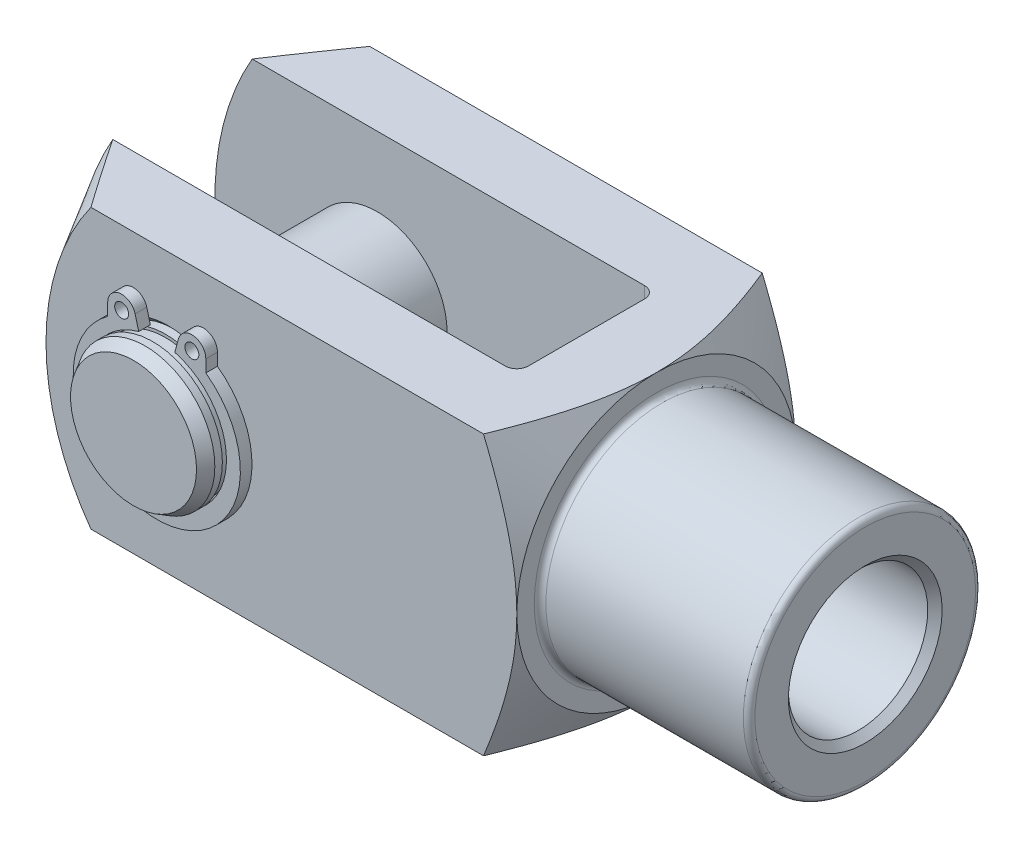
ISO-10303-21;
HEADER;
FILE_DESCRIPTION(('STEP AP214'),'2;1');
FILE_NAME('part.step','',(''),(''),'','','');
FILE_SCHEMA(('AUTOMOTIVE_DESIGN { 1 0 10303 214 1 1 1 1 }'));
ENDSEC;
DATA;
#1=APPLICATION_CONTEXT('core data for automotive mechanical design processes');
#2=APPLICATION_PROTOCOL_DEFINITION('international standard','automotive_design',2000,#1);
#3=PRODUCT_CONTEXT('',#1,'mechanical');
#4=PRODUCT('Part','Part','',(#3));
#5=PRODUCT_RELATED_PRODUCT_CATEGORY('part','',(#4));
#6=PRODUCT_DEFINITION_FORMATION('','',#4);
#7=PRODUCT_DEFINITION_CONTEXT('part definition',#1,'design');
#8=PRODUCT_DEFINITION('design','',#6,#7);
#9=PRODUCT_DEFINITION_SHAPE('','',#8);
#10=(LENGTH_UNIT() NAMED_UNIT(*) SI_UNIT(.MILLI.,.METRE.));
#11=(NAMED_UNIT(*) PLANE_ANGLE_UNIT() SI_UNIT($,.RADIAN.));
#12=(NAMED_UNIT(*) SI_UNIT($,.STERADIAN.) SOLID_ANGLE_UNIT());
#13=UNCERTAINTY_MEASURE_WITH_UNIT(LENGTH_MEASURE(1.E-05),#10,'distance_accuracy_value','');
#14=(GEOMETRIC_REPRESENTATION_CONTEXT(3) GLOBAL_UNCERTAINTY_ASSIGNED_CONTEXT((#13)) GLOBAL_UNIT_ASSIGNED_CONTEXT((#10,
#11,#12)) REPRESENTATION_CONTEXT('',''));
#15=CARTESIAN_POINT('',(0.,0.,0.));
#16=DIRECTION('',(0.,0.,1.));
#17=DIRECTION('',(1.,0.,0.));
#18=AXIS2_PLACEMENT_3D('',#15,#16,#17);
#19=CARTESIAN_POINT('',(-48.,0.,15.));
#20=DIRECTION('',(0.,0.,-1.));
#21=DIRECTION('',(-1.,0.,0.));
#22=AXIS2_PLACEMENT_3D('',#19,#20,#21);
#23=CYLINDRICAL_SURFACE('',#22,6.);
#24=CARTESIAN_POINT('',(-48.,0.,12.25));
#25=DIRECTION('',(0.,0.,1.));
#26=DIRECTION('',(1.,0.,0.));
#27=AXIS2_PLACEMENT_3D('',#24,#25,#26);
#28=CIRCLE('',#27,6.);
#29=CARTESIAN_POINT('',(-42.,0.,12.25));
#30=VERTEX_POINT('',#29);
#31=EDGE_CURVE('P0_E55',#30,#30,#28,.T.);
#32=ORIENTED_EDGE('',*,*,#31,.F.);
#33=EDGE_LOOP('',(#32));
#34=FACE_BOUND('',#33,.T.);
#35=CARTESIAN_POINT('',(-48.,0.,-12.25));
#36=DIRECTION('',(0.,0.,1.));
#37=DIRECTION('',(1.,0.,0.));
#38=AXIS2_PLACEMENT_3D('',#35,#36,#37);
#39=CIRCLE('',#38,6.);
#40=CARTESIAN_POINT('',(-42.,0.,-12.25));
#41=VERTEX_POINT('',#40);
#42=EDGE_CURVE('P0_E40',#41,#41,#39,.T.);
#43=ORIENTED_EDGE('',*,*,#42,.T.);
#44=EDGE_LOOP('',(#43));
#45=FACE_BOUND('',#44,.T.);
#46=ADVANCED_FACE('P0_F14',(#34,#45),#23,.T.);
#47=CARTESIAN_POINT('',(-48.,0.,-13.35));
#48=DIRECTION('',(0.,0.,1.));
#49=DIRECTION('',(1.,0.,0.));
#50=AXIS2_PLACEMENT_3D('',#47,#48,#49);
#51=CIRCLE('',#50,6.);
#52=CARTESIAN_POINT('',(-42.,0.,-13.35));
#53=VERTEX_POINT('',#52);
#54=EDGE_CURVE('P0_E43',#53,#53,#51,.T.);
#55=ORIENTED_EDGE('',*,*,#54,.F.);
#56=EDGE_LOOP('',(#55));
#57=FACE_BOUND('',#56,.T.);
#58=CARTESIAN_POINT('',(-48.,0.,-14.));
#59=DIRECTION('',(0.,0.,1.));
#60=DIRECTION('',(1.,0.,0.));
#61=AXIS2_PLACEMENT_3D('',#58,#59,#60);
#62=CIRCLE('',#61,6.);
#63=CARTESIAN_POINT('',(-42.,0.,-14.));
#64=VERTEX_POINT('',#63);
#65=EDGE_CURVE('P0_E25',#64,#64,#62,.T.);
#66=ORIENTED_EDGE('',*,*,#65,.T.);
#67=EDGE_LOOP('',(#66));
#68=FACE_BOUND('',#67,.T.);
#69=ADVANCED_FACE('P0_F63',(#57,#68),#23,.T.);
#70=CARTESIAN_POINT('',(-48.,0.,-15.));
#71=DIRECTION('',(0.,0.,1.));
#72=DIRECTION('',(1.,0.,0.));
#73=AXIS2_PLACEMENT_3D('',#70,#71,#72);
#74=PLANE('',#73);
#75=CARTESIAN_POINT('',(-48.,0.,-15.));
#76=DIRECTION('',(0.,0.,1.));
#77=DIRECTION('',(1.,0.,0.));
#78=AXIS2_PLACEMENT_3D('',#75,#76,#77);
#79=CIRCLE('',#78,5.42264973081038);
#80=CARTESIAN_POINT('',(-42.5773502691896,0.,-15.));
#81=VERTEX_POINT('',#80);
#82=EDGE_CURVE('P0_E21',#81,#81,#79,.F.);
#83=ORIENTED_EDGE('',*,*,#82,.T.);
#84=EDGE_LOOP('',(#83));
#85=FACE_BOUND('',#84,.T.);
#86=ADVANCED_FACE('P0_F89',(#85),#74,.F.);
#87=CARTESIAN_POINT('',(-48.,0.,-14.));
#88=DIRECTION('',(0.,0.,1.));
#89=DIRECTION('',(1.,0.,0.));
#90=AXIS2_PLACEMENT_3D('',#87,#88,#89);
#91=CONICAL_SURFACE('',#90,6.,0.523598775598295);
#92=ORIENTED_EDGE('',*,*,#82,.F.);
#93=EDGE_LOOP('',(#92));
#94=FACE_BOUND('',#93,.T.);
#95=ORIENTED_EDGE('',*,*,#65,.F.);
#96=EDGE_LOOP('',(#95));
#97=FACE_BOUND('',#96,.T.);
#98=ADVANCED_FACE('P0_F83',(#94,#97),#91,.T.);
#99=CARTESIAN_POINT('',(-48.,6.,-13.35));
#100=DIRECTION('',(0.,0.,-1.));
#101=DIRECTION('',(-1.,0.,0.));
#102=AXIS2_PLACEMENT_3D('',#99,#100,#101);
#103=PLANE('',#102);
#104=CARTESIAN_POINT('',(-48.,0.,-13.35));
#105=DIRECTION('',(0.,0.,1.));
#106=DIRECTION('',(1.,0.,0.));
#107=AXIS2_PLACEMENT_3D('',#104,#105,#106);
#108=CIRCLE('',#107,5.75);
#109=CARTESIAN_POINT('',(-42.25,0.,-13.35));
#110=VERTEX_POINT('',#109);
#111=EDGE_CURVE('P0_E34',#110,#110,#108,.T.);
#112=ORIENTED_EDGE('',*,*,#111,.F.);
#113=EDGE_LOOP('',(#112));
#114=FACE_BOUND('',#113,.T.);
#115=ORIENTED_EDGE('',*,*,#54,.T.);
#116=EDGE_LOOP('',(#115));
#117=FACE_BOUND('',#116,.T.);
#118=ADVANCED_FACE('P0_F77',(#114,#117),#103,.F.);
#119=CARTESIAN_POINT('',(-48.,0.,14.));
#120=DIRECTION('',(0.,0.,1.));
#121=DIRECTION('',(1.,0.,0.));
#122=AXIS2_PLACEMENT_3D('',#119,#120,#121);
#123=CYLINDRICAL_SURFACE('',#122,5.75);
#124=CARTESIAN_POINT('',(-48.,0.,-12.25));
#125=DIRECTION('',(0.,0.,1.));
#126=DIRECTION('',(1.,0.,0.));
#127=AXIS2_PLACEMENT_3D('',#124,#125,#126);
#128=CIRCLE('',#127,5.75);
#129=CARTESIAN_POINT('',(-42.25,0.,-12.25));
#130=VERTEX_POINT('',#129);
#131=EDGE_CURVE('P0_E37',#130,#130,#128,.T.);
#132=ORIENTED_EDGE('',*,*,#131,.F.);
#133=EDGE_LOOP('',(#132));
#134=FACE_BOUND('',#133,.T.);
#135=ORIENTED_EDGE('',*,*,#111,.T.);
#136=EDGE_LOOP('',(#135));
#137=FACE_BOUND('',#136,.T.);
#138=ADVANCED_FACE('P0_F71',(#134,#137),#123,.T.);
#139=CARTESIAN_POINT('',(-48.,6.,-12.25));
#140=DIRECTION('',(0.,0.,1.));
#141=DIRECTION('',(1.,0.,0.));
#142=AXIS2_PLACEMENT_3D('',#139,#140,#141);
#143=PLANE('',#142);
#144=ORIENTED_EDGE('',*,*,#42,.F.);
#145=EDGE_LOOP('',(#144));
#146=FACE_BOUND('',#145,.T.);
#147=ORIENTED_EDGE('',*,*,#131,.T.);
#148=EDGE_LOOP('',(#147));
#149=FACE_BOUND('',#148,.T.);
#150=ADVANCED_FACE('P0_F68',(#146,#149),#143,.F.);
#151=CARTESIAN_POINT('',(-48.,6.,12.25));
#152=DIRECTION('',(0.,0.,-1.));
#153=DIRECTION('',(-1.,0.,0.));
#154=AXIS2_PLACEMENT_3D('',#151,#152,#153);
#155=PLANE('',#154);
#156=CARTESIAN_POINT('',(-48.,0.,12.25));
#157=DIRECTION('',(0.,0.,1.));
#158=DIRECTION('',(1.,0.,0.));
#159=AXIS2_PLACEMENT_3D('',#156,#157,#158);
#160=CIRCLE('',#159,5.75);
#161=CARTESIAN_POINT('',(-42.25,0.,12.25));
#162=VERTEX_POINT('',#161);
#163=EDGE_CURVE('P0_E46',#162,#162,#160,.T.);
#164=ORIENTED_EDGE('',*,*,#163,.F.);
#165=EDGE_LOOP('',(#164));
#166=FACE_BOUND('',#165,.T.);
#167=ORIENTED_EDGE('',*,*,#31,.T.);
#168=EDGE_LOOP('',(#167));
#169=FACE_BOUND('',#168,.T.);
#170=ADVANCED_FACE('P0_F59',(#166,#169),#155,.F.);
#171=CARTESIAN_POINT('',(-48.,0.,14.));
#172=DIRECTION('',(0.,0.,1.));
#173=DIRECTION('',(1.,0.,0.));
#174=AXIS2_PLACEMENT_3D('',#171,#172,#173);
#175=CYLINDRICAL_SURFACE('',#174,5.75);
#176=CARTESIAN_POINT('',(-48.,0.,13.35));
#177=DIRECTION('',(0.,0.,1.));
#178=DIRECTION('',(1.,0.,0.));
#179=AXIS2_PLACEMENT_3D('',#176,#177,#178);
#180=CIRCLE('',#179,5.75);
#181=CARTESIAN_POINT('',(-42.25,0.,13.35));
#182=VERTEX_POINT('',#181);
#183=EDGE_CURVE('P0_E49',#182,#182,#180,.T.);
#184=ORIENTED_EDGE('',*,*,#183,.F.);
#185=EDGE_LOOP('',(#184));
#186=FACE_BOUND('',#185,.T.);
#187=ORIENTED_EDGE('',*,*,#163,.T.);
#188=EDGE_LOOP('',(#187));
#189=FACE_BOUND('',#188,.T.);
#190=ADVANCED_FACE('P0_F108',(#186,#189),#175,.T.);
#191=CARTESIAN_POINT('',(-48.,6.,13.35));
#192=DIRECTION('',(0.,0.,1.));
#193=DIRECTION('',(1.,0.,0.));
#194=AXIS2_PLACEMENT_3D('',#191,#192,#193);
#195=PLANE('',#194);
#196=CARTESIAN_POINT('',(-48.,0.,13.35));
#197=DIRECTION('',(0.,0.,1.));
#198=DIRECTION('',(1.,0.,0.));
#199=AXIS2_PLACEMENT_3D('',#196,#197,#198);
#200=CIRCLE('',#199,6.);
#201=CARTESIAN_POINT('',(-42.,0.,13.35));
#202=VERTEX_POINT('',#201);
#203=EDGE_CURVE('P0_E52',#202,#202,#200,.T.);
#204=ORIENTED_EDGE('',*,*,#203,.F.);
#205=EDGE_LOOP('',(#204));
#206=FACE_BOUND('',#205,.T.);
#207=ORIENTED_EDGE('',*,*,#183,.T.);
#208=EDGE_LOOP('',(#207));
#209=FACE_BOUND('',#208,.T.);
#210=ADVANCED_FACE('P0_F104',(#206,#209),#195,.F.);
#211=CARTESIAN_POINT('',(-48.,0.,15.));
#212=DIRECTION('',(0.,0.,1.));
#213=DIRECTION('',(1.,0.,0.));
#214=AXIS2_PLACEMENT_3D('',#211,#212,#213);
#215=PLANE('',#214);
#216=CARTESIAN_POINT('',(-48.,0.,15.));
#217=DIRECTION('',(0.,0.,1.));
#218=DIRECTION('',(1.,0.,0.));
#219=AXIS2_PLACEMENT_3D('',#216,#217,#218);
#220=CIRCLE('',#219,5.42264973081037);
#221=CARTESIAN_POINT('',(-42.5773502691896,0.,15.));
#222=VERTEX_POINT('',#221);
#223=EDGE_CURVE('P0_E10',#222,#222,#220,.T.);
#224=ORIENTED_EDGE('',*,*,#223,.T.);
#225=EDGE_LOOP('',(#224));
#226=FACE_BOUND('',#225,.T.);
#227=ADVANCED_FACE('P0_F102',(#226),#215,.T.);
#228=CARTESIAN_POINT('',(-48.,0.,15.));
#229=DIRECTION('',(0.,0.,-1.));
#230=DIRECTION('',(-1.,0.,0.));
#231=AXIS2_PLACEMENT_3D('',#228,#229,#230);
#232=CONICAL_SURFACE('',#231,5.42264973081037,0.523598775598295);
#233=CARTESIAN_POINT('',(-48.,0.,14.));
#234=DIRECTION('',(0.,0.,1.));
#235=DIRECTION('',(1.,0.,0.));
#236=AXIS2_PLACEMENT_3D('',#233,#234,#235);
#237=CIRCLE('',#236,6.);
#238=CARTESIAN_POINT('',(-42.,0.,14.));
#239=VERTEX_POINT('',#238);
#240=EDGE_CURVE('P0_E29',#239,#239,#237,.F.);
#241=ORIENTED_EDGE('',*,*,#240,.F.);
#242=EDGE_LOOP('',(#241));
#243=FACE_BOUND('',#242,.T.);
#244=ORIENTED_EDGE('',*,*,#223,.F.);
#245=EDGE_LOOP('',(#244));
#246=FACE_BOUND('',#245,.T.);
#247=ADVANCED_FACE('P0_F16',(#243,#246),#232,.T.);
#248=ORIENTED_EDGE('',*,*,#203,.T.);
#249=EDGE_LOOP('',(#248));
#250=FACE_BOUND('',#249,.T.);
#251=ORIENTED_EDGE('',*,*,#240,.T.);
#252=EDGE_LOOP('',(#251));
#253=FACE_BOUND('',#252,.T.);
#254=ADVANCED_FACE('P0_F65',(#250,#253),#23,.T.);
#255=CLOSED_SHELL('',(#46,#69,#86,#98,#118,#138,#150,#170,#190,#210,#227,#247,#254));
#256=MANIFOLD_SOLID_BREP('P0_B1',#255);
#257=CARTESIAN_POINT('',(-48.,0.,12.9999999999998));
#258=DIRECTION('',(0.,0.,1.));
#259=DIRECTION('',(1.,0.,0.));
#260=AXIS2_PLACEMENT_3D('',#257,#258,#259);
#261=PLANE('',#260);
#262=CARTESIAN_POINT('',(-51.0226081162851,6.64408309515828,12.9999999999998));
#263=DIRECTION('',(0.,0.,1.));
#264=DIRECTION('',(1.,0.,0.));
#265=AXIS2_PLACEMENT_3D('',#262,#263,#264);
#266=CIRCLE('',#265,0.6);
#267=CARTESIAN_POINT('',(-50.4226081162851,6.64408309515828,12.9999999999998));
#268=VERTEX_POINT('',#267);
#269=EDGE_CURVE('P1_E117',#268,#268,#266,.T.);
#270=ORIENTED_EDGE('',*,*,#269,.F.);
#271=EDGE_LOOP('',(#270));
#272=FACE_BOUND('',#271,.T.);
#273=CARTESIAN_POINT('',(-48.,0.,12.9999999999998));
#274=DIRECTION('',(0.,0.,-1.));
#275=DIRECTION('',(1.,0.,0.));
#276=AXIS2_PLACEMENT_3D('',#273,#274,#275);
#277=CIRCLE('',#276,6.);
#278=CARTESIAN_POINT('',(-46.4470857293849,5.79555495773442,12.9999999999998));
#279=VERTEX_POINT('',#278);
#280=CARTESIAN_POINT('',(-49.5529142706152,5.79555495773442,12.9999999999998));
#281=VERTEX_POINT('',#280);
#282=EDGE_CURVE('P1_E128',#279,#281,#277,.T.);
#283=ORIENTED_EDGE('',*,*,#282,.T.);
#284=DIRECTION('',(-0.258819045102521,0.965925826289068,0.));
#285=VECTOR('',#284,1.);
#286=CARTESIAN_POINT('',(-49.5529142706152,5.79555495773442,12.9999999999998));
#287=LINE('',#286,#285);
#288=CARTESIAN_POINT('',(-49.8634971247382,6.9546659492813,12.9999999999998));
#289=VERTEX_POINT('',#288);
#290=EDGE_CURVE('P1_E76',#281,#289,#287,.T.);
#291=ORIENTED_EDGE('',*,*,#290,.T.);
#292=CARTESIAN_POINT('',(-51.0226081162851,6.64408309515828,12.9999999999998));
#293=DIRECTION('',(0.,0.,1.));
#294=DIRECTION('',(1.,0.,0.));
#295=AXIS2_PLACEMENT_3D('',#292,#293,#294);
#296=CIRCLE('',#295,1.2);
#297=CARTESIAN_POINT('',(-52.2226081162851,6.64408309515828,12.9999999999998));
#298=VERTEX_POINT('',#297);
#299=EDGE_CURVE('P1_E143',#289,#298,#296,.T.);
#300=ORIENTED_EDGE('',*,*,#299,.T.);
#301=DIRECTION('',(0.,-1.,0.));
#302=VECTOR('',#301,1.);
#303=CARTESIAN_POINT('',(-52.2226081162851,6.64408309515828,12.9999999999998));
#304=LINE('',#303,#302);
#305=CARTESIAN_POINT('',(-52.2226081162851,5.59177337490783,12.9999999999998));
#306=VERTEX_POINT('',#305);
#307=EDGE_CURVE('P1_E156',#298,#306,#304,.T.);
#308=ORIENTED_EDGE('',*,*,#307,.T.);
#309=CARTESIAN_POINT('',(-48.,-0.239999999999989,12.9999999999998));
#310=DIRECTION('',(0.,0.,1.));
#311=DIRECTION('',(1.,0.,0.));
#312=AXIS2_PLACEMENT_3D('',#309,#310,#311);
#313=CIRCLE('',#312,7.2);
#314=CARTESIAN_POINT('',(-43.777391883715,5.59177337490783,12.9999999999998));
#315=VERTEX_POINT('',#314);
#316=EDGE_CURVE('P1_E95',#306,#315,#313,.T.);
#317=ORIENTED_EDGE('',*,*,#316,.T.);
#318=DIRECTION('',(0.,1.,0.));
#319=VECTOR('',#318,1.);
#320=CARTESIAN_POINT('',(-43.777391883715,6.64408309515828,12.9999999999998));
#321=LINE('',#320,#319);
#322=CARTESIAN_POINT('',(-43.777391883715,6.64408309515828,12.9999999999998));
#323=VERTEX_POINT('',#322);
#324=EDGE_CURVE('P1_E89',#315,#323,#321,.T.);
#325=ORIENTED_EDGE('',*,*,#324,.T.);
#326=CARTESIAN_POINT('',(-44.977391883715,6.64408309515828,12.9999999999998));
#327=DIRECTION('',(0.,0.,1.));
#328=DIRECTION('',(-1.,0.,0.));
#329=AXIS2_PLACEMENT_3D('',#326,#327,#328);
#330=CIRCLE('',#329,1.2);
#331=CARTESIAN_POINT('',(-46.1365028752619,6.9546659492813,12.9999999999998));
#332=VERTEX_POINT('',#331);
#333=EDGE_CURVE('P1_E93',#323,#332,#330,.T.);
#334=ORIENTED_EDGE('',*,*,#333,.T.);
#335=DIRECTION('',(-0.258819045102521,-0.965925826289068,0.));
#336=VECTOR('',#335,1.);
#337=CARTESIAN_POINT('',(-46.4470857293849,5.79555495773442,12.9999999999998));
#338=LINE('',#337,#336);
#339=EDGE_CURVE('P1_E33',#332,#279,#338,.T.);
#340=ORIENTED_EDGE('',*,*,#339,.T.);
#341=EDGE_LOOP('',(#283,#291,#300,#308,#317,#325,#334,#340));
#342=FACE_BOUND('',#341,.T.);
#343=CARTESIAN_POINT('',(-44.977391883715,6.64408309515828,12.9999999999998));
#344=DIRECTION('',(0.,0.,1.));
#345=DIRECTION('',(-1.,0.,0.));
#346=AXIS2_PLACEMENT_3D('',#343,#344,#345);
#347=CIRCLE('',#346,0.6);
#348=CARTESIAN_POINT('',(-45.577391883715,6.64408309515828,12.9999999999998));
#349=VERTEX_POINT('',#348);
#350=EDGE_CURVE('P1_E165',#349,#349,#347,.T.);
#351=ORIENTED_EDGE('',*,*,#350,.F.);
#352=EDGE_LOOP('',(#351));
#353=FACE_BOUND('',#352,.T.);
#354=ADVANCED_FACE('P1_F16',(#272,#342,#353),#261,.T.);
#355=CARTESIAN_POINT('',(-48.,0.,11.9999999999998));
#356=DIRECTION('',(0.,0.,1.));
#357=DIRECTION('',(1.,0.,0.));
#358=AXIS2_PLACEMENT_3D('',#355,#356,#357);
#359=PLANE('',#358);
#360=CARTESIAN_POINT('',(-51.0226081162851,6.64408309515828,11.9999999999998));
#361=DIRECTION('',(0.,0.,1.));
#362=DIRECTION('',(1.,0.,0.));
#363=AXIS2_PLACEMENT_3D('',#360,#361,#362);
#364=CIRCLE('',#363,0.6);
#365=CARTESIAN_POINT('',(-50.4226081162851,6.64408309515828,11.9999999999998));
#366=VERTEX_POINT('',#365);
#367=EDGE_CURVE('P1_E162',#366,#366,#364,.T.);
#368=ORIENTED_EDGE('',*,*,#367,.T.);
#369=EDGE_LOOP('',(#368));
#370=FACE_BOUND('',#369,.T.);
#371=CARTESIAN_POINT('',(-48.,0.,11.9999999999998));
#372=DIRECTION('',(0.,0.,-1.));
#373=DIRECTION('',(1.,0.,0.));
#374=AXIS2_PLACEMENT_3D('',#371,#372,#373);
#375=CIRCLE('',#374,6.);
#376=CARTESIAN_POINT('',(-46.4470857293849,5.79555495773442,11.9999999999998));
#377=VERTEX_POINT('',#376);
#378=CARTESIAN_POINT('',(-49.5529142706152,5.79555495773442,11.9999999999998));
#379=VERTEX_POINT('',#378);
#380=EDGE_CURVE('P1_E113',#377,#379,#375,.T.);
#381=ORIENTED_EDGE('',*,*,#380,.F.);
#382=DIRECTION('',(-0.258819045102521,-0.965925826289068,0.));
#383=VECTOR('',#382,1.);
#384=CARTESIAN_POINT('',(-46.4470857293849,5.79555495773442,11.9999999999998));
#385=LINE('',#384,#383);
#386=CARTESIAN_POINT('',(-46.1365028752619,6.9546659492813,11.9999999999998));
#387=VERTEX_POINT('',#386);
#388=EDGE_CURVE('P1_E68',#387,#377,#385,.T.);
#389=ORIENTED_EDGE('',*,*,#388,.F.);
#390=CARTESIAN_POINT('',(-44.977391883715,6.64408309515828,11.9999999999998));
#391=DIRECTION('',(0.,0.,1.));
#392=DIRECTION('',(-1.,0.,0.));
#393=AXIS2_PLACEMENT_3D('',#390,#391,#392);
#394=CIRCLE('',#393,1.2);
#395=CARTESIAN_POINT('',(-43.777391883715,6.64408309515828,11.9999999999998));
#396=VERTEX_POINT('',#395);
#397=EDGE_CURVE('P1_E62',#396,#387,#394,.T.);
#398=ORIENTED_EDGE('',*,*,#397,.F.);
#399=DIRECTION('',(0.,1.,0.));
#400=VECTOR('',#399,1.);
#401=CARTESIAN_POINT('',(-43.777391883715,6.64408309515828,11.9999999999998));
#402=LINE('',#401,#400);
#403=CARTESIAN_POINT('',(-43.777391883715,5.59177337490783,11.9999999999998));
#404=VERTEX_POINT('',#403);
#405=EDGE_CURVE('P1_E103',#404,#396,#402,.T.);
#406=ORIENTED_EDGE('',*,*,#405,.F.);
#407=CARTESIAN_POINT('',(-48.,-0.239999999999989,11.9999999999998));
#408=DIRECTION('',(0.,0.,1.));
#409=DIRECTION('',(1.,0.,0.));
#410=AXIS2_PLACEMENT_3D('',#407,#408,#409);
#411=CIRCLE('',#410,7.2);
#412=CARTESIAN_POINT('',(-52.2226081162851,5.59177337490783,11.9999999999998));
#413=VERTEX_POINT('',#412);
#414=EDGE_CURVE('P1_E123',#413,#404,#411,.T.);
#415=ORIENTED_EDGE('',*,*,#414,.F.);
#416=DIRECTION('',(0.,-1.,0.));
#417=VECTOR('',#416,1.);
#418=CARTESIAN_POINT('',(-52.2226081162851,6.64408309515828,11.9999999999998));
#419=LINE('',#418,#417);
#420=CARTESIAN_POINT('',(-52.2226081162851,6.64408309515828,11.9999999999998));
#421=VERTEX_POINT('',#420);
#422=EDGE_CURVE('P1_E121',#421,#413,#419,.T.);
#423=ORIENTED_EDGE('',*,*,#422,.F.);
#424=CARTESIAN_POINT('',(-51.0226081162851,6.64408309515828,11.9999999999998));
#425=DIRECTION('',(0.,0.,1.));
#426=DIRECTION('',(1.,0.,0.));
#427=AXIS2_PLACEMENT_3D('',#424,#425,#426);
#428=CIRCLE('',#427,1.2);
#429=CARTESIAN_POINT('',(-49.8634971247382,6.9546659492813,11.9999999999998));
#430=VERTEX_POINT('',#429);
#431=EDGE_CURVE('P1_E119',#430,#421,#428,.T.);
#432=ORIENTED_EDGE('',*,*,#431,.F.);
#433=DIRECTION('',(-0.258819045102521,0.965925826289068,0.));
#434=VECTOR('',#433,1.);
#435=CARTESIAN_POINT('',(-49.5529142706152,5.79555495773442,11.9999999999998));
#436=LINE('',#435,#434);
#437=EDGE_CURVE('P1_E116',#379,#430,#436,.T.);
#438=ORIENTED_EDGE('',*,*,#437,.F.);
#439=EDGE_LOOP('',(#381,#389,#398,#406,#415,#423,#432,#438));
#440=FACE_BOUND('',#439,.T.);
#441=CARTESIAN_POINT('',(-44.977391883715,6.64408309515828,11.9999999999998));
#442=DIRECTION('',(0.,0.,1.));
#443=DIRECTION('',(-1.,0.,0.));
#444=AXIS2_PLACEMENT_3D('',#441,#442,#443);
#445=CIRCLE('',#444,0.6);
#446=CARTESIAN_POINT('',(-45.577391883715,6.64408309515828,11.9999999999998));
#447=VERTEX_POINT('',#446);
#448=EDGE_CURVE('P1_E168',#447,#447,#445,.T.);
#449=ORIENTED_EDGE('',*,*,#448,.T.);
#450=EDGE_LOOP('',(#449));
#451=FACE_BOUND('',#450,.T.);
#452=ADVANCED_FACE('P1_F147',(#370,#440,#451),#359,.F.);
#453=CARTESIAN_POINT('',(-48.,0.,12.9999999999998));
#454=DIRECTION('',(0.,0.,-1.));
#455=DIRECTION('',(-1.,0.,0.));
#456=AXIS2_PLACEMENT_3D('',#453,#454,#455);
#457=CYLINDRICAL_SURFACE('',#456,6.);
#458=ORIENTED_EDGE('',*,*,#380,.T.);
#459=DIRECTION('',(0.,0.,-1.));
#460=VECTOR('',#459,1.);
#461=CARTESIAN_POINT('',(-49.5529142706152,5.79555495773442,12.9999999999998));
#462=LINE('',#461,#460);
#463=EDGE_CURVE('P1_E11',#281,#379,#462,.T.);
#464=ORIENTED_EDGE('',*,*,#463,.F.);
#465=ORIENTED_EDGE('',*,*,#282,.F.);
#466=DIRECTION('',(0.,0.,-1.));
#467=VECTOR('',#466,1.);
#468=CARTESIAN_POINT('',(-46.4470857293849,5.79555495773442,12.9999999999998));
#469=LINE('',#468,#467);
#470=EDGE_CURVE('P1_E109',#279,#377,#469,.T.);
#471=ORIENTED_EDGE('',*,*,#470,.T.);
#472=EDGE_LOOP('',(#458,#464,#465,#471));
#473=FACE_BOUND('',#472,.T.);
#474=ADVANCED_FACE('P1_F18',(#473),#457,.F.);
#475=CARTESIAN_POINT('',(-49.5529142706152,5.79555495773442,12.9999999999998));
#476=DIRECTION('',(-0.965925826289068,-0.258819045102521,0.));
#477=DIRECTION('',(0.258819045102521,-0.965925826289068,0.));
#478=AXIS2_PLACEMENT_3D('',#475,#476,#477);
#479=PLANE('',#478);
#480=ORIENTED_EDGE('',*,*,#437,.T.);
#481=DIRECTION('',(0.,0.,-1.));
#482=VECTOR('',#481,1.);
#483=CARTESIAN_POINT('',(-49.8634971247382,6.9546659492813,12.9999999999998));
#484=LINE('',#483,#482);
#485=EDGE_CURVE('P1_E25',#289,#430,#484,.T.);
#486=ORIENTED_EDGE('',*,*,#485,.F.);
#487=ORIENTED_EDGE('',*,*,#290,.F.);
#488=ORIENTED_EDGE('',*,*,#463,.T.);
#489=EDGE_LOOP('',(#480,#486,#487,#488));
#490=FACE_BOUND('',#489,.T.);
#491=ADVANCED_FACE('P1_F202',(#490),#479,.F.);
#492=CARTESIAN_POINT('',(-51.0226081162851,6.64408309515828,12.9999999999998));
#493=DIRECTION('',(0.,0.,-1.));
#494=DIRECTION('',(-1.,0.,0.));
#495=AXIS2_PLACEMENT_3D('',#492,#493,#494);
#496=CYLINDRICAL_SURFACE('',#495,1.2);
#497=ORIENTED_EDGE('',*,*,#431,.T.);
#498=DIRECTION('',(0.,0.,-1.));
#499=VECTOR('',#498,1.);
#500=CARTESIAN_POINT('',(-52.2226081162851,6.64408309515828,12.9999999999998));
#501=LINE('',#500,#499);
#502=EDGE_CURVE('P1_E135',#298,#421,#501,.T.);
#503=ORIENTED_EDGE('',*,*,#502,.F.);
#504=ORIENTED_EDGE('',*,*,#299,.F.);
#505=ORIENTED_EDGE('',*,*,#485,.T.);
#506=EDGE_LOOP('',(#497,#503,#504,#505));
#507=FACE_BOUND('',#506,.T.);
#508=ADVANCED_FACE('P1_F141',(#507),#496,.T.);
#509=CARTESIAN_POINT('',(-52.2226081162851,6.64408309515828,12.9999999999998));
#510=DIRECTION('',(1.,0.,0.));
#511=DIRECTION('',(0.,1.,0.));
#512=AXIS2_PLACEMENT_3D('',#509,#510,#511);
#513=PLANE('',#512);
#514=ORIENTED_EDGE('',*,*,#422,.T.);
#515=DIRECTION('',(0.,0.,-1.));
#516=VECTOR('',#515,1.);
#517=CARTESIAN_POINT('',(-52.2226081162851,5.59177337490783,12.9999999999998));
#518=LINE('',#517,#516);
#519=EDGE_CURVE('P1_E132',#306,#413,#518,.T.);
#520=ORIENTED_EDGE('',*,*,#519,.F.);
#521=ORIENTED_EDGE('',*,*,#307,.F.);
#522=ORIENTED_EDGE('',*,*,#502,.T.);
#523=EDGE_LOOP('',(#514,#520,#521,#522));
#524=FACE_BOUND('',#523,.T.);
#525=ADVANCED_FACE('P1_F152',(#524),#513,.F.);
#526=CARTESIAN_POINT('',(-48.,-0.239999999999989,12.9999999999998));
#527=DIRECTION('',(0.,0.,-1.));
#528=DIRECTION('',(-1.,0.,0.));
#529=AXIS2_PLACEMENT_3D('',#526,#527,#528);
#530=CYLINDRICAL_SURFACE('',#529,7.2);
#531=ORIENTED_EDGE('',*,*,#414,.T.);
#532=DIRECTION('',(0.,0.,-1.));
#533=VECTOR('',#532,1.);
#534=CARTESIAN_POINT('',(-43.777391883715,5.59177337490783,12.9999999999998));
#535=LINE('',#534,#533);
#536=EDGE_CURVE('P1_E104',#315,#404,#535,.T.);
#537=ORIENTED_EDGE('',*,*,#536,.F.);
#538=ORIENTED_EDGE('',*,*,#316,.F.);
#539=ORIENTED_EDGE('',*,*,#519,.T.);
#540=EDGE_LOOP('',(#531,#537,#538,#539));
#541=FACE_BOUND('',#540,.T.);
#542=ADVANCED_FACE('P1_F155',(#541),#530,.T.);
#543=CARTESIAN_POINT('',(-43.777391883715,6.64408309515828,12.9999999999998));
#544=DIRECTION('',(-1.,0.,0.));
#545=DIRECTION('',(0.,-1.,0.));
#546=AXIS2_PLACEMENT_3D('',#543,#544,#545);
#547=PLANE('',#546);
#548=ORIENTED_EDGE('',*,*,#405,.T.);
#549=DIRECTION('',(0.,0.,-1.));
#550=VECTOR('',#549,1.);
#551=CARTESIAN_POINT('',(-43.777391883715,6.64408309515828,12.9999999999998));
#552=LINE('',#551,#550);
#553=EDGE_CURVE('P1_E100',#323,#396,#552,.T.);
#554=ORIENTED_EDGE('',*,*,#553,.F.);
#555=ORIENTED_EDGE('',*,*,#324,.F.);
#556=ORIENTED_EDGE('',*,*,#536,.T.);
#557=EDGE_LOOP('',(#548,#554,#555,#556));
#558=FACE_BOUND('',#557,.T.);
#559=ADVANCED_FACE('P1_F101',(#558),#547,.F.);
#560=CARTESIAN_POINT('',(-44.977391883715,6.64408309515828,12.9999999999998));
#561=DIRECTION('',(0.,0.,-1.));
#562=DIRECTION('',(-1.,0.,0.));
#563=AXIS2_PLACEMENT_3D('',#560,#561,#562);
#564=CYLINDRICAL_SURFACE('',#563,1.2);
#565=ORIENTED_EDGE('',*,*,#397,.T.);
#566=DIRECTION('',(0.,0.,-1.));
#567=VECTOR('',#566,1.);
#568=CARTESIAN_POINT('',(-46.1365028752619,6.9546659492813,12.9999999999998));
#569=LINE('',#568,#567);
#570=EDGE_CURVE('P1_E105',#332,#387,#569,.T.);
#571=ORIENTED_EDGE('',*,*,#570,.F.);
#572=ORIENTED_EDGE('',*,*,#333,.F.);
#573=ORIENTED_EDGE('',*,*,#553,.T.);
#574=EDGE_LOOP('',(#565,#571,#572,#573));
#575=FACE_BOUND('',#574,.T.);
#576=ADVANCED_FACE('P1_F107',(#575),#564,.T.);
#577=CARTESIAN_POINT('',(-46.4470857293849,5.79555495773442,12.9999999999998));
#578=DIRECTION('',(0.965925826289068,-0.258819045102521,0.));
#579=DIRECTION('',(0.258819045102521,0.965925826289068,0.));
#580=AXIS2_PLACEMENT_3D('',#577,#578,#579);
#581=PLANE('',#580);
#582=ORIENTED_EDGE('',*,*,#388,.T.);
#583=ORIENTED_EDGE('',*,*,#470,.F.);
#584=ORIENTED_EDGE('',*,*,#339,.F.);
#585=ORIENTED_EDGE('',*,*,#570,.T.);
#586=EDGE_LOOP('',(#582,#583,#584,#585));
#587=FACE_BOUND('',#586,.T.);
#588=ADVANCED_FACE('P1_F190',(#587),#581,.F.);
#589=CARTESIAN_POINT('',(-51.0226081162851,6.64408309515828,12.9999999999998));
#590=DIRECTION('',(0.,0.,-1.));
#591=DIRECTION('',(-1.,0.,0.));
#592=AXIS2_PLACEMENT_3D('',#589,#590,#591);
#593=CYLINDRICAL_SURFACE('',#592,0.6);
#594=ORIENTED_EDGE('',*,*,#269,.T.);
#595=EDGE_LOOP('',(#594));
#596=FACE_BOUND('',#595,.T.);
#597=ORIENTED_EDGE('',*,*,#367,.F.);
#598=EDGE_LOOP('',(#597));
#599=FACE_BOUND('',#598,.T.);
#600=ADVANCED_FACE('P1_F187',(#596,#599),#593,.F.);
#601=CARTESIAN_POINT('',(-44.977391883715,6.64408309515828,12.9999999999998));
#602=DIRECTION('',(0.,0.,-1.));
#603=DIRECTION('',(-1.,0.,0.));
#604=AXIS2_PLACEMENT_3D('',#601,#602,#603);
#605=CYLINDRICAL_SURFACE('',#604,0.6);
#606=ORIENTED_EDGE('',*,*,#350,.T.);
#607=EDGE_LOOP('',(#606));
#608=FACE_BOUND('',#607,.T.);
#609=ORIENTED_EDGE('',*,*,#448,.F.);
#610=EDGE_LOOP('',(#609));
#611=FACE_BOUND('',#610,.T.);
#612=ADVANCED_FACE('P1_F174',(#608,#611),#605,.F.);
#613=CLOSED_SHELL('',(#354,#452,#474,#491,#508,#525,#542,#559,#576,#588,#600,#612));
#614=MANIFOLD_SOLID_BREP('P1_B1',#613);
#615=CARTESIAN_POINT('',(-48.,0.,-12.9999999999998));
#616=DIRECTION('',(0.,0.,-1.));
#617=DIRECTION('',(-1.,0.,0.));
#618=AXIS2_PLACEMENT_3D('',#615,#616,#617);
#619=PLANE('',#618);
#620=CARTESIAN_POINT('',(-44.977391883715,6.64408309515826,-12.9999999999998));
#621=DIRECTION('',(0.,0.,-1.));
#622=DIRECTION('',(-1.,0.,0.));
#623=AXIS2_PLACEMENT_3D('',#620,#621,#622);
#624=CIRCLE('',#623,0.6);
#625=CARTESIAN_POINT('',(-45.577391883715,6.64408309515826,-12.9999999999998));
#626=VERTEX_POINT('',#625);
#627=EDGE_CURVE('P2_E117',#626,#626,#624,.T.);
#628=ORIENTED_EDGE('',*,*,#627,.F.);
#629=EDGE_LOOP('',(#628));
#630=FACE_BOUND('',#629,.T.);
#631=CARTESIAN_POINT('',(-48.,0.,-12.9999999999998));
#632=DIRECTION('',(0.,0.,1.));
#633=DIRECTION('',(-1.,0.,0.));
#634=AXIS2_PLACEMENT_3D('',#631,#632,#633);
#635=CIRCLE('',#634,6.);
#636=CARTESIAN_POINT('',(-49.5529142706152,5.7955549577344,-12.9999999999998));
#637=VERTEX_POINT('',#636);
#638=CARTESIAN_POINT('',(-46.4470857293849,5.7955549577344,-12.9999999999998));
#639=VERTEX_POINT('',#638);
#640=EDGE_CURVE('P2_E128',#637,#639,#635,.T.);
#641=ORIENTED_EDGE('',*,*,#640,.T.);
#642=DIRECTION('',(0.258819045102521,0.965925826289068,0.));
#643=VECTOR('',#642,1.);
#644=CARTESIAN_POINT('',(-46.4470857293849,5.7955549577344,-12.9999999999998));
#645=LINE('',#644,#643);
#646=CARTESIAN_POINT('',(-46.1365028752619,6.95466594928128,-12.9999999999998));
#647=VERTEX_POINT('',#646);
#648=EDGE_CURVE('P2_E76',#639,#647,#645,.T.);
#649=ORIENTED_EDGE('',*,*,#648,.T.);
#650=CARTESIAN_POINT('',(-44.977391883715,6.64408309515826,-12.9999999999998));
#651=DIRECTION('',(0.,0.,-1.));
#652=DIRECTION('',(-1.,0.,0.));
#653=AXIS2_PLACEMENT_3D('',#650,#651,#652);
#654=CIRCLE('',#653,1.2);
#655=CARTESIAN_POINT('',(-43.777391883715,6.64408309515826,-12.9999999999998));
#656=VERTEX_POINT('',#655);
#657=EDGE_CURVE('P2_E143',#647,#656,#654,.T.);
#658=ORIENTED_EDGE('',*,*,#657,.T.);
#659=DIRECTION('',(0.,-1.,0.));
#660=VECTOR('',#659,1.);
#661=CARTESIAN_POINT('',(-43.777391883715,6.64408309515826,-12.9999999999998));
#662=LINE('',#661,#660);
#663=CARTESIAN_POINT('',(-43.777391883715,5.59177337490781,-12.9999999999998));
#664=VERTEX_POINT('',#663);
#665=EDGE_CURVE('P2_E156',#656,#664,#662,.T.);
#666=ORIENTED_EDGE('',*,*,#665,.T.);
#667=CARTESIAN_POINT('',(-48.,-0.24000000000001,-12.9999999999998));
#668=DIRECTION('',(0.,0.,-1.));
#669=DIRECTION('',(-1.,0.,0.));
#670=AXIS2_PLACEMENT_3D('',#667,#668,#669);
#671=CIRCLE('',#670,7.2);
#672=CARTESIAN_POINT('',(-52.2226081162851,5.59177337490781,-12.9999999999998));
#673=VERTEX_POINT('',#672);
#674=EDGE_CURVE('P2_E95',#664,#673,#671,.T.);
#675=ORIENTED_EDGE('',*,*,#674,.T.);
#676=DIRECTION('',(0.,1.,0.));
#677=VECTOR('',#676,1.);
#678=CARTESIAN_POINT('',(-52.2226081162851,6.64408309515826,-12.9999999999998));
#679=LINE('',#678,#677);
#680=CARTESIAN_POINT('',(-52.2226081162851,6.64408309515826,-12.9999999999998));
#681=VERTEX_POINT('',#680);
#682=EDGE_CURVE('P2_E89',#673,#681,#679,.T.);
#683=ORIENTED_EDGE('',*,*,#682,.T.);
#684=CARTESIAN_POINT('',(-51.0226081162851,6.64408309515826,-12.9999999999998));
#685=DIRECTION('',(0.,0.,-1.));
#686=DIRECTION('',(1.,0.,0.));
#687=AXIS2_PLACEMENT_3D('',#684,#685,#686);
#688=CIRCLE('',#687,1.2);
#689=CARTESIAN_POINT('',(-49.8634971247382,6.95466594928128,-12.9999999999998));
#690=VERTEX_POINT('',#689);
#691=EDGE_CURVE('P2_E93',#681,#690,#688,.T.);
#692=ORIENTED_EDGE('',*,*,#691,.T.);
#693=DIRECTION('',(0.258819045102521,-0.965925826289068,0.));
#694=VECTOR('',#693,1.);
#695=CARTESIAN_POINT('',(-49.5529142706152,5.7955549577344,-12.9999999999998));
#696=LINE('',#695,#694);
#697=EDGE_CURVE('P2_E33',#690,#637,#696,.T.);
#698=ORIENTED_EDGE('',*,*,#697,.T.);
#699=EDGE_LOOP('',(#641,#649,#658,#666,#675,#683,#692,#698));
#700=FACE_BOUND('',#699,.T.);
#701=CARTESIAN_POINT('',(-51.0226081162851,6.64408309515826,-12.9999999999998));
#702=DIRECTION('',(0.,0.,-1.));
#703=DIRECTION('',(1.,0.,0.));
#704=AXIS2_PLACEMENT_3D('',#701,#702,#703);
#705=CIRCLE('',#704,0.6);
#706=CARTESIAN_POINT('',(-50.4226081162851,6.64408309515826,-12.9999999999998));
#707=VERTEX_POINT('',#706);
#708=EDGE_CURVE('P2_E165',#707,#707,#705,.T.);
#709=ORIENTED_EDGE('',*,*,#708,.F.);
#710=EDGE_LOOP('',(#709));
#711=FACE_BOUND('',#710,.T.);
#712=ADVANCED_FACE('P2_F16',(#630,#700,#711),#619,.T.);
#713=CARTESIAN_POINT('',(-48.,0.,-11.9999999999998));
#714=DIRECTION('',(0.,0.,-1.));
#715=DIRECTION('',(-1.,0.,0.));
#716=AXIS2_PLACEMENT_3D('',#713,#714,#715);
#717=PLANE('',#716);
#718=CARTESIAN_POINT('',(-44.977391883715,6.64408309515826,-11.9999999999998));
#719=DIRECTION('',(0.,0.,-1.));
#720=DIRECTION('',(-1.,0.,0.));
#721=AXIS2_PLACEMENT_3D('',#718,#719,#720);
#722=CIRCLE('',#721,0.6);
#723=CARTESIAN_POINT('',(-45.577391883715,6.64408309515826,-11.9999999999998));
#724=VERTEX_POINT('',#723);
#725=EDGE_CURVE('P2_E162',#724,#724,#722,.T.);
#726=ORIENTED_EDGE('',*,*,#725,.T.);
#727=EDGE_LOOP('',(#726));
#728=FACE_BOUND('',#727,.T.);
#729=CARTESIAN_POINT('',(-48.,0.,-11.9999999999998));
#730=DIRECTION('',(0.,0.,1.));
#731=DIRECTION('',(-1.,0.,0.));
#732=AXIS2_PLACEMENT_3D('',#729,#730,#731);
#733=CIRCLE('',#732,6.);
#734=CARTESIAN_POINT('',(-49.5529142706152,5.7955549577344,-11.9999999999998));
#735=VERTEX_POINT('',#734);
#736=CARTESIAN_POINT('',(-46.4470857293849,5.7955549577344,-11.9999999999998));
#737=VERTEX_POINT('',#736);
#738=EDGE_CURVE('P2_E113',#735,#737,#733,.T.);
#739=ORIENTED_EDGE('',*,*,#738,.F.);
#740=DIRECTION('',(0.258819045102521,-0.965925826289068,0.));
#741=VECTOR('',#740,1.);
#742=CARTESIAN_POINT('',(-49.5529142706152,5.7955549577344,-11.9999999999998));
#743=LINE('',#742,#741);
#744=CARTESIAN_POINT('',(-49.8634971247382,6.95466594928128,-11.9999999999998));
#745=VERTEX_POINT('',#744);
#746=EDGE_CURVE('P2_E68',#745,#735,#743,.T.);
#747=ORIENTED_EDGE('',*,*,#746,.F.);
#748=CARTESIAN_POINT('',(-51.0226081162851,6.64408309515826,-11.9999999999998));
#749=DIRECTION('',(0.,0.,-1.));
#750=DIRECTION('',(1.,0.,0.));
#751=AXIS2_PLACEMENT_3D('',#748,#749,#750);
#752=CIRCLE('',#751,1.2);
#753=CARTESIAN_POINT('',(-52.2226081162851,6.64408309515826,-11.9999999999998));
#754=VERTEX_POINT('',#753);
#755=EDGE_CURVE('P2_E62',#754,#745,#752,.T.);
#756=ORIENTED_EDGE('',*,*,#755,.F.);
#757=DIRECTION('',(0.,1.,0.));
#758=VECTOR('',#757,1.);
#759=CARTESIAN_POINT('',(-52.2226081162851,6.64408309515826,-11.9999999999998));
#760=LINE('',#759,#758);
#761=CARTESIAN_POINT('',(-52.2226081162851,5.59177337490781,-11.9999999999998));
#762=VERTEX_POINT('',#761);
#763=EDGE_CURVE('P2_E103',#762,#754,#760,.T.);
#764=ORIENTED_EDGE('',*,*,#763,.F.);
#765=CARTESIAN_POINT('',(-48.,-0.24000000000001,-11.9999999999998));
#766=DIRECTION('',(0.,0.,-1.));
#767=DIRECTION('',(-1.,0.,0.));
#768=AXIS2_PLACEMENT_3D('',#765,#766,#767);
#769=CIRCLE('',#768,7.2);
#770=CARTESIAN_POINT('',(-43.777391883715,5.59177337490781,-11.9999999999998));
#771=VERTEX_POINT('',#770);
#772=EDGE_CURVE('P2_E123',#771,#762,#769,.T.);
#773=ORIENTED_EDGE('',*,*,#772,.F.);
#774=DIRECTION('',(0.,-1.,0.));
#775=VECTOR('',#774,1.);
#776=CARTESIAN_POINT('',(-43.777391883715,6.64408309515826,-11.9999999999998));
#777=LINE('',#776,#775);
#778=CARTESIAN_POINT('',(-43.777391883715,6.64408309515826,-11.9999999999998));
#779=VERTEX_POINT('',#778);
#780=EDGE_CURVE('P2_E121',#779,#771,#777,.T.);
#781=ORIENTED_EDGE('',*,*,#780,.F.);
#782=CARTESIAN_POINT('',(-44.977391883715,6.64408309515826,-11.9999999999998));
#783=DIRECTION('',(0.,0.,-1.));
#784=DIRECTION('',(-1.,0.,0.));
#785=AXIS2_PLACEMENT_3D('',#782,#783,#784);
#786=CIRCLE('',#785,1.2);
#787=CARTESIAN_POINT('',(-46.1365028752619,6.95466594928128,-11.9999999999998));
#788=VERTEX_POINT('',#787);
#789=EDGE_CURVE('P2_E119',#788,#779,#786,.T.);
#790=ORIENTED_EDGE('',*,*,#789,.F.);
#791=DIRECTION('',(0.258819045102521,0.965925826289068,0.));
#792=VECTOR('',#791,1.);
#793=CARTESIAN_POINT('',(-46.4470857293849,5.7955549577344,-11.9999999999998));
#794=LINE('',#793,#792);
#795=EDGE_CURVE('P2_E116',#737,#788,#794,.T.);
#796=ORIENTED_EDGE('',*,*,#795,.F.);
#797=EDGE_LOOP('',(#739,#747,#756,#764,#773,#781,#790,#796));
#798=FACE_BOUND('',#797,.T.);
#799=CARTESIAN_POINT('',(-51.0226081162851,6.64408309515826,-11.9999999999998));
#800=DIRECTION('',(0.,0.,-1.));
#801=DIRECTION('',(1.,0.,0.));
#802=AXIS2_PLACEMENT_3D('',#799,#800,#801);
#803=CIRCLE('',#802,0.6);
#804=CARTESIAN_POINT('',(-50.4226081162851,6.64408309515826,-11.9999999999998));
#805=VERTEX_POINT('',#804);
#806=EDGE_CURVE('P2_E168',#805,#805,#803,.T.);
#807=ORIENTED_EDGE('',*,*,#806,.T.);
#808=EDGE_LOOP('',(#807));
#809=FACE_BOUND('',#808,.T.);
#810=ADVANCED_FACE('P2_F147',(#728,#798,#809),#717,.F.);
#811=CARTESIAN_POINT('',(-48.,0.,-12.9999999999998));
#812=DIRECTION('',(0.,0.,1.));
#813=DIRECTION('',(1.,0.,0.));
#814=AXIS2_PLACEMENT_3D('',#811,#812,#813);
#815=CYLINDRICAL_SURFACE('',#814,6.);
#816=ORIENTED_EDGE('',*,*,#738,.T.);
#817=DIRECTION('',(0.,0.,1.));
#818=VECTOR('',#817,1.);
#819=CARTESIAN_POINT('',(-46.4470857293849,5.7955549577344,-12.9999999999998));
#820=LINE('',#819,#818);
#821=EDGE_CURVE('P2_E11',#639,#737,#820,.T.);
#822=ORIENTED_EDGE('',*,*,#821,.F.);
#823=ORIENTED_EDGE('',*,*,#640,.F.);
#824=DIRECTION('',(0.,0.,1.));
#825=VECTOR('',#824,1.);
#826=CARTESIAN_POINT('',(-49.5529142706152,5.7955549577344,-12.9999999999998));
#827=LINE('',#826,#825);
#828=EDGE_CURVE('P2_E109',#637,#735,#827,.T.);
#829=ORIENTED_EDGE('',*,*,#828,.T.);
#830=EDGE_LOOP('',(#816,#822,#823,#829));
#831=FACE_BOUND('',#830,.T.);
#832=ADVANCED_FACE('P2_F18',(#831),#815,.F.);
#833=CARTESIAN_POINT('',(-46.4470857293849,5.7955549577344,-12.9999999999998));
#834=DIRECTION('',(0.965925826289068,-0.258819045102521,0.));
#835=DIRECTION('',(-0.258819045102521,-0.965925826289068,0.));
#836=AXIS2_PLACEMENT_3D('',#833,#834,#835);
#837=PLANE('',#836);
#838=ORIENTED_EDGE('',*,*,#795,.T.);
#839=DIRECTION('',(0.,0.,1.));
#840=VECTOR('',#839,1.);
#841=CARTESIAN_POINT('',(-46.1365028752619,6.95466594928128,-12.9999999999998));
#842=LINE('',#841,#840);
#843=EDGE_CURVE('P2_E25',#647,#788,#842,.T.);
#844=ORIENTED_EDGE('',*,*,#843,.F.);
#845=ORIENTED_EDGE('',*,*,#648,.F.);
#846=ORIENTED_EDGE('',*,*,#821,.T.);
#847=EDGE_LOOP('',(#838,#844,#845,#846));
#848=FACE_BOUND('',#847,.T.);
#849=ADVANCED_FACE('P2_F202',(#848),#837,.F.);
#850=CARTESIAN_POINT('',(-44.977391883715,6.64408309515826,-12.9999999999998));
#851=DIRECTION('',(0.,0.,1.));
#852=DIRECTION('',(1.,0.,0.));
#853=AXIS2_PLACEMENT_3D('',#850,#851,#852);
#854=CYLINDRICAL_SURFACE('',#853,1.2);
#855=ORIENTED_EDGE('',*,*,#789,.T.);
#856=DIRECTION('',(0.,0.,1.));
#857=VECTOR('',#856,1.);
#858=CARTESIAN_POINT('',(-43.777391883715,6.64408309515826,-12.9999999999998));
#859=LINE('',#858,#857);
#860=EDGE_CURVE('P2_E135',#656,#779,#859,.T.);
#861=ORIENTED_EDGE('',*,*,#860,.F.);
#862=ORIENTED_EDGE('',*,*,#657,.F.);
#863=ORIENTED_EDGE('',*,*,#843,.T.);
#864=EDGE_LOOP('',(#855,#861,#862,#863));
#865=FACE_BOUND('',#864,.T.);
#866=ADVANCED_FACE('P2_F141',(#865),#854,.T.);
#867=CARTESIAN_POINT('',(-43.777391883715,6.64408309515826,-12.9999999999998));
#868=DIRECTION('',(-1.,0.,0.));
#869=DIRECTION('',(0.,1.,0.));
#870=AXIS2_PLACEMENT_3D('',#867,#868,#869);
#871=PLANE('',#870);
#872=ORIENTED_EDGE('',*,*,#780,.T.);
#873=DIRECTION('',(0.,0.,1.));
#874=VECTOR('',#873,1.);
#875=CARTESIAN_POINT('',(-43.777391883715,5.59177337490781,-12.9999999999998));
#876=LINE('',#875,#874);
#877=EDGE_CURVE('P2_E132',#664,#771,#876,.T.);
#878=ORIENTED_EDGE('',*,*,#877,.F.);
#879=ORIENTED_EDGE('',*,*,#665,.F.);
#880=ORIENTED_EDGE('',*,*,#860,.T.);
#881=EDGE_LOOP('',(#872,#878,#879,#880));
#882=FACE_BOUND('',#881,.T.);
#883=ADVANCED_FACE('P2_F152',(#882),#871,.F.);
#884=CARTESIAN_POINT('',(-48.,-0.24000000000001,-12.9999999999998));
#885=DIRECTION('',(0.,0.,1.));
#886=DIRECTION('',(1.,0.,0.));
#887=AXIS2_PLACEMENT_3D('',#884,#885,#886);
#888=CYLINDRICAL_SURFACE('',#887,7.2);
#889=ORIENTED_EDGE('',*,*,#772,.T.);
#890=DIRECTION('',(0.,0.,1.));
#891=VECTOR('',#890,1.);
#892=CARTESIAN_POINT('',(-52.2226081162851,5.59177337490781,-12.9999999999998));
#893=LINE('',#892,#891);
#894=EDGE_CURVE('P2_E104',#673,#762,#893,.T.);
#895=ORIENTED_EDGE('',*,*,#894,.F.);
#896=ORIENTED_EDGE('',*,*,#674,.F.);
#897=ORIENTED_EDGE('',*,*,#877,.T.);
#898=EDGE_LOOP('',(#889,#895,#896,#897));
#899=FACE_BOUND('',#898,.T.);
#900=ADVANCED_FACE('P2_F155',(#899),#888,.T.);
#901=CARTESIAN_POINT('',(-52.2226081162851,6.64408309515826,-12.9999999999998));
#902=DIRECTION('',(1.,0.,0.));
#903=DIRECTION('',(0.,-1.,0.));
#904=AXIS2_PLACEMENT_3D('',#901,#902,#903);
#905=PLANE('',#904);
#906=ORIENTED_EDGE('',*,*,#763,.T.);
#907=DIRECTION('',(0.,0.,1.));
#908=VECTOR('',#907,1.);
#909=CARTESIAN_POINT('',(-52.2226081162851,6.64408309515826,-12.9999999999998));
#910=LINE('',#909,#908);
#911=EDGE_CURVE('P2_E100',#681,#754,#910,.T.);
#912=ORIENTED_EDGE('',*,*,#911,.F.);
#913=ORIENTED_EDGE('',*,*,#682,.F.);
#914=ORIENTED_EDGE('',*,*,#894,.T.);
#915=EDGE_LOOP('',(#906,#912,#913,#914));
#916=FACE_BOUND('',#915,.T.);
#917=ADVANCED_FACE('P2_F101',(#916),#905,.F.);
#918=CARTESIAN_POINT('',(-51.0226081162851,6.64408309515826,-12.9999999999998));
#919=DIRECTION('',(0.,0.,1.));
#920=DIRECTION('',(1.,0.,0.));
#921=AXIS2_PLACEMENT_3D('',#918,#919,#920);
#922=CYLINDRICAL_SURFACE('',#921,1.2);
#923=ORIENTED_EDGE('',*,*,#755,.T.);
#924=DIRECTION('',(0.,0.,1.));
#925=VECTOR('',#924,1.);
#926=CARTESIAN_POINT('',(-49.8634971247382,6.95466594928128,-12.9999999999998));
#927=LINE('',#926,#925);
#928=EDGE_CURVE('P2_E105',#690,#745,#927,.T.);
#929=ORIENTED_EDGE('',*,*,#928,.F.);
#930=ORIENTED_EDGE('',*,*,#691,.F.);
#931=ORIENTED_EDGE('',*,*,#911,.T.);
#932=EDGE_LOOP('',(#923,#929,#930,#931));
#933=FACE_BOUND('',#932,.T.);
#934=ADVANCED_FACE('P2_F107',(#933),#922,.T.);
#935=CARTESIAN_POINT('',(-49.5529142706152,5.7955549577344,-12.9999999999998));
#936=DIRECTION('',(-0.965925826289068,-0.258819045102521,0.));
#937=DIRECTION('',(-0.258819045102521,0.965925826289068,0.));
#938=AXIS2_PLACEMENT_3D('',#935,#936,#937);
#939=PLANE('',#938);
#940=ORIENTED_EDGE('',*,*,#746,.T.);
#941=ORIENTED_EDGE('',*,*,#828,.F.);
#942=ORIENTED_EDGE('',*,*,#697,.F.);
#943=ORIENTED_EDGE('',*,*,#928,.T.);
#944=EDGE_LOOP('',(#940,#941,#942,#943));
#945=FACE_BOUND('',#944,.T.);
#946=ADVANCED_FACE('P2_F190',(#945),#939,.F.);
#947=CARTESIAN_POINT('',(-44.977391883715,6.64408309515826,-12.9999999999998));
#948=DIRECTION('',(0.,0.,1.));
#949=DIRECTION('',(1.,0.,0.));
#950=AXIS2_PLACEMENT_3D('',#947,#948,#949);
#951=CYLINDRICAL_SURFACE('',#950,0.6);
#952=ORIENTED_EDGE('',*,*,#627,.T.);
#953=EDGE_LOOP('',(#952));
#954=FACE_BOUND('',#953,.T.);
#955=ORIENTED_EDGE('',*,*,#725,.F.);
#956=EDGE_LOOP('',(#955));
#957=FACE_BOUND('',#956,.T.);
#958=ADVANCED_FACE('P2_F187',(#954,#957),#951,.F.);
#959=CARTESIAN_POINT('',(-51.0226081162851,6.64408309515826,-12.9999999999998));
#960=DIRECTION('',(0.,0.,1.));
#961=DIRECTION('',(1.,0.,0.));
#962=AXIS2_PLACEMENT_3D('',#959,#960,#961);
#963=CYLINDRICAL_SURFACE('',#962,0.6);
#964=ORIENTED_EDGE('',*,*,#708,.T.);
#965=EDGE_LOOP('',(#964));
#966=FACE_BOUND('',#965,.T.);
#967=ORIENTED_EDGE('',*,*,#806,.F.);
#968=EDGE_LOOP('',(#967));
#969=FACE_BOUND('',#968,.T.);
#970=ADVANCED_FACE('P2_F174',(#966,#969),#963,.F.);
#971=CLOSED_SHELL('',(#712,#810,#832,#849,#866,#883,#900,#917,#934,#946,#958,#970));
#972=MANIFOLD_SOLID_BREP('P2_B1',#971);
#973=CARTESIAN_POINT('',(-25.,-12.,-4.99999999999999));
#974=DIRECTION('',(0.,-1.,0.));
#975=DIRECTION('',(0.,0.,-1.));
#976=AXIS2_PLACEMENT_3D('',#973,#974,#975);
#977=CYLINDRICAL_SURFACE('',#976,1.);
#978=DIRECTION('',(0.,1.,0.));
#979=VECTOR('',#978,1.);
#980=CARTESIAN_POINT('',(-24.,-12.,-4.99999999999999));
#981=LINE('',#980,#979);
#982=CARTESIAN_POINT('',(-24.,-3.31662479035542,-4.99999999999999));
#983=VERTEX_POINT('',#982);
#984=CARTESIAN_POINT('',(-24.,-12.,-4.99999999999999));
#985=VERTEX_POINT('',#984);
#986=EDGE_CURVE('P3_E304',#983,#985,#981,.F.);
#987=ORIENTED_EDGE('',*,*,#986,.F.);
#988=CARTESIAN_POINT('',(-24.,-3.31662479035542,-4.99999999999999));
#989=CARTESIAN_POINT('',(-24.000039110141,-3.2458892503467,-5.04693073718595));
#990=CARTESIAN_POINT('',(-24.0032998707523,-3.17421071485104,-5.0923055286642));
#991=CARTESIAN_POINT('',(-24.0152871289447,-3.02944292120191,-5.17972843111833));
#992=CARTESIAN_POINT('',(-24.0240049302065,-2.95635608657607,-5.22178171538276));
#993=CARTESIAN_POINT('',(-24.0458771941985,-2.80940810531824,-5.30228419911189));
#994=CARTESIAN_POINT('',(-24.0590080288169,-2.73555307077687,-5.34075122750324));
#995=CARTESIAN_POINT('',(-24.0890023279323,-2.58689159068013,-5.41432119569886));
#996=CARTESIAN_POINT('',(-24.1058679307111,-2.51208462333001,-5.44942219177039));
#997=CARTESIAN_POINT('',(-24.1575747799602,-2.30106419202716,-5.54321172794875));
#998=CARTESIAN_POINT('',(-24.1959404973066,-2.16400188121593,-5.59808248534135));
#999=CARTESIAN_POINT('',(-24.2800168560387,-1.88823561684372,-5.69702137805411));
#1000=CARTESIAN_POINT('',(-24.3257315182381,-1.74953080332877,-5.74108356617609));
#1001=CARTESIAN_POINT('',(-24.422565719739,-1.47057265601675,-5.81880111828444));
#1002=CARTESIAN_POINT('',(-24.4737025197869,-1.33031573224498,-5.85242182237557));
#1003=CARTESIAN_POINT('',(-24.579554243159,-1.04914006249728,-5.90930382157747));
#1004=CARTESIAN_POINT('',(-24.634267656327,-0.908221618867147,-5.9325694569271));
#1005=CARTESIAN_POINT('',(-24.7396434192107,-0.64175617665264,-5.96691885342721));
#1006=CARTESIAN_POINT('',(-24.7900743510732,-0.516252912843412,-5.97907412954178));
#1007=CARTESIAN_POINT('',(-24.891718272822,-0.265271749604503,-5.99544962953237));
#1008=CARTESIAN_POINT('',(-24.9429298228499,-0.139794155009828,-5.99968301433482));
#1009=CARTESIAN_POINT('',(-24.9960964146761,-0.00956179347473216,-5.99999428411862));
#1010=CARTESIAN_POINT('',(-24.9980482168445,-0.00478087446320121,-5.99999999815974));
#1011=CARTESIAN_POINT('',(-25.,0.,-6.));
#1012=B_SPLINE_CURVE_WITH_KNOTS('',3,(#988,#989,#990,#991,#992,#993,#994,#995,#996,#997,#998,
#999,#1000,#1001,#1002,#1003,#1004,#1005,#1006,#1007,#1008,#1009,#1010,#1011),.UNSPECIFIED.,.F.,
.F.,(4,2,2,2,2,2,2,2,2,2,2,4),(0.,0.254478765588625,0.508553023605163,0.76128804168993,
1.01416813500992,1.47107229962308,1.92822730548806,2.38688397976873,2.8453482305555,
3.25253093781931,3.65903657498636,3.67452851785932),.UNSPECIFIED.);
#1013=CARTESIAN_POINT('',(-25.,0.,-6.));
#1014=VERTEX_POINT('',#1013);
#1015=EDGE_CURVE('P3_E327',#983,#1014,#1012,.T.);
#1016=ORIENTED_EDGE('',*,*,#1015,.T.);
#1017=DIRECTION('',(0.,1.,0.));
#1018=VECTOR('',#1017,1.);
#1019=CARTESIAN_POINT('',(-25.,12.,-5.99999999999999));
#1020=LINE('',#1019,#1018);
#1021=CARTESIAN_POINT('',(-25.,-12.,-5.99999999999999));
#1022=VERTEX_POINT('',#1021);
#1023=EDGE_CURVE('P3_E153',#1022,#1014,#1020,.T.);
#1024=ORIENTED_EDGE('',*,*,#1023,.F.);
#1025=CARTESIAN_POINT('',(-25.,-12.,-4.99999999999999));
#1026=DIRECTION('',(0.,-1.,0.));
#1027=DIRECTION('',(0.,0.,-1.));
#1028=AXIS2_PLACEMENT_3D('',#1025,#1026,#1027);
#1029=CIRCLE('',#1028,1.);
#1030=EDGE_CURVE('P3_E164',#985,#1022,#1029,.F.);
#1031=ORIENTED_EDGE('',*,*,#1030,.F.);
#1032=EDGE_LOOP('',(#987,#1016,#1024,#1031));
#1033=FACE_BOUND('',#1032,.T.);
#1034=ADVANCED_FACE('P3_F15',(#1033),#977,.F.);
#1035=CARTESIAN_POINT('',(-24.,-12.,-5.99999999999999));
#1036=DIRECTION('',(1.,0.,0.));
#1037=DIRECTION('',(0.,0.,-1.));
#1038=AXIS2_PLACEMENT_3D('',#1035,#1036,#1037);
#1039=PLANE('',#1038);
#1040=CARTESIAN_POINT('',(-24.,12.,-4.99999999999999));
#1041=VERTEX_POINT('',#1040);
#1042=CARTESIAN_POINT('',(-24.,3.31662479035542,-4.99999999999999));
#1043=VERTEX_POINT('',#1042);
#1044=EDGE_CURVE('P3_E315',#1041,#1043,#981,.F.);
#1045=ORIENTED_EDGE('',*,*,#1044,.T.);
#1046=CARTESIAN_POINT('',(-24.,0.,0.));
#1047=DIRECTION('',(1.,0.,0.));
#1048=DIRECTION('',(0.,0.,-1.));
#1049=AXIS2_PLACEMENT_3D('',#1046,#1047,#1048);
#1050=CIRCLE('',#1049,6.);
#1051=CARTESIAN_POINT('',(-24.,3.31662479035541,4.99999999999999));
#1052=VERTEX_POINT('',#1051);
#1053=EDGE_CURVE('P3_E380',#1043,#1052,#1050,.T.);
#1054=ORIENTED_EDGE('',*,*,#1053,.T.);
#1055=DIRECTION('',(0.,1.,0.));
#1056=VECTOR('',#1055,1.);
#1057=CARTESIAN_POINT('',(-24.,12.,4.99999999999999));
#1058=LINE('',#1057,#1056);
#1059=CARTESIAN_POINT('',(-24.,12.,4.99999999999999));
#1060=VERTEX_POINT('',#1059);
#1061=EDGE_CURVE('P3_E136',#1052,#1060,#1058,.T.);
#1062=ORIENTED_EDGE('',*,*,#1061,.T.);
#1063=DIRECTION('',(0.,0.,-1.));
#1064=VECTOR('',#1063,1.);
#1065=CARTESIAN_POINT('',(-24.,12.,-5.99999999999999));
#1066=LINE('',#1065,#1064);
#1067=EDGE_CURVE('P3_E290',#1060,#1041,#1066,.T.);
#1068=ORIENTED_EDGE('',*,*,#1067,.T.);
#1069=EDGE_LOOP('',(#1045,#1054,#1062,#1068));
#1070=FACE_BOUND('',#1069,.T.);
#1071=ADVANCED_FACE('P3_F375',(#1070),#1039,.F.);
#1072=CARTESIAN_POINT('',(-25.,-12.,4.99999999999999));
#1073=DIRECTION('',(0.,-1.,0.));
#1074=DIRECTION('',(0.,0.,-1.));
#1075=AXIS2_PLACEMENT_3D('',#1072,#1073,#1074);
#1076=CYLINDRICAL_SURFACE('',#1075,1.);
#1077=ORIENTED_EDGE('',*,*,#1061,.F.);
#1078=CARTESIAN_POINT('',(-24.,3.31662479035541,4.99999999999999));
#1079=CARTESIAN_POINT('',(-24.000039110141,3.24588925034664,5.04693073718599));
#1080=CARTESIAN_POINT('',(-24.0032998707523,3.17421071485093,5.09230552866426));
#1081=CARTESIAN_POINT('',(-24.0152871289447,3.0294429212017,5.17972843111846));
#1082=CARTESIAN_POINT('',(-24.0240049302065,2.9563560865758,5.22178171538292));
#1083=CARTESIAN_POINT('',(-24.0458771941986,2.80940810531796,5.30228419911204));
#1084=CARTESIAN_POINT('',(-24.0590080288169,2.73555307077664,5.34075122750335));
#1085=CARTESIAN_POINT('',(-24.0890023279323,2.58689159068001,5.41432119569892));
#1086=CARTESIAN_POINT('',(-24.1058679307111,2.51208462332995,5.44942219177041));
#1087=CARTESIAN_POINT('',(-24.1575747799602,2.30106419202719,5.54321172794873));
#1088=CARTESIAN_POINT('',(-24.1959404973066,2.16400188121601,5.59808248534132));
#1089=CARTESIAN_POINT('',(-24.2800168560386,1.88823561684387,5.69702137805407));
#1090=CARTESIAN_POINT('',(-24.325731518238,1.74953080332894,5.74108356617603));
#1091=CARTESIAN_POINT('',(-24.422565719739,1.47057265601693,5.8188011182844));
#1092=CARTESIAN_POINT('',(-24.473702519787,1.33031573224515,5.85242182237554));
#1093=CARTESIAN_POINT('',(-24.5795542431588,1.04914006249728,5.90930382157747));
#1094=CARTESIAN_POINT('',(-24.6342676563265,0.908221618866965,5.93256945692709));
#1095=CARTESIAN_POINT('',(-24.7396434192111,0.641756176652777,5.96691885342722));
#1096=CARTESIAN_POINT('',(-24.7900743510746,0.516252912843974,5.97907412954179));
#1097=CARTESIAN_POINT('',(-24.8917182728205,0.265271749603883,5.99544962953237));
#1098=CARTESIAN_POINT('',(-24.9429298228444,0.139794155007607,5.99968301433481));
#1099=CARTESIAN_POINT('',(-24.9960964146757,0.00956179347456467,5.99999428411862));
#1100=CARTESIAN_POINT('',(-24.9980482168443,0.00478087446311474,5.99999999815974));
#1101=CARTESIAN_POINT('',(-25.,0.,6.));
#1102=B_SPLINE_CURVE_WITH_KNOTS('',3,(#1078,#1079,#1080,#1081,#1082,#1083,#1084,#1085,#1086,
#1087,#1088,#1089,#1090,#1091,#1092,#1093,#1094,#1095,#1096,#1097,#1098,#1099,#1100,#1101),
.UNSPECIFIED.,.F.,.F.,(4,2,2,2,2,2,2,2,2,2,2,4),(0.,0.254478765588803,0.50855302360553,
0.761288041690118,1.01416813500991,1.47107229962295,1.92822730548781,2.38688397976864,
2.84534823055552,3.25253093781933,3.65903657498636,3.67452851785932),.UNSPECIFIED.);
#1103=CARTESIAN_POINT('',(-25.,0.,6.));
#1104=VERTEX_POINT('',#1103);
#1105=EDGE_CURVE('P3_E122',#1052,#1104,#1102,.T.);
#1106=ORIENTED_EDGE('',*,*,#1105,.T.);
#1107=DIRECTION('',(0.,1.,0.));
#1108=VECTOR('',#1107,1.);
#1109=CARTESIAN_POINT('',(-25.,-12.,6.));
#1110=LINE('',#1109,#1108);
#1111=CARTESIAN_POINT('',(-25.,12.,6.));
#1112=VERTEX_POINT('',#1111);
#1113=EDGE_CURVE('P3_E135',#1112,#1104,#1110,.F.);
#1114=ORIENTED_EDGE('',*,*,#1113,.F.);
#1115=CARTESIAN_POINT('',(-25.,12.,4.99999999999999));
#1116=DIRECTION('',(0.,1.,0.));
#1117=DIRECTION('',(0.,0.,1.));
#1118=AXIS2_PLACEMENT_3D('',#1115,#1116,#1117);
#1119=CIRCLE('',#1118,1.);
#1120=EDGE_CURVE('P3_E159',#1060,#1112,#1119,.F.);
#1121=ORIENTED_EDGE('',*,*,#1120,.F.);
#1122=EDGE_LOOP('',(#1077,#1106,#1114,#1121));
#1123=FACE_BOUND('',#1122,.T.);
#1124=ADVANCED_FACE('P3_F132',(#1123),#1076,.F.);
#1125=CARTESIAN_POINT('',(-62.,-12.,-5.99999999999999));
#1126=DIRECTION('',(0.,0.,-1.));
#1127=DIRECTION('',(-1.,0.,0.));
#1128=AXIS2_PLACEMENT_3D('',#1125,#1126,#1127);
#1129=PLANE('',#1128);
#1130=CARTESIAN_POINT('',(-48.,0.,-5.99999999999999));
#1131=DIRECTION('',(0.,0.,-1.));
#1132=DIRECTION('',(-1.,0.,0.));
#1133=AXIS2_PLACEMENT_3D('',#1130,#1131,#1132);
#1134=CIRCLE('',#1133,6.);
#1135=CARTESIAN_POINT('',(-54.,0.,-5.99999999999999));
#1136=VERTEX_POINT('',#1135);
#1137=EDGE_CURVE('P3_E311',#1136,#1136,#1134,.F.);
#1138=ORIENTED_EDGE('',*,*,#1137,.F.);
#1139=EDGE_LOOP('',(#1138));
#1140=FACE_BOUND('',#1139,.T.);
#1141=CARTESIAN_POINT('',(-38.,0.,-5.99999999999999));
#1142=DIRECTION('',(0.,0.,1.));
#1143=DIRECTION('',(1.,0.,0.));
#1144=AXIS2_PLACEMENT_3D('',#1141,#1142,#1143);
#1145=CIRCLE('',#1144,24.);
#1146=CARTESIAN_POINT('',(-58.7846096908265,12.,-5.99999999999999));
#1147=VERTEX_POINT('',#1146);
#1148=CARTESIAN_POINT('',(-58.7846096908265,-12.,-5.99999999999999));
#1149=VERTEX_POINT('',#1148);
#1150=EDGE_CURVE('P3_E231',#1147,#1149,#1145,.T.);
#1151=ORIENTED_EDGE('',*,*,#1150,.T.);
#1152=DIRECTION('',(-1.,0.,0.));
#1153=VECTOR('',#1152,1.);
#1154=CARTESIAN_POINT('',(-62.,-12.,-5.99999999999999));
#1155=LINE('',#1154,#1153);
#1156=EDGE_CURVE('P3_E286',#1022,#1149,#1155,.T.);
#1157=ORIENTED_EDGE('',*,*,#1156,.F.);
#1158=ORIENTED_EDGE('',*,*,#1023,.T.);
#1159=CARTESIAN_POINT('',(-25.,12.,-5.99999999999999));
#1160=VERTEX_POINT('',#1159);
#1161=EDGE_CURVE('P3_E152',#1014,#1160,#1020,.T.);
#1162=ORIENTED_EDGE('',*,*,#1161,.T.);
#1163=DIRECTION('',(-1.,0.,0.));
#1164=VECTOR('',#1163,1.);
#1165=CARTESIAN_POINT('',(-62.,12.,-5.99999999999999));
#1166=LINE('',#1165,#1164);
#1167=EDGE_CURVE('P3_E296',#1160,#1147,#1166,.T.);
#1168=ORIENTED_EDGE('',*,*,#1167,.T.);
#1169=EDGE_LOOP('',(#1151,#1157,#1158,#1162,#1168));
#1170=FACE_BOUND('',#1169,.T.);
#1171=ADVANCED_FACE('P3_F330',(#1140,#1170),#1129,.F.);
#1172=CARTESIAN_POINT('',(-62.,-12.,6.00000000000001));
#1173=DIRECTION('',(0.,0.,1.));
#1174=DIRECTION('',(1.,0.,0.));
#1175=AXIS2_PLACEMENT_3D('',#1172,#1173,#1174);
#1176=PLANE('',#1175);
#1177=CARTESIAN_POINT('',(-48.,0.,6.));
#1178=DIRECTION('',(0.,0.,1.));
#1179=DIRECTION('',(1.,0.,0.));
#1180=AXIS2_PLACEMENT_3D('',#1177,#1178,#1179);
#1181=CIRCLE('',#1180,6.);
#1182=CARTESIAN_POINT('',(-42.,0.,6.));
#1183=VERTEX_POINT('',#1182);
#1184=EDGE_CURVE('P3_E295',#1183,#1183,#1181,.F.);
#1185=ORIENTED_EDGE('',*,*,#1184,.F.);
#1186=EDGE_LOOP('',(#1185));
#1187=FACE_BOUND('',#1186,.T.);
#1188=DIRECTION('',(1.,0.,0.));
#1189=VECTOR('',#1188,1.);
#1190=CARTESIAN_POINT('',(-62.,-12.,6.00000000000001));
#1191=LINE('',#1190,#1189);
#1192=CARTESIAN_POINT('',(-58.7846096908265,-12.,6.00000000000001));
#1193=VERTEX_POINT('',#1192);
#1194=CARTESIAN_POINT('',(-25.,-12.,6.));
#1195=VERTEX_POINT('',#1194);
#1196=EDGE_CURVE('P3_E289',#1193,#1195,#1191,.T.);
#1197=ORIENTED_EDGE('',*,*,#1196,.F.);
#1198=CARTESIAN_POINT('',(-38.,0.,6.00000000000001));
#1199=DIRECTION('',(0.,0.,1.));
#1200=DIRECTION('',(1.,0.,0.));
#1201=AXIS2_PLACEMENT_3D('',#1198,#1199,#1200);
#1202=CIRCLE('',#1201,24.);
#1203=CARTESIAN_POINT('',(-58.7846096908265,12.,6.00000000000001));
#1204=VERTEX_POINT('',#1203);
#1205=EDGE_CURVE('P3_E370',#1204,#1193,#1202,.T.);
#1206=ORIENTED_EDGE('',*,*,#1205,.F.);
#1207=DIRECTION('',(1.,0.,0.));
#1208=VECTOR('',#1207,1.);
#1209=CARTESIAN_POINT('',(-62.,12.,6.00000000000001));
#1210=LINE('',#1209,#1208);
#1211=EDGE_CURVE('P3_E150',#1204,#1112,#1210,.T.);
#1212=ORIENTED_EDGE('',*,*,#1211,.T.);
#1213=ORIENTED_EDGE('',*,*,#1113,.T.);
#1214=EDGE_CURVE('P3_E139',#1104,#1195,#1110,.F.);
#1215=ORIENTED_EDGE('',*,*,#1214,.T.);
#1216=EDGE_LOOP('',(#1197,#1206,#1212,#1213,#1215));
#1217=FACE_BOUND('',#1216,.T.);
#1218=ADVANCED_FACE('P3_F147',(#1187,#1217),#1176,.F.);
#1219=CARTESIAN_POINT('',(-62.,-12.,12.));
#1220=DIRECTION('',(0.,0.,1.));
#1221=DIRECTION('',(1.,0.,0.));
#1222=AXIS2_PLACEMENT_3D('',#1219,#1220,#1221);
#1223=PLANE('',#1222);
#1224=CARTESIAN_POINT('',(-48.,0.,12.));
#1225=DIRECTION('',(0.,0.,1.));
#1226=DIRECTION('',(1.,0.,0.));
#1227=AXIS2_PLACEMENT_3D('',#1224,#1225,#1226);
#1228=CIRCLE('',#1227,6.50000000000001);
#1229=CARTESIAN_POINT('',(-41.5,0.,12.));
#1230=VERTEX_POINT('',#1229);
#1231=EDGE_CURVE('P3_E187',#1230,#1230,#1228,.F.);
#1232=ORIENTED_EDGE('',*,*,#1231,.T.);
#1233=EDGE_LOOP('',(#1232));
#1234=FACE_BOUND('',#1233,.T.);
#1235=DIRECTION('',(1.,0.,0.));
#1236=VECTOR('',#1235,1.);
#1237=CARTESIAN_POINT('',(-62.,12.,12.));
#1238=LINE('',#1237,#1236);
#1239=CARTESIAN_POINT('',(-54.6650269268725,12.,12.));
#1240=VERTEX_POINT('',#1239);
#1241=CARTESIAN_POINT('',(-20.8697557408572,12.,12.));
#1242=VERTEX_POINT('',#1241);
#1243=EDGE_CURVE('P3_E309',#1240,#1242,#1238,.T.);
#1244=ORIENTED_EDGE('',*,*,#1243,.F.);
#1245=CARTESIAN_POINT('',(-38.,0.,12.));
#1246=DIRECTION('',(0.,0.,1.));
#1247=DIRECTION('',(1.,0.,0.));
#1248=AXIS2_PLACEMENT_3D('',#1245,#1246,#1247);
#1249=CIRCLE('',#1248,20.5358983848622);
#1250=CARTESIAN_POINT('',(-54.6650269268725,-12.,12.));
#1251=VERTEX_POINT('',#1250);
#1252=EDGE_CURVE('P3_E38',#1240,#1251,#1249,.T.);
#1253=ORIENTED_EDGE('',*,*,#1252,.T.);
#1254=DIRECTION('',(1.,0.,0.));
#1255=VECTOR('',#1254,1.);
#1256=CARTESIAN_POINT('',(-62.,-12.,12.));
#1257=LINE('',#1256,#1255);
#1258=CARTESIAN_POINT('',(-20.8697557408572,-12.,12.));
#1259=VERTEX_POINT('',#1258);
#1260=EDGE_CURVE('P3_E307',#1251,#1259,#1257,.T.);
#1261=ORIENTED_EDGE('',*,*,#1260,.T.);
#1262=CARTESIAN_POINT('',(-26.8270481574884,-24.508852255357,12.));
#1263=CARTESIAN_POINT('',(-26.5204158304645,-23.9174203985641,12.));
#1264=CARTESIAN_POINT('',(-26.2154046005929,-23.3251403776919,12.));
#1265=CARTESIAN_POINT('',(-25.6094839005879,-22.1384473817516,12.));
#1266=CARTESIAN_POINT('',(-25.3085746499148,-21.5440342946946,12.));
#1267=CARTESIAN_POINT('',(-24.7112306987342,-20.3516642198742,12.));
#1268=CARTESIAN_POINT('',(-24.4148047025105,-19.753702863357,12.));
#1269=CARTESIAN_POINT('',(-23.8281918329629,-18.5547362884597,12.));
#1270=CARTESIAN_POINT('',(-23.5380048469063,-17.9537311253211,12.));
#1271=CARTESIAN_POINT('',(-22.9478447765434,-16.7109015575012,12.));
#1272=CARTESIAN_POINT('',(-22.6483679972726,-16.0688406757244,12.));
#1273=CARTESIAN_POINT('',(-22.0608191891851,-14.7794664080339,12.));
#1274=CARTESIAN_POINT('',(-21.7727477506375,-14.132152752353,12.));
#1275=CARTESIAN_POINT('',(-21.211729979,-12.8312921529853,12.));
#1276=CARTESIAN_POINT('',(-20.9387769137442,-12.177748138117,12.));
#1277=CARTESIAN_POINT('',(-20.5444276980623,-11.1914316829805,12.));
#1278=CARTESIAN_POINT('',(-20.4154954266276,-10.8616706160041,12.));
#1279=CARTESIAN_POINT('',(-20.1634870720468,-10.1999223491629,12.));
#1280=CARTESIAN_POINT('',(-20.0404108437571,-9.867935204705,12.));
#1281=CARTESIAN_POINT('',(-19.7750973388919,-9.12924658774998,12.));
#1282=CARTESIAN_POINT('',(-19.6344928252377,-8.72195527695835,12.));
#1283=CARTESIAN_POINT('',(-19.3653837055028,-7.90341175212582,12.));
#1284=CARTESIAN_POINT('',(-19.2368780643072,-7.4921598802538,12.));
#1285=CARTESIAN_POINT('',(-18.99435151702,-6.66538582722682,12.));
#1286=CARTESIAN_POINT('',(-18.8803303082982,-6.24986373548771,12.));
#1287=CARTESIAN_POINT('',(-18.6694959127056,-5.41444148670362,12.));
#1288=CARTESIAN_POINT('',(-18.5726825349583,-4.99454137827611,12.));
#1289=CARTESIAN_POINT('',(-18.4012191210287,-4.16046851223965,12.));
#1290=CARTESIAN_POINT('',(-18.3261021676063,-3.74639268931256,12.));
#1291=CARTESIAN_POINT('',(-18.1977094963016,-2.91483992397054,12.));
#1292=CARTESIAN_POINT('',(-18.1444330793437,-2.49736309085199,12.));
#1293=CARTESIAN_POINT('',(-18.061948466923,-1.66028284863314,12.));
#1294=CARTESIAN_POINT('',(-18.032724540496,-1.24068101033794,12.));
#1295=CARTESIAN_POINT('',(-17.9996341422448,-0.400474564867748,12.));
#1296=CARTESIAN_POINT('',(-17.9957667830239,0.0201300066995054,12.));
#1297=CARTESIAN_POINT('',(-18.0129154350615,0.830148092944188,12.));
#1298=CARTESIAN_POINT('',(-18.0321388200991,1.2196011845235,12.));
#1299=CARTESIAN_POINT('',(-18.091746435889,1.99686728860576,12.));
#1300=CARTESIAN_POINT('',(-18.1321306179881,2.38468030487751,12.));
#1301=CARTESIAN_POINT('',(-18.232579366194,3.15792367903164,12.));
#1302=CARTESIAN_POINT('',(-18.2926540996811,3.54335270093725,12.));
#1303=CARTESIAN_POINT('',(-18.4305032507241,4.31101186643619,12.));
#1304=CARTESIAN_POINT('',(-18.5082781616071,4.69324192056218,12.));
#1305=CARTESIAN_POINT('',(-18.6818401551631,5.46519444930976,12.));
#1306=CARTESIAN_POINT('',(-18.7780834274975,5.85481356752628,12.));
#1307=CARTESIAN_POINT('',(-18.9846981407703,6.63026168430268,12.));
#1308=CARTESIAN_POINT('',(-19.0950697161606,7.01609064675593,12.));
#1309=CARTESIAN_POINT('',(-19.327805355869,7.78407900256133,12.));
#1310=CARTESIAN_POINT('',(-19.450168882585,8.16623855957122,12.));
#1311=CARTESIAN_POINT('',(-19.6413066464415,8.73690278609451,12.));
#1312=CARTESIAN_POINT('',(-19.706283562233,8.92669203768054,12.));
#1313=CARTESIAN_POINT('',(-19.8385670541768,9.30545658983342,12.));
#1314=CARTESIAN_POINT('',(-19.9058736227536,9.49443189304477,12.));
#1315=CARTESIAN_POINT('',(-20.1221378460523,10.09093133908,12.));
#1316=CARTESIAN_POINT('',(-20.2750221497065,10.4970351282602,12.));
#1317=CARTESIAN_POINT('',(-20.5890916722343,11.3060297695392,12.));
#1318=CARTESIAN_POINT('',(-20.750277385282,11.7089204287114,12.));
#1319=CARTESIAN_POINT('',(-21.0796092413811,12.5119467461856,12.));
#1320=CARTESIAN_POINT('',(-21.2477569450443,12.9120817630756,12.));
#1321=CARTESIAN_POINT('',(-21.5898549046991,13.7098486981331,12.));
#1322=CARTESIAN_POINT('',(-21.7638050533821,14.1074806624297,12.));
#1323=CARTESIAN_POINT('',(-22.1167497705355,14.900905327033,12.));
#1324=CARTESIAN_POINT('',(-22.2957485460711,15.296696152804,12.));
#1325=CARTESIAN_POINT('',(-22.6579079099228,16.0863711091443,12.));
#1326=CARTESIAN_POINT('',(-22.841068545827,16.4802552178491,12.));
#1327=CARTESIAN_POINT('',(-23.3958010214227,17.6593177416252,12.));
#1328=CARTESIAN_POINT('',(-23.7726679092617,18.4420054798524,12.));
#1329=CARTESIAN_POINT('',(-24.5379796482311,20.004634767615,12.));
#1330=CARTESIAN_POINT('',(-24.9264562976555,20.7845606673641,12.));
#1331=CARTESIAN_POINT('',(-25.7113669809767,22.3404133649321,12.));
#1332=CARTESIAN_POINT('',(-26.107801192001,23.1163400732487,12.));
#1333=CARTESIAN_POINT('',(-26.9066094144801,24.6646398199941,12.));
#1334=CARTESIAN_POINT('',(-27.3089803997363,25.4370144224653,12.));
#1335=CARTESIAN_POINT('',(-28.1185505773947,26.9792185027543,12.));
#1336=CARTESIAN_POINT('',(-28.5257497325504,27.7490480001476,12.));
#1337=CARTESIAN_POINT('',(-29.6315922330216,29.8271201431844,12.));
#1338=CARTESIAN_POINT('',(-30.3338843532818,31.1334202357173,12.));
#1339=CARTESIAN_POINT('',(-31.7463886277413,33.7419610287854,12.));
#1340=CARTESIAN_POINT('',(-32.4566018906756,35.0442011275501,12.));
#1341=CARTESIAN_POINT('',(-33.8786764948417,37.6380871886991,12.));
#1342=CARTESIAN_POINT('',(-34.5905050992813,38.9297511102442,12.));
#1343=CARTESIAN_POINT('',(-35.6613936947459,40.865371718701,12.));
#1344=CARTESIAN_POINT('',(-36.0188525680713,41.5102153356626,12.));
#1345=CARTESIAN_POINT('',(-36.7347123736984,42.7993785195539,12.));
#1346=CARTESIAN_POINT('',(-37.0931133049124,43.4436980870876,12.));
#1347=CARTESIAN_POINT('',(-37.4519232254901,44.0877898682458,12.));
#1348=B_SPLINE_CURVE_WITH_KNOTS('',3,(#1262,#1263,#1264,#1265,#1266,#1267,#1268,#1269,#1270,
#1271,#1272,#1273,#1274,#1275,#1276,#1277,#1278,#1279,#1280,#1281,#1282,#1283,#1284,#1285,#1286,
#1287,#1288,#1289,#1290,#1291,#1292,#1293,#1294,#1295,#1296,#1297,#1298,#1299,#1300,#1301,#1302,
#1303,#1304,#1305,#1306,#1307,#1308,#1309,#1310,#1311,#1312,#1313,#1314,#1315,#1316,#1317,#1318,
#1319,#1320,#1321,#1322,#1323,#1324,#1325,#1326,#1327,#1328,#1329,#1330,#1331,#1332,#1333,#1334,
#1335,#1336,#1337,#1338,#1339,#1340,#1341,#1342,#1343,#1344,#1345,#1346,#1347),.UNSPECIFIED.,
.F.,.F.,(4,2,2,2,2,2,2,2,2,2,2,2,2,2,2,2,2,2,2,2,2,2,2,2,2,2,2,2,2,2,2,2,2,2,2,2,2,2,2,2,2,2,4),
(0.,1.99859095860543,3.99728842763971,5.99946635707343,8.00160807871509,10.1269271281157,
12.2523560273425,14.3768307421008,15.4389968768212,16.501136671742,17.793611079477,
19.0859748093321,20.3783115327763,21.6706339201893,22.9326201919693,24.194566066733,
25.4556859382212,26.7167616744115,27.8859474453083,29.0551305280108,30.2249182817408,
31.3947386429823,32.5984184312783,33.8021096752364,35.0057469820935,35.6075466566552,
36.209344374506,37.51100701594,38.8127472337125,40.1147808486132,41.4167903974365,
42.719918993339,44.0230624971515,46.6290236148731,49.2429304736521,51.8568955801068,
54.469571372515,57.082227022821,61.5315331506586,65.9814700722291,70.4059202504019,
72.6177970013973,74.829671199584),.UNSPECIFIED.);
#1349=CARTESIAN_POINT('',(-18.,0.,12.));
#1350=VERTEX_POINT('',#1349);
#1351=EDGE_CURVE('P3_E259',#1350,#1259,#1348,.F.);
#1352=ORIENTED_EDGE('',*,*,#1351,.F.);
#1353=EDGE_CURVE('P3_E257',#1242,#1350,#1348,.F.);
#1354=ORIENTED_EDGE('',*,*,#1353,.F.);
#1355=EDGE_LOOP('',(#1244,#1253,#1261,#1352,#1354));
#1356=FACE_BOUND('',#1355,.T.);
#1357=ADVANCED_FACE('P3_F242',(#1234,#1356),#1223,.T.);
#1358=CARTESIAN_POINT('',(-62.,-12.,12.));
#1359=DIRECTION('',(0.,-1.,0.));
#1360=DIRECTION('',(0.,0.,-1.));
#1361=AXIS2_PLACEMENT_3D('',#1358,#1359,#1360);
#1362=PLANE('',#1361);
#1363=ORIENTED_EDGE('',*,*,#1156,.T.);
#1364=CARTESIAN_POINT('',(-68.2786029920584,-12.,8.84338025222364));
#1365=CARTESIAN_POINT('',(-67.6947368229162,-12.,7.90330325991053));
#1366=CARTESIAN_POINT('',(-67.1092717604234,-12.,6.96421474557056));
#1367=CARTESIAN_POINT('',(-65.9343954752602,-12.,5.08848378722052));
#1368=CARTESIAN_POINT('',(-65.3449841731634,-12.,4.15184139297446));
#1369=CARTESIAN_POINT('',(-64.1607841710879,-12.,2.28039346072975));
#1370=CARTESIAN_POINT('',(-63.565989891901,-12.,1.34559145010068));
#1371=CARTESIAN_POINT('',(-62.3707199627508,-12.,-0.52036535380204));
#1372=CARTESIAN_POINT('',(-61.7702443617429,-12.,-1.45152017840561));
#1373=CARTESIAN_POINT('',(-60.53715948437,-12.,-3.34796497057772));
#1374=CARTESIAN_POINT('',(-59.9042532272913,-12.,-4.31306203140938));
#1375=CARTESIAN_POINT('',(-58.6288928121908,-12.,-6.23692872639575));
#1376=CARTESIAN_POINT('',(-57.9864387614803,-12.,-7.1956984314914));
#1377=CARTESIAN_POINT('',(-57.0137395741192,-12.,-8.62721356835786));
#1378=CARTESIAN_POINT('',(-56.6881242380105,-12.,-9.103105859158));
#1379=CARTESIAN_POINT('',(-56.0333476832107,-12.,-10.0524433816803));
#1380=CARTESIAN_POINT('',(-55.7041864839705,-12.,-10.5258886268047));
#1381=CARTESIAN_POINT('',(-55.0417887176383,-12.,-11.4698924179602));
#1382=CARTESIAN_POINT('',(-54.708552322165,-12.,-11.9404510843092));
#1383=CARTESIAN_POINT('',(-54.037326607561,-12.,-12.8781628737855));
#1384=CARTESIAN_POINT('',(-53.6993373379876,-12.,-13.3453160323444));
#1385=CARTESIAN_POINT('',(-53.020956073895,-12.,-14.2712057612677));
#1386=CARTESIAN_POINT('',(-52.6806158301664,-12.,-14.7299801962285));
#1387=CARTESIAN_POINT('',(-51.9934550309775,-12.,-15.6426726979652));
#1388=CARTESIAN_POINT('',(-51.6466343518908,-12.,-16.0965906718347));
#1389=CARTESIAN_POINT('',(-50.9447774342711,-12.,-16.9990439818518));
#1390=CARTESIAN_POINT('',(-50.589730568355,-12.,-17.447571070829));
#1391=CARTESIAN_POINT('',(-49.8702804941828,-12.,-18.3370436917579));
#1392=CARTESIAN_POINT('',(-49.5058777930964,-12.,-18.7779896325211));
#1393=CARTESIAN_POINT('',(-48.7694365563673,-12.,-19.6456462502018));
#1394=CARTESIAN_POINT('',(-48.3975164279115,-12.,-20.0724571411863));
#1395=CARTESIAN_POINT('',(-47.6396530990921,-12.,-20.9137472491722));
#1396=CARTESIAN_POINT('',(-47.2537063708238,-12.,-21.3282233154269));
#1397=CARTESIAN_POINT('',(-46.6621255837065,-12.,-21.9367708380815));
#1398=CARTESIAN_POINT('',(-46.4630426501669,-12.,-22.1372171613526));
#1399=CARTESIAN_POINT('',(-46.0599745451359,-12.,-22.5331099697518));
#1400=CARTESIAN_POINT('',(-45.8559896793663,-12.,-22.7285567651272));
#1401=CARTESIAN_POINT('',(-45.4425971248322,-12.,-23.1134290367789));
#1402=CARTESIAN_POINT('',(-45.2331922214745,-12.,-23.3028574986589));
#1403=CARTESIAN_POINT('',(-44.8081788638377,-12.,-23.6745980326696));
#1404=CARTESIAN_POINT('',(-44.592571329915,-12.,-23.8569111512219));
#1405=CARTESIAN_POINT('',(-44.2600203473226,-12.,-24.1270885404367));
#1406=CARTESIAN_POINT('',(-44.1456331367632,-12.,-24.2181054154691));
#1407=CARTESIAN_POINT('',(-43.9148670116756,-12.,-24.3975755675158));
#1408=CARTESIAN_POINT('',(-43.7984881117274,-12.,-24.4860288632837));
#1409=CARTESIAN_POINT('',(-43.4461413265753,-12.,-24.7471697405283));
#1410=CARTESIAN_POINT('',(-43.2069947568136,-12.,-24.9156125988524));
#1411=CARTESIAN_POINT('',(-42.7195001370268,-12.,-25.2383188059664));
#1412=CARTESIAN_POINT('',(-42.4711595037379,-12.,-25.3925932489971));
#1413=CARTESIAN_POINT('',(-41.9645146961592,-12.,-25.6835963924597));
#1414=CARTESIAN_POINT('',(-41.706213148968,-12.,-25.8203296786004));
#1415=CARTESIAN_POINT('',(-41.0356348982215,-12.,-26.1405466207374));
#1416=CARTESIAN_POINT('',(-40.6158504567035,-12.,-26.3091476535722));
#1417=CARTESIAN_POINT('',(-39.9703142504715,-12.,-26.5095003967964));
#1418=CARTESIAN_POINT('',(-39.752581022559,-12.,-26.5675140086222));
#1419=CARTESIAN_POINT('',(-39.3127569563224,-12.,-26.6640173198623));
#1420=CARTESIAN_POINT('',(-39.09066631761,-12.,-26.7025079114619));
#1421=CARTESIAN_POINT('',(-38.6415790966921,-12.,-26.7585747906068));
#1422=CARTESIAN_POINT('',(-38.4145556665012,-12.,-26.7759381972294));
#1423=CARTESIAN_POINT('',(-37.9599023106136,-12.,-26.7882217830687));
#1424=CARTESIAN_POINT('',(-37.7322724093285,-12.,-26.7831428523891));
#1425=CARTESIAN_POINT('',(-37.2785688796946,-12.,-26.7507852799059));
#1426=CARTESIAN_POINT('',(-37.0524955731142,-12.,-26.7235021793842));
#1427=CARTESIAN_POINT('',(-36.6038899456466,-12.,-26.6479928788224));
#1428=CARTESIAN_POINT('',(-36.3813581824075,-12.,-26.5997634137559));
#1429=CARTESIAN_POINT('',(-35.9005519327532,-12.,-26.4736338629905));
#1430=CARTESIAN_POINT('',(-35.6432890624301,-12.,-26.3918933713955));
#1431=CARTESIAN_POINT('',(-35.1371308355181,-12.,-26.2055998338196));
#1432=CARTESIAN_POINT('',(-34.8882402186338,-12.,-26.1010341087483));
#1433=CARTESIAN_POINT('',(-34.3986617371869,-12.,-25.8726383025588));
#1434=CARTESIAN_POINT('',(-34.1579999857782,-12.,-25.7487527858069));
#1435=CARTESIAN_POINT('',(-33.6854799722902,-12.,-25.485398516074));
#1436=CARTESIAN_POINT('',(-33.4536207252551,-12.,-25.3459315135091));
#1437=CARTESIAN_POINT('',(-32.9233788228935,-12.,-25.0064399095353));
#1438=CARTESIAN_POINT('',(-32.6281184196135,-12.,-24.8015559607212));
#1439=CARTESIAN_POINT('',(-32.0502738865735,-12.,-24.3745460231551));
#1440=CARTESIAN_POINT('',(-31.7676958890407,-12.,-24.1524118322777));
#1441=CARTESIAN_POINT('',(-31.213079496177,-12.,-23.6943719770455));
#1442=CARTESIAN_POINT('',(-30.9410624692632,-12.,-23.4584405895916));
#1443=CARTESIAN_POINT('',(-30.4066261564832,-12.,-22.9760898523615));
#1444=CARTESIAN_POINT('',(-30.1442052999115,-12.,-22.7296722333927));
#1445=CARTESIAN_POINT('',(-29.6258300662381,-12.,-22.2267453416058));
#1446=CARTESIAN_POINT('',(-29.3699307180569,-12.,-21.9701795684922));
#1447=CARTESIAN_POINT('',(-28.8652654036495,-12.,-21.4501311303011));
#1448=CARTESIAN_POINT('',(-28.6164996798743,-12.,-21.1866482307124));
#1449=CARTESIAN_POINT('',(-28.1253910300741,-12.,-20.6542828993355));
#1450=CARTESIAN_POINT('',(-27.8830417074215,-12.,-20.3854063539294));
#1451=CARTESIAN_POINT('',(-27.4036952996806,-12.,-19.8429441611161));
#1452=CARTESIAN_POINT('',(-27.1666981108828,-12.,-19.5693586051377));
#1453=CARTESIAN_POINT('',(-26.6001496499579,-12.,-18.9040671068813));
#1454=CARTESIAN_POINT('',(-26.2729278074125,-12.,-18.5103784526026));
#1455=CARTESIAN_POINT('',(-25.6261860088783,-12.,-17.7166170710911));
#1456=CARTESIAN_POINT('',(-25.306667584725,-12.,-17.3165430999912));
#1457=CARTESIAN_POINT('',(-24.6790054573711,-12.,-16.5174455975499));
#1458=CARTESIAN_POINT('',(-24.3707624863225,-12.,-16.118499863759));
#1459=CARTESIAN_POINT('',(-23.7597996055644,-12.,-15.316589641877));
#1460=CARTESIAN_POINT('',(-23.457078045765,-12.,-14.9136264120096));
#1461=CARTESIAN_POINT('',(-23.1566197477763,-12.,-14.5090044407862));
#1462=B_SPLINE_CURVE_WITH_KNOTS('',3,(#1364,#1365,#1366,#1367,#1368,#1369,#1370,#1371,#1372,
#1373,#1374,#1375,#1376,#1377,#1378,#1379,#1380,#1381,#1382,#1383,#1384,#1385,#1386,#1387,#1388,
#1389,#1390,#1391,#1392,#1393,#1394,#1395,#1396,#1397,#1398,#1399,#1400,#1401,#1402,#1403,#1404,
#1405,#1406,#1407,#1408,#1409,#1410,#1411,#1412,#1413,#1414,#1415,#1416,#1417,#1418,#1419,#1420,
#1421,#1422,#1423,#1424,#1425,#1426,#1427,#1428,#1429,#1430,#1431,#1432,#1433,#1434,#1435,#1436,
#1437,#1438,#1439,#1440,#1441,#1442,#1443,#1444,#1445,#1446,#1447,#1448,#1449,#1450,#1451,#1452,
#1453,#1454,#1455,#1456,#1457,#1458,#1459,#1460,#1461),.UNSPECIFIED.,.F.,.F.,(4,2,2,2,2,2,2,2,2,
2,2,2,2,2,2,2,2,2,2,2,2,2,2,2,2,2,2,2,2,2,2,2,2,2,2,2,2,2,2,2,2,2,2,2,2,2,2,2,4),(0.,
3.31991386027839,6.63989474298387,9.96383874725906,13.287754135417,16.7500600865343,
20.2123271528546,21.9421957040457,23.672054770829,25.401841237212,27.1316096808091,
28.845256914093,30.5589368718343,32.2749700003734,33.9909103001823,35.6890521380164,
37.3876240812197,38.2350900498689,39.0825033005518,39.9294893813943,40.776350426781,
41.2148575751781,41.6533615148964,42.5304910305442,43.4069277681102,44.2831349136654,
45.6347123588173,46.309970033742,46.9851968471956,47.6671724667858,48.3491210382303,
49.0312065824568,49.713398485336,50.5219110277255,51.3308738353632,52.1422020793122,
52.9534392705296,54.0307393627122,55.1085548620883,56.1884481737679,57.2681639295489,
58.3551054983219,59.4420839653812,60.5279345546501,61.6137640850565,63.1494038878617,
64.6853465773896,66.1977597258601,67.7097132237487),.UNSPECIFIED.);
#1463=CARTESIAN_POINT('',(-54.6650269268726,-12.,-12.));
#1464=VERTEX_POINT('',#1463);
#1465=EDGE_CURVE('P3_E230',#1149,#1464,#1462,.T.);
#1466=ORIENTED_EDGE('',*,*,#1465,.T.);
#1467=DIRECTION('',(1.,0.,0.));
#1468=VECTOR('',#1467,1.);
#1469=CARTESIAN_POINT('',(-62.,-12.,-12.));
#1470=LINE('',#1469,#1468);
#1471=CARTESIAN_POINT('',(-20.8697557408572,-12.,-12.));
#1472=VERTEX_POINT('',#1471);
#1473=EDGE_CURVE('P3_E305',#1464,#1472,#1470,.T.);
#1474=ORIENTED_EDGE('',*,*,#1473,.T.);
#1475=CARTESIAN_POINT('',(-26.8270481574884,-12.,-24.508852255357));
#1476=CARTESIAN_POINT('',(-26.5204158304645,-12.,-23.9174203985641));
#1477=CARTESIAN_POINT('',(-26.2154046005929,-12.,-23.3251403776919));
#1478=CARTESIAN_POINT('',(-25.6094839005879,-12.,-22.1384473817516));
#1479=CARTESIAN_POINT('',(-25.3085746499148,-12.,-21.5440342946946));
#1480=CARTESIAN_POINT('',(-24.7112306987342,-12.,-20.3516642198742));
#1481=CARTESIAN_POINT('',(-24.4148047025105,-12.,-19.753702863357));
#1482=CARTESIAN_POINT('',(-23.8281918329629,-12.,-18.5547362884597));
#1483=CARTESIAN_POINT('',(-23.5380048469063,-12.,-17.9537311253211));
#1484=CARTESIAN_POINT('',(-22.9478447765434,-12.,-16.7109015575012));
#1485=CARTESIAN_POINT('',(-22.6483679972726,-12.,-16.0688406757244));
#1486=CARTESIAN_POINT('',(-22.0608191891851,-12.,-14.7794664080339));
#1487=CARTESIAN_POINT('',(-21.7727477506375,-12.,-14.132152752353));
#1488=CARTESIAN_POINT('',(-21.211729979,-12.,-12.8312921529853));
#1489=CARTESIAN_POINT('',(-20.9387769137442,-12.,-12.177748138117));
#1490=CARTESIAN_POINT('',(-20.5444276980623,-12.,-11.1914316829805));
#1491=CARTESIAN_POINT('',(-20.4154954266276,-12.,-10.8616706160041));
#1492=CARTESIAN_POINT('',(-20.1634870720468,-12.,-10.1999223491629));
#1493=CARTESIAN_POINT('',(-20.0404108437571,-12.,-9.867935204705));
#1494=CARTESIAN_POINT('',(-19.7750973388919,-12.,-9.12924658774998));
#1495=CARTESIAN_POINT('',(-19.6344928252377,-12.,-8.72195527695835));
#1496=CARTESIAN_POINT('',(-19.3653837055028,-12.,-7.90341175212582));
#1497=CARTESIAN_POINT('',(-19.2368780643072,-12.,-7.4921598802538));
#1498=CARTESIAN_POINT('',(-18.99435151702,-12.,-6.66538582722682));
#1499=CARTESIAN_POINT('',(-18.8803303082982,-12.,-6.24986373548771));
#1500=CARTESIAN_POINT('',(-18.6694959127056,-12.,-5.41444148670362));
#1501=CARTESIAN_POINT('',(-18.5726825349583,-12.,-4.99454137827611));
#1502=CARTESIAN_POINT('',(-18.4012191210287,-12.,-4.16046851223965));
#1503=CARTESIAN_POINT('',(-18.3261021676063,-12.,-3.74639268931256));
#1504=CARTESIAN_POINT('',(-18.1977094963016,-12.,-2.91483992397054));
#1505=CARTESIAN_POINT('',(-18.1444330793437,-12.,-2.49736309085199));
#1506=CARTESIAN_POINT('',(-18.061948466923,-12.,-1.66028284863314));
#1507=CARTESIAN_POINT('',(-18.032724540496,-12.,-1.24068101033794));
#1508=CARTESIAN_POINT('',(-17.9996341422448,-12.,-0.400474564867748));
#1509=CARTESIAN_POINT('',(-17.9957667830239,-12.,0.0201300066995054));
#1510=CARTESIAN_POINT('',(-18.0129154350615,-12.,0.830148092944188));
#1511=CARTESIAN_POINT('',(-18.0321388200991,-12.,1.2196011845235));
#1512=CARTESIAN_POINT('',(-18.091746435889,-12.,1.99686728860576));
#1513=CARTESIAN_POINT('',(-18.1321306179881,-12.,2.38468030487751));
#1514=CARTESIAN_POINT('',(-18.232579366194,-12.,3.15792367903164));
#1515=CARTESIAN_POINT('',(-18.2926540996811,-12.,3.54335270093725));
#1516=CARTESIAN_POINT('',(-18.4305032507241,-12.,4.31101186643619));
#1517=CARTESIAN_POINT('',(-18.5082781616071,-12.,4.69324192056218));
#1518=CARTESIAN_POINT('',(-18.6818401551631,-12.,5.46519444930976));
#1519=CARTESIAN_POINT('',(-18.7780834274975,-12.,5.85481356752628));
#1520=CARTESIAN_POINT('',(-18.9846981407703,-12.,6.63026168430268));
#1521=CARTESIAN_POINT('',(-19.0950697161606,-12.,7.01609064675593));
#1522=CARTESIAN_POINT('',(-19.327805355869,-12.,7.78407900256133));
#1523=CARTESIAN_POINT('',(-19.450168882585,-12.,8.16623855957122));
#1524=CARTESIAN_POINT('',(-19.6413066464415,-12.,8.73690278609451));
#1525=CARTESIAN_POINT('',(-19.706283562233,-12.,8.92669203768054));
#1526=CARTESIAN_POINT('',(-19.8385670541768,-12.,9.30545658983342));
#1527=CARTESIAN_POINT('',(-19.9058736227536,-12.,9.49443189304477));
#1528=CARTESIAN_POINT('',(-20.1221378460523,-12.,10.09093133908));
#1529=CARTESIAN_POINT('',(-20.2750221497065,-12.,10.4970351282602));
#1530=CARTESIAN_POINT('',(-20.5890916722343,-12.,11.3060297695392));
#1531=CARTESIAN_POINT('',(-20.750277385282,-12.,11.7089204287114));
#1532=CARTESIAN_POINT('',(-21.0796092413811,-12.,12.5119467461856));
#1533=CARTESIAN_POINT('',(-21.2477569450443,-12.,12.9120817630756));
#1534=CARTESIAN_POINT('',(-21.5898549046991,-12.,13.7098486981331));
#1535=CARTESIAN_POINT('',(-21.7638050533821,-12.,14.1074806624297));
#1536=CARTESIAN_POINT('',(-22.1167497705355,-12.,14.900905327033));
#1537=CARTESIAN_POINT('',(-22.2957485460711,-12.,15.296696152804));
#1538=CARTESIAN_POINT('',(-22.6579079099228,-12.,16.0863711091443));
#1539=CARTESIAN_POINT('',(-22.841068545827,-12.,16.4802552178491));
#1540=CARTESIAN_POINT('',(-23.3958010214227,-12.,17.6593177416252));
#1541=CARTESIAN_POINT('',(-23.7726679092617,-12.,18.4420054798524));
#1542=CARTESIAN_POINT('',(-24.5379796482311,-12.,20.004634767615));
#1543=CARTESIAN_POINT('',(-24.9264562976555,-12.,20.7845606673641));
#1544=CARTESIAN_POINT('',(-25.7113669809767,-12.,22.3404133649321));
#1545=CARTESIAN_POINT('',(-26.107801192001,-12.,23.1163400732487));
#1546=CARTESIAN_POINT('',(-26.9066094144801,-12.,24.6646398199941));
#1547=CARTESIAN_POINT('',(-27.3089803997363,-12.,25.4370144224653));
#1548=CARTESIAN_POINT('',(-28.1185505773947,-12.,26.9792185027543));
#1549=CARTESIAN_POINT('',(-28.5257497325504,-12.,27.7490480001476));
#1550=CARTESIAN_POINT('',(-29.6315922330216,-12.,29.8271201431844));
#1551=CARTESIAN_POINT('',(-30.3338843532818,-12.,31.1334202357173));
#1552=CARTESIAN_POINT('',(-31.7463886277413,-12.,33.7419610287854));
#1553=CARTESIAN_POINT('',(-32.4566018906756,-12.,35.0442011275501));
#1554=CARTESIAN_POINT('',(-33.8786764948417,-12.,37.6380871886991));
#1555=CARTESIAN_POINT('',(-34.5905050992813,-12.,38.9297511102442));
#1556=CARTESIAN_POINT('',(-35.6613936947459,-12.,40.865371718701));
#1557=CARTESIAN_POINT('',(-36.0188525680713,-12.,41.5102153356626));
#1558=CARTESIAN_POINT('',(-36.7347123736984,-12.,42.7993785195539));
#1559=CARTESIAN_POINT('',(-37.0931133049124,-12.,43.4436980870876));
#1560=CARTESIAN_POINT('',(-37.4519232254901,-12.,44.0877898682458));
#1561=B_SPLINE_CURVE_WITH_KNOTS('',3,(#1475,#1476,#1477,#1478,#1479,#1480,#1481,#1482,#1483,
#1484,#1485,#1486,#1487,#1488,#1489,#1490,#1491,#1492,#1493,#1494,#1495,#1496,#1497,#1498,#1499,
#1500,#1501,#1502,#1503,#1504,#1505,#1506,#1507,#1508,#1509,#1510,#1511,#1512,#1513,#1514,#1515,
#1516,#1517,#1518,#1519,#1520,#1521,#1522,#1523,#1524,#1525,#1526,#1527,#1528,#1529,#1530,#1531,
#1532,#1533,#1534,#1535,#1536,#1537,#1538,#1539,#1540,#1541,#1542,#1543,#1544,#1545,#1546,#1547,
#1548,#1549,#1550,#1551,#1552,#1553,#1554,#1555,#1556,#1557,#1558,#1559,#1560),.UNSPECIFIED.,
.F.,.F.,(4,2,2,2,2,2,2,2,2,2,2,2,2,2,2,2,2,2,2,2,2,2,2,2,2,2,2,2,2,2,2,2,2,2,2,2,2,2,2,2,2,2,4),
(0.,1.99859095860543,3.99728842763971,5.99946635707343,8.00160807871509,10.1269271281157,
12.2523560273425,14.3768307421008,15.4389968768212,16.501136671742,17.793611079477,
19.0859748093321,20.3783115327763,21.6706339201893,22.9326201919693,24.194566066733,
25.4556859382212,26.7167616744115,27.8859474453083,29.0551305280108,30.2249182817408,
31.3947386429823,32.5984184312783,33.8021096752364,35.0057469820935,35.6075466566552,
36.209344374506,37.51100701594,38.8127472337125,40.1147808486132,41.4167903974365,
42.719918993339,44.0230624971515,46.6290236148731,49.2429304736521,51.8568955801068,
54.469571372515,57.082227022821,61.5315331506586,65.9814700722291,70.4059202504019,
72.6177970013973,74.829671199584),.UNSPECIFIED.);
#1562=CARTESIAN_POINT('',(-18.,-12.,0.));
#1563=VERTEX_POINT('',#1562);
#1564=EDGE_CURVE('P3_E258',#1563,#1472,#1561,.F.);
#1565=ORIENTED_EDGE('',*,*,#1564,.F.);
#1566=EDGE_CURVE('P3_E250',#1259,#1563,#1561,.F.);
#1567=ORIENTED_EDGE('',*,*,#1566,.F.);
#1568=ORIENTED_EDGE('',*,*,#1260,.F.);
#1569=CARTESIAN_POINT('',(-23.1566197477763,-12.,14.5090044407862));
#1570=CARTESIAN_POINT('',(-23.4006935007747,-12.,14.837725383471));
#1571=CARTESIAN_POINT('',(-23.646275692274,-12.,15.165334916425));
#1572=CARTESIAN_POINT('',(-24.1409326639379,-12.,15.8179416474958));
#1573=CARTESIAN_POINT('',(-24.3900076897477,-12.,16.142938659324));
#1574=CARTESIAN_POINT('',(-24.8925369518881,-12.,16.7904580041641));
#1575=CARTESIAN_POINT('',(-25.1459981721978,-12.,17.1129749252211));
#1576=CARTESIAN_POINT('',(-25.6574352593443,-12.,17.7544019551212));
#1577=CARTESIAN_POINT('',(-25.9154110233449,-12.,18.0733121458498));
#1578=CARTESIAN_POINT('',(-26.439130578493,-12.,18.7099803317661));
#1579=CARTESIAN_POINT('',(-26.70492584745,-12.,19.0276960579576));
#1580=CARTESIAN_POINT('',(-27.2426663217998,-12.,19.6578767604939));
#1581=CARTESIAN_POINT('',(-27.5146113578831,-12.,19.9703418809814));
#1582=CARTESIAN_POINT('',(-28.0655161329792,-12.,20.5886723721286));
#1583=CARTESIAN_POINT('',(-28.3444711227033,-12.,20.8945419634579));
#1584=CARTESIAN_POINT('',(-28.9108142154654,-12.,21.498347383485));
#1585=CARTESIAN_POINT('',(-29.1982014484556,-12.,21.7962840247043));
#1586=CARTESIAN_POINT('',(-29.7368573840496,-12.,22.3359554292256));
#1587=CARTESIAN_POINT('',(-29.9866698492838,-12.,22.5791402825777));
#1588=CARTESIAN_POINT('',(-30.4945610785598,-12.,23.0568078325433));
#1589=CARTESIAN_POINT('',(-30.7526406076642,-12.,23.2912897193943));
#1590=CARTESIAN_POINT('',(-31.2785039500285,-12.,23.7494696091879));
#1591=CARTESIAN_POINT('',(-31.5462931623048,-12.,23.9731614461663));
#1592=CARTESIAN_POINT('',(-32.0929157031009,-12.,24.4066687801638));
#1593=CARTESIAN_POINT('',(-32.371747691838,-12.,24.6164859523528));
#1594=CARTESIAN_POINT('',(-32.9019016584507,-12.,24.9899890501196));
#1595=CARTESIAN_POINT('',(-33.1515693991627,-12.,25.1560107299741));
#1596=CARTESIAN_POINT('',(-33.6612415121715,-12.,25.4716054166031));
#1597=CARTESIAN_POINT('',(-33.9212474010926,-12.,25.6211759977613));
#1598=CARTESIAN_POINT('',(-34.4513266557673,-12.,25.8992289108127));
#1599=CARTESIAN_POINT('',(-34.7213645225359,-12.,26.0277782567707));
#1600=CARTESIAN_POINT('',(-35.2721724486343,-12.,26.2593735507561));
#1601=CARTESIAN_POINT('',(-35.5529357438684,-12.,26.36243527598));
#1602=CARTESIAN_POINT('',(-36.0339246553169,-12.,26.5101311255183));
#1603=CARTESIAN_POINT('',(-36.2316480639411,-12.,26.5629427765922));
#1604=CARTESIAN_POINT('',(-36.63071076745,-12.,26.6525383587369));
#1605=CARTESIAN_POINT('',(-36.832049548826,-12.,26.6893245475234));
#1606=CARTESIAN_POINT('',(-37.23702442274,-12.,26.7455720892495));
#1607=CARTESIAN_POINT('',(-37.4406589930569,-12.,26.7650443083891));
#1608=CARTESIAN_POINT('',(-37.8488647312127,-12.,26.785964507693));
#1609=CARTESIAN_POINT('',(-38.0534359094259,-12.,26.7874122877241));
#1610=CARTESIAN_POINT('',(-38.461994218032,-12.,26.7722217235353));
#1611=CARTESIAN_POINT('',(-38.6659810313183,-12.,26.7555749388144));
#1612=CARTESIAN_POINT('',(-39.0717491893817,-12.,26.7048226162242));
#1613=CARTESIAN_POINT('',(-39.2735305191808,-12.,26.6707169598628));
#1614=CARTESIAN_POINT('',(-39.6737302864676,-12.,26.586233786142));
#1615=CARTESIAN_POINT('',(-39.872147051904,-12.,26.5358484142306));
#1616=CARTESIAN_POINT('',(-40.2646355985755,-12.,26.4203795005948));
#1617=CARTESIAN_POINT('',(-40.4587067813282,-12.,26.3552939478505));
#1618=CARTESIAN_POINT('',(-40.9503508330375,-12.,26.1716421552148));
#1619=CARTESIAN_POINT('',(-41.244411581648,-12.,26.0436428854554));
#1620=CARTESIAN_POINT('',(-41.8200460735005,-12.,25.7621328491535));
#1621=CARTESIAN_POINT('',(-42.1016111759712,-12.,25.6086047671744));
#1622=CARTESIAN_POINT('',(-42.6538882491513,-12.,25.280807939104));
#1623=CARTESIAN_POINT('',(-42.9245503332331,-12.,25.106455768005));
#1624=CARTESIAN_POINT('',(-43.322192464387,-12.,24.8330606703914));
#1625=CARTESIAN_POINT('',(-43.4533297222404,-12.,24.7399654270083));
#1626=CARTESIAN_POINT('',(-43.7130123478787,-12.,24.550228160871));
#1627=CARTESIAN_POINT('',(-43.8415577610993,-12.,24.4535862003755));
#1628=CARTESIAN_POINT('',(-44.2265403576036,-12.,24.1566253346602));
#1629=CARTESIAN_POINT('',(-44.4792216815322,-12.,23.9514271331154));
#1630=CARTESIAN_POINT('',(-44.9758993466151,-12.,23.5307334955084));
#1631=CARTESIAN_POINT('',(-45.2198935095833,-12.,23.3152355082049));
#1632=CARTESIAN_POINT('',(-45.7004970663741,-12.,22.8757399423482));
#1633=CARTESIAN_POINT('',(-45.9370993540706,-12.,22.6517346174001));
#1634=CARTESIAN_POINT('',(-46.4036408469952,-12.,22.1969500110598));
#1635=CARTESIAN_POINT('',(-46.6335805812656,-12.,21.9661712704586));
#1636=CARTESIAN_POINT('',(-47.0884661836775,-12.,21.4981654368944));
#1637=CARTESIAN_POINT('',(-47.3133914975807,-12.,21.2609184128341));
#1638=CARTESIAN_POINT('',(-47.7581310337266,-12.,20.7816738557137));
#1639=CARTESIAN_POINT('',(-47.9779450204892,-12.,20.5396761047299));
#1640=CARTESIAN_POINT('',(-48.6304428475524,-12.,19.8079461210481));
#1641=CARTESIAN_POINT('',(-49.0564201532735,-12.,19.312229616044));
#1642=CARTESIAN_POINT('',(-49.8995350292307,-12.,18.3029302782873));
#1643=CARTESIAN_POINT('',(-50.3164972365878,-12.,17.7892020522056));
#1644=CARTESIAN_POINT('',(-51.139010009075,-12.,16.7526316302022));
#1645=CARTESIAN_POINT('',(-51.5445594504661,-12.,16.2297885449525));
#1646=CARTESIAN_POINT('',(-52.3455156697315,-12.,15.1782111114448));
#1647=CARTESIAN_POINT('',(-52.740942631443,-12.,14.6494920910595));
#1648=CARTESIAN_POINT('',(-53.5242277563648,-12.,13.5864682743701));
#1649=CARTESIAN_POINT('',(-53.9120857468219,-12.,13.0521633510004));
#1650=CARTESIAN_POINT('',(-54.6131185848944,-12.,12.0744067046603));
#1651=CARTESIAN_POINT('',(-54.9273148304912,-12.,11.6316858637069));
#1652=CARTESIAN_POINT('',(-55.5520062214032,-12.,10.7436390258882));
#1653=CARTESIAN_POINT('',(-55.8625013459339,-12.,10.2983130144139));
#1654=CARTESIAN_POINT('',(-56.7891786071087,-12.,8.95897562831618));
#1655=CARTESIAN_POINT('',(-57.4005374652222,-12.,8.06162616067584));
#1656=CARTESIAN_POINT('',(-58.6138369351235,-12.,6.25942290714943));
#1657=CARTESIAN_POINT('',(-59.2157685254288,-12.,5.35456306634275));
#1658=CARTESIAN_POINT('',(-60.4117122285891,-12.,3.53962237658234));
#1659=CARTESIAN_POINT('',(-61.0057242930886,-12.,2.62954149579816));
#1660=CARTESIAN_POINT('',(-62.1630557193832,-12.,0.842758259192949));
#1661=CARTESIAN_POINT('',(-62.7266326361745,-12.,-0.0337774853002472));
#1662=CARTESIAN_POINT('',(-63.8489312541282,-12.,-1.78995672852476));
#1663=CARTESIAN_POINT('',(-64.4076529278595,-12.,-2.66960024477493));
#1664=CARTESIAN_POINT('',(-65.520370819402,-12.,-4.43038447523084));
#1665=CARTESIAN_POINT('',(-66.0743719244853,-12.,-5.31152210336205));
#1666=CARTESIAN_POINT('',(-67.1789232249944,-12.,-7.07594027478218));
#1667=CARTESIAN_POINT('',(-67.729473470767,-12.,-7.9592207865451));
#1668=CARTESIAN_POINT('',(-68.2786029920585,-12.,-8.84338025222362));
#1669=B_SPLINE_CURVE_WITH_KNOTS('',3,(#1569,#1570,#1571,#1572,#1573,#1574,#1575,#1576,#1577,
#1578,#1579,#1580,#1581,#1582,#1583,#1584,#1585,#1586,#1587,#1588,#1589,#1590,#1591,#1592,#1593,
#1594,#1595,#1596,#1597,#1598,#1599,#1600,#1601,#1602,#1603,#1604,#1605,#1606,#1607,#1608,#1609,
#1610,#1611,#1612,#1613,#1614,#1615,#1616,#1617,#1618,#1619,#1620,#1621,#1622,#1623,#1624,#1625,
#1626,#1627,#1628,#1629,#1630,#1631,#1632,#1633,#1634,#1635,#1636,#1637,#1638,#1639,#1640,#1641,
#1642,#1643,#1644,#1645,#1646,#1647,#1648,#1649,#1650,#1651,#1652,#1653,#1654,#1655,#1656,#1657,
#1658,#1659,#1660,#1661,#1662,#1663,#1664,#1665,#1666,#1667,#1668),.UNSPECIFIED.,.F.,.F.,(4,2,2,
2,2,2,2,2,2,2,2,2,2,2,2,2,2,2,2,2,2,2,2,2,2,2,2,2,2,2,2,2,2,2,2,2,2,2,2,2,2,2,2,2,2,2,2,2,2,4),
(0.,1.22828326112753,2.45665334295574,3.68720224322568,4.9177231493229,6.16036111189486,
7.4029649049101,8.64474838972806,9.88640419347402,10.9321367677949,11.9779663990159,
13.0243867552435,14.0706805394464,14.9696581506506,15.8687681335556,16.7649534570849,
17.6605826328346,18.2739693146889,18.8872695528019,19.5001846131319,20.1131064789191,
20.7263143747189,21.3395264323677,21.9530347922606,22.5666271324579,23.5271014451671,
24.4882298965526,25.4533468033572,25.9357663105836,26.4181773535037,27.3943184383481,
28.3707025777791,29.3479981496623,30.3252159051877,31.3058921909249,32.2866135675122,
34.2470276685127,36.2317763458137,38.2167197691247,40.1973359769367,42.1779973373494,
43.8066233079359,45.4352584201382,48.6926069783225,51.95290258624,55.2132180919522,
58.3394441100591,61.4656877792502,64.5881602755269,67.7105871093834),.UNSPECIFIED.);
#1670=EDGE_CURVE('P3_E222',#1251,#1193,#1669,.T.);
#1671=ORIENTED_EDGE('',*,*,#1670,.T.);
#1672=ORIENTED_EDGE('',*,*,#1196,.T.);
#1673=CARTESIAN_POINT('',(-25.,-12.,4.99999999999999));
#1674=DIRECTION('',(0.,-1.,0.));
#1675=DIRECTION('',(0.,0.,-1.));
#1676=AXIS2_PLACEMENT_3D('',#1673,#1674,#1675);
#1677=CIRCLE('',#1676,1.);
#1678=CARTESIAN_POINT('',(-24.,-12.,4.99999999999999));
#1679=VERTEX_POINT('',#1678);
#1680=EDGE_CURVE('P3_E141',#1195,#1679,#1677,.F.);
#1681=ORIENTED_EDGE('',*,*,#1680,.T.);
#1682=DIRECTION('',(0.,0.,-1.));
#1683=VECTOR('',#1682,1.);
#1684=CARTESIAN_POINT('',(-24.,-12.,-5.99999999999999));
#1685=LINE('',#1684,#1683);
#1686=EDGE_CURVE('P3_E292',#1679,#985,#1685,.T.);
#1687=ORIENTED_EDGE('',*,*,#1686,.T.);
#1688=ORIENTED_EDGE('',*,*,#1030,.T.);
#1689=EDGE_LOOP('',(#1363,#1466,#1474,#1565,#1567,#1568,#1671,#1672,#1681,#1687,#1688));
#1690=FACE_BOUND('',#1689,.T.);
#1691=ADVANCED_FACE('P3_F237',(#1690),#1362,.T.);
#1692=CARTESIAN_POINT('',(-62.,-12.,-12.));
#1693=DIRECTION('',(0.,0.,-1.));
#1694=DIRECTION('',(-1.,0.,0.));
#1695=AXIS2_PLACEMENT_3D('',#1692,#1693,#1694);
#1696=PLANE('',#1695);
#1697=CARTESIAN_POINT('',(-48.,0.,-12.));
#1698=DIRECTION('',(0.,0.,-1.));
#1699=DIRECTION('',(-1.,0.,0.));
#1700=AXIS2_PLACEMENT_3D('',#1697,#1698,#1699);
#1701=CIRCLE('',#1700,6.50000000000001);
#1702=CARTESIAN_POINT('',(-54.5,0.,-12.));
#1703=VERTEX_POINT('',#1702);
#1704=EDGE_CURVE('P3_E178',#1703,#1703,#1701,.F.);
#1705=ORIENTED_EDGE('',*,*,#1704,.T.);
#1706=EDGE_LOOP('',(#1705));
#1707=FACE_BOUND('',#1706,.T.);
#1708=ORIENTED_EDGE('',*,*,#1473,.F.);
#1709=CARTESIAN_POINT('',(-38.,0.,-12.));
#1710=DIRECTION('',(0.,0.,1.));
#1711=DIRECTION('',(1.,0.,0.));
#1712=AXIS2_PLACEMENT_3D('',#1709,#1710,#1711);
#1713=CIRCLE('',#1712,20.5358983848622);
#1714=CARTESIAN_POINT('',(-54.6650269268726,12.,-12.));
#1715=VERTEX_POINT('',#1714);
#1716=EDGE_CURVE('P3_E342',#1715,#1464,#1713,.T.);
#1717=ORIENTED_EDGE('',*,*,#1716,.F.);
#1718=DIRECTION('',(1.,0.,0.));
#1719=VECTOR('',#1718,1.);
#1720=CARTESIAN_POINT('',(-62.,12.,-12.));
#1721=LINE('',#1720,#1719);
#1722=CARTESIAN_POINT('',(-20.8697557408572,12.,-12.));
#1723=VERTEX_POINT('',#1722);
#1724=EDGE_CURVE('P3_E302',#1715,#1723,#1721,.T.);
#1725=ORIENTED_EDGE('',*,*,#1724,.T.);
#1726=CARTESIAN_POINT('',(-26.8270481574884,-24.508852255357,-12.));
#1727=CARTESIAN_POINT('',(-26.5204158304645,-23.9174203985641,-12.));
#1728=CARTESIAN_POINT('',(-26.2154046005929,-23.3251403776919,-12.));
#1729=CARTESIAN_POINT('',(-25.6094839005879,-22.1384473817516,-12.));
#1730=CARTESIAN_POINT('',(-25.3085746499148,-21.5440342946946,-12.));
#1731=CARTESIAN_POINT('',(-24.7112306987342,-20.3516642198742,-12.));
#1732=CARTESIAN_POINT('',(-24.4148047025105,-19.753702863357,-12.));
#1733=CARTESIAN_POINT('',(-23.8281918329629,-18.5547362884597,-12.));
#1734=CARTESIAN_POINT('',(-23.5380048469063,-17.9537311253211,-12.));
#1735=CARTESIAN_POINT('',(-22.9478447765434,-16.7109015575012,-12.));
#1736=CARTESIAN_POINT('',(-22.6483679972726,-16.0688406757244,-12.));
#1737=CARTESIAN_POINT('',(-22.0608191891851,-14.7794664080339,-12.));
#1738=CARTESIAN_POINT('',(-21.7727477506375,-14.132152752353,-12.));
#1739=CARTESIAN_POINT('',(-21.211729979,-12.8312921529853,-12.));
#1740=CARTESIAN_POINT('',(-20.9387769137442,-12.177748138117,-12.));
#1741=CARTESIAN_POINT('',(-20.5444276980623,-11.1914316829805,-12.));
#1742=CARTESIAN_POINT('',(-20.4154954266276,-10.8616706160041,-12.));
#1743=CARTESIAN_POINT('',(-20.1634870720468,-10.1999223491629,-12.));
#1744=CARTESIAN_POINT('',(-20.0404108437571,-9.867935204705,-12.));
#1745=CARTESIAN_POINT('',(-19.7750973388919,-9.12924658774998,-12.));
#1746=CARTESIAN_POINT('',(-19.6344928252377,-8.72195527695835,-12.));
#1747=CARTESIAN_POINT('',(-19.3653837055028,-7.90341175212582,-12.));
#1748=CARTESIAN_POINT('',(-19.2368780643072,-7.4921598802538,-12.));
#1749=CARTESIAN_POINT('',(-18.99435151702,-6.66538582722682,-12.));
#1750=CARTESIAN_POINT('',(-18.8803303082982,-6.24986373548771,-12.));
#1751=CARTESIAN_POINT('',(-18.6694959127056,-5.41444148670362,-12.));
#1752=CARTESIAN_POINT('',(-18.5726825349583,-4.99454137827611,-12.));
#1753=CARTESIAN_POINT('',(-18.4012191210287,-4.16046851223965,-12.));
#1754=CARTESIAN_POINT('',(-18.3261021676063,-3.74639268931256,-12.));
#1755=CARTESIAN_POINT('',(-18.1977094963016,-2.91483992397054,-12.));
#1756=CARTESIAN_POINT('',(-18.1444330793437,-2.49736309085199,-12.));
#1757=CARTESIAN_POINT('',(-18.061948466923,-1.66028284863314,-12.));
#1758=CARTESIAN_POINT('',(-18.032724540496,-1.24068101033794,-12.));
#1759=CARTESIAN_POINT('',(-17.9996341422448,-0.400474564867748,-12.));
#1760=CARTESIAN_POINT('',(-17.9957667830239,0.0201300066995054,-12.));
#1761=CARTESIAN_POINT('',(-18.0129154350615,0.830148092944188,-12.));
#1762=CARTESIAN_POINT('',(-18.0321388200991,1.2196011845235,-12.));
#1763=CARTESIAN_POINT('',(-18.091746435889,1.99686728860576,-12.));
#1764=CARTESIAN_POINT('',(-18.1321306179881,2.38468030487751,-12.));
#1765=CARTESIAN_POINT('',(-18.232579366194,3.15792367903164,-12.));
#1766=CARTESIAN_POINT('',(-18.2926540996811,3.54335270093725,-12.));
#1767=CARTESIAN_POINT('',(-18.4305032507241,4.31101186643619,-12.));
#1768=CARTESIAN_POINT('',(-18.5082781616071,4.69324192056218,-12.));
#1769=CARTESIAN_POINT('',(-18.6818401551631,5.46519444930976,-12.));
#1770=CARTESIAN_POINT('',(-18.7780834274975,5.85481356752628,-12.));
#1771=CARTESIAN_POINT('',(-18.9846981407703,6.63026168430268,-12.));
#1772=CARTESIAN_POINT('',(-19.0950697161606,7.01609064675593,-12.));
#1773=CARTESIAN_POINT('',(-19.327805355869,7.78407900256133,-12.));
#1774=CARTESIAN_POINT('',(-19.450168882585,8.16623855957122,-12.));
#1775=CARTESIAN_POINT('',(-19.6413066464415,8.73690278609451,-12.));
#1776=CARTESIAN_POINT('',(-19.706283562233,8.92669203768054,-12.));
#1777=CARTESIAN_POINT('',(-19.8385670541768,9.30545658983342,-12.));
#1778=CARTESIAN_POINT('',(-19.9058736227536,9.49443189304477,-12.));
#1779=CARTESIAN_POINT('',(-20.1221378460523,10.09093133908,-12.));
#1780=CARTESIAN_POINT('',(-20.2750221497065,10.4970351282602,-12.));
#1781=CARTESIAN_POINT('',(-20.5890916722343,11.3060297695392,-12.));
#1782=CARTESIAN_POINT('',(-20.750277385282,11.7089204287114,-12.));
#1783=CARTESIAN_POINT('',(-21.0796092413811,12.5119467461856,-12.));
#1784=CARTESIAN_POINT('',(-21.2477569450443,12.9120817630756,-12.));
#1785=CARTESIAN_POINT('',(-21.5898549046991,13.7098486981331,-12.));
#1786=CARTESIAN_POINT('',(-21.7638050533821,14.1074806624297,-12.));
#1787=CARTESIAN_POINT('',(-22.1167497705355,14.900905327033,-12.));
#1788=CARTESIAN_POINT('',(-22.2957485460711,15.296696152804,-12.));
#1789=CARTESIAN_POINT('',(-22.6579079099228,16.0863711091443,-12.));
#1790=CARTESIAN_POINT('',(-22.841068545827,16.4802552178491,-12.));
#1791=CARTESIAN_POINT('',(-23.3958010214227,17.6593177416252,-12.));
#1792=CARTESIAN_POINT('',(-23.7726679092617,18.4420054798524,-12.));
#1793=CARTESIAN_POINT('',(-24.5379796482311,20.004634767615,-12.));
#1794=CARTESIAN_POINT('',(-24.9264562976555,20.7845606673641,-12.));
#1795=CARTESIAN_POINT('',(-25.7113669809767,22.3404133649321,-12.));
#1796=CARTESIAN_POINT('',(-26.107801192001,23.1163400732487,-12.));
#1797=CARTESIAN_POINT('',(-26.9066094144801,24.6646398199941,-12.));
#1798=CARTESIAN_POINT('',(-27.3089803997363,25.4370144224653,-12.));
#1799=CARTESIAN_POINT('',(-28.1185505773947,26.9792185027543,-12.));
#1800=CARTESIAN_POINT('',(-28.5257497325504,27.7490480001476,-12.));
#1801=CARTESIAN_POINT('',(-29.6315922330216,29.8271201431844,-12.));
#1802=CARTESIAN_POINT('',(-30.3338843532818,31.1334202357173,-12.));
#1803=CARTESIAN_POINT('',(-31.7463886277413,33.7419610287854,-12.));
#1804=CARTESIAN_POINT('',(-32.4566018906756,35.0442011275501,-12.));
#1805=CARTESIAN_POINT('',(-33.8786764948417,37.6380871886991,-12.));
#1806=CARTESIAN_POINT('',(-34.5905050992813,38.9297511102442,-12.));
#1807=CARTESIAN_POINT('',(-35.6613936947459,40.865371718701,-12.));
#1808=CARTESIAN_POINT('',(-36.0188525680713,41.5102153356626,-12.));
#1809=CARTESIAN_POINT('',(-36.7347123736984,42.7993785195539,-12.));
#1810=CARTESIAN_POINT('',(-37.0931133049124,43.4436980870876,-12.));
#1811=CARTESIAN_POINT('',(-37.4519232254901,44.0877898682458,-12.));
#1812=B_SPLINE_CURVE_WITH_KNOTS('',3,(#1726,#1727,#1728,#1729,#1730,#1731,#1732,#1733,#1734,
#1735,#1736,#1737,#1738,#1739,#1740,#1741,#1742,#1743,#1744,#1745,#1746,#1747,#1748,#1749,#1750,
#1751,#1752,#1753,#1754,#1755,#1756,#1757,#1758,#1759,#1760,#1761,#1762,#1763,#1764,#1765,#1766,
#1767,#1768,#1769,#1770,#1771,#1772,#1773,#1774,#1775,#1776,#1777,#1778,#1779,#1780,#1781,#1782,
#1783,#1784,#1785,#1786,#1787,#1788,#1789,#1790,#1791,#1792,#1793,#1794,#1795,#1796,#1797,#1798,
#1799,#1800,#1801,#1802,#1803,#1804,#1805,#1806,#1807,#1808,#1809,#1810,#1811),.UNSPECIFIED.,
.F.,.F.,(4,2,2,2,2,2,2,2,2,2,2,2,2,2,2,2,2,2,2,2,2,2,2,2,2,2,2,2,2,2,2,2,2,2,2,2,2,2,2,2,2,2,4),
(0.,1.99859095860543,3.99728842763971,5.99946635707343,8.00160807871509,10.1269271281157,
12.2523560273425,14.3768307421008,15.4389968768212,16.501136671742,17.793611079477,
19.0859748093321,20.3783115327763,21.6706339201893,22.9326201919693,24.194566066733,
25.4556859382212,26.7167616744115,27.8859474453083,29.0551305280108,30.2249182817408,
31.3947386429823,32.5984184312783,33.8021096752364,35.0057469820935,35.6075466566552,
36.209344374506,37.51100701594,38.8127472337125,40.1147808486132,41.4167903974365,
42.719918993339,44.0230624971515,46.6290236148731,49.2429304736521,51.8568955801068,
54.469571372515,57.082227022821,61.5315331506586,65.9814700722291,70.4059202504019,
72.6177970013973,74.829671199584),.UNSPECIFIED.);
#1813=CARTESIAN_POINT('',(-18.,0.,-12.));
#1814=VERTEX_POINT('',#1813);
#1815=EDGE_CURVE('P3_E279',#1814,#1723,#1812,.T.);
#1816=ORIENTED_EDGE('',*,*,#1815,.F.);
#1817=EDGE_CURVE('P3_E285',#1472,#1814,#1812,.T.);
#1818=ORIENTED_EDGE('',*,*,#1817,.F.);
#1819=EDGE_LOOP('',(#1708,#1717,#1725,#1816,#1818));
#1820=FACE_BOUND('',#1819,.T.);
#1821=ADVANCED_FACE('P3_F241',(#1707,#1820),#1696,.T.);
#1822=CARTESIAN_POINT('',(-62.,12.,12.));
#1823=DIRECTION('',(0.,1.,0.));
#1824=DIRECTION('',(0.,0.,1.));
#1825=AXIS2_PLACEMENT_3D('',#1822,#1823,#1824);
#1826=PLANE('',#1825);
#1827=ORIENTED_EDGE('',*,*,#1724,.F.);
#1828=CARTESIAN_POINT('',(-23.1566197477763,12.,-14.5090044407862));
#1829=CARTESIAN_POINT('',(-23.4006935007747,12.,-14.837725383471));
#1830=CARTESIAN_POINT('',(-23.646275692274,12.,-15.165334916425));
#1831=CARTESIAN_POINT('',(-24.1409326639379,12.,-15.8179416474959));
#1832=CARTESIAN_POINT('',(-24.3900076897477,12.,-16.1429386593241));
#1833=CARTESIAN_POINT('',(-24.8925369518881,12.,-16.7904580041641));
#1834=CARTESIAN_POINT('',(-25.1459981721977,12.,-17.1129749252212));
#1835=CARTESIAN_POINT('',(-25.6574352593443,12.,-17.7544019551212));
#1836=CARTESIAN_POINT('',(-25.9154110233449,12.,-18.0733121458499));
#1837=CARTESIAN_POINT('',(-26.4391305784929,12.,-18.7099803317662));
#1838=CARTESIAN_POINT('',(-26.70492584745,12.,-19.0276960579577));
#1839=CARTESIAN_POINT('',(-27.2426663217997,12.,-19.6578767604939));
#1840=CARTESIAN_POINT('',(-27.514611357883,12.,-19.9703418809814));
#1841=CARTESIAN_POINT('',(-28.0655161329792,12.,-20.5886723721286));
#1842=CARTESIAN_POINT('',(-28.3444711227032,12.,-20.8945419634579));
#1843=CARTESIAN_POINT('',(-28.9108142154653,12.,-21.4983473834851));
#1844=CARTESIAN_POINT('',(-29.1982014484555,12.,-21.7962840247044));
#1845=CARTESIAN_POINT('',(-29.7368573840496,12.,-22.3359554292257));
#1846=CARTESIAN_POINT('',(-29.9866698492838,12.,-22.5791402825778));
#1847=CARTESIAN_POINT('',(-30.4945610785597,12.,-23.0568078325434));
#1848=CARTESIAN_POINT('',(-30.7526406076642,12.,-23.2912897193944));
#1849=CARTESIAN_POINT('',(-31.2785039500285,12.,-23.749469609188));
#1850=CARTESIAN_POINT('',(-31.5462931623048,12.,-23.9731614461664));
#1851=CARTESIAN_POINT('',(-32.0929157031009,12.,-24.4066687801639));
#1852=CARTESIAN_POINT('',(-32.371747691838,12.,-24.6164859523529));
#1853=CARTESIAN_POINT('',(-32.9019016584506,12.,-24.9899890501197));
#1854=CARTESIAN_POINT('',(-33.1515693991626,12.,-25.1560107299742));
#1855=CARTESIAN_POINT('',(-33.6612415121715,12.,-25.4716054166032));
#1856=CARTESIAN_POINT('',(-33.9212474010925,12.,-25.6211759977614));
#1857=CARTESIAN_POINT('',(-34.4513266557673,12.,-25.8992289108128));
#1858=CARTESIAN_POINT('',(-34.7213645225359,12.,-26.0277782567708));
#1859=CARTESIAN_POINT('',(-35.2721724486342,12.,-26.2593735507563));
#1860=CARTESIAN_POINT('',(-35.5529357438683,12.,-26.3624352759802));
#1861=CARTESIAN_POINT('',(-36.0339246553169,12.,-26.5101311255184));
#1862=CARTESIAN_POINT('',(-36.231648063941,12.,-26.5629427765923));
#1863=CARTESIAN_POINT('',(-36.6307107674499,12.,-26.652538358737));
#1864=CARTESIAN_POINT('',(-36.8320495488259,12.,-26.6893245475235));
#1865=CARTESIAN_POINT('',(-37.2370244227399,12.,-26.7455720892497));
#1866=CARTESIAN_POINT('',(-37.4406589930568,12.,-26.7650443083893));
#1867=CARTESIAN_POINT('',(-37.8488647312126,12.,-26.7859645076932));
#1868=CARTESIAN_POINT('',(-38.0534359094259,12.,-26.7874122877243));
#1869=CARTESIAN_POINT('',(-38.4619942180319,12.,-26.7722217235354));
#1870=CARTESIAN_POINT('',(-38.6659810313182,12.,-26.7555749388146));
#1871=CARTESIAN_POINT('',(-39.0717491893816,12.,-26.7048226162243));
#1872=CARTESIAN_POINT('',(-39.2735305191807,12.,-26.670716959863));
#1873=CARTESIAN_POINT('',(-39.6737302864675,12.,-26.5862337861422));
#1874=CARTESIAN_POINT('',(-39.8721470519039,12.,-26.5358484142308));
#1875=CARTESIAN_POINT('',(-40.2646355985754,12.,-26.420379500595));
#1876=CARTESIAN_POINT('',(-40.4587067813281,12.,-26.3552939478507));
#1877=CARTESIAN_POINT('',(-40.9503508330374,12.,-26.171642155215));
#1878=CARTESIAN_POINT('',(-41.2444115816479,12.,-26.0436428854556));
#1879=CARTESIAN_POINT('',(-41.8200460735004,12.,-25.7621328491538));
#1880=CARTESIAN_POINT('',(-42.1016111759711,12.,-25.6086047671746));
#1881=CARTESIAN_POINT('',(-42.6538882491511,12.,-25.2808079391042));
#1882=CARTESIAN_POINT('',(-42.924550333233,12.,-25.1064557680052));
#1883=CARTESIAN_POINT('',(-43.3221924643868,12.,-24.8330606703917));
#1884=CARTESIAN_POINT('',(-43.4533297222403,12.,-24.7399654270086));
#1885=CARTESIAN_POINT('',(-43.7130123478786,12.,-24.5502281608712));
#1886=CARTESIAN_POINT('',(-43.8415577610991,12.,-24.4535862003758));
#1887=CARTESIAN_POINT('',(-44.2265403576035,12.,-24.1566253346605));
#1888=CARTESIAN_POINT('',(-44.479221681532,12.,-23.9514271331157));
#1889=CARTESIAN_POINT('',(-44.9758993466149,12.,-23.5307334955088));
#1890=CARTESIAN_POINT('',(-45.219893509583,12.,-23.3152355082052));
#1891=CARTESIAN_POINT('',(-45.7004970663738,12.,-22.8757399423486));
#1892=CARTESIAN_POINT('',(-45.9370993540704,12.,-22.6517346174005));
#1893=CARTESIAN_POINT('',(-46.4036408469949,12.,-22.1969500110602));
#1894=CARTESIAN_POINT('',(-46.6335805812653,12.,-21.966171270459));
#1895=CARTESIAN_POINT('',(-47.0884661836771,12.,-21.4981654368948));
#1896=CARTESIAN_POINT('',(-47.3133914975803,12.,-21.2609184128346));
#1897=CARTESIAN_POINT('',(-47.7581310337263,12.,-20.7816738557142));
#1898=CARTESIAN_POINT('',(-47.9779450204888,12.,-20.5396761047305));
#1899=CARTESIAN_POINT('',(-48.630442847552,12.,-19.8079461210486));
#1900=CARTESIAN_POINT('',(-49.056420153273,12.,-19.3122296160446));
#1901=CARTESIAN_POINT('',(-49.8995350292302,12.,-18.302930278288));
#1902=CARTESIAN_POINT('',(-50.3164972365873,12.,-17.7892020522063));
#1903=CARTESIAN_POINT('',(-51.1390100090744,12.,-16.752631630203));
#1904=CARTESIAN_POINT('',(-51.5445594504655,12.,-16.2297885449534));
#1905=CARTESIAN_POINT('',(-52.3455156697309,12.,-15.1782111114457));
#1906=CARTESIAN_POINT('',(-52.7409426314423,12.,-14.6494920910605));
#1907=CARTESIAN_POINT('',(-53.5242277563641,12.,-13.5864682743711));
#1908=CARTESIAN_POINT('',(-53.9120857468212,12.,-13.0521633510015));
#1909=CARTESIAN_POINT('',(-54.6131185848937,12.,-12.0744067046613));
#1910=CARTESIAN_POINT('',(-54.9273148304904,12.,-11.6316858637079));
#1911=CARTESIAN_POINT('',(-55.5520062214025,12.,-10.7436390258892));
#1912=CARTESIAN_POINT('',(-55.8625013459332,12.,-10.2983130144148));
#1913=CARTESIAN_POINT('',(-56.7891786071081,12.,-8.95897562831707));
#1914=CARTESIAN_POINT('',(-57.4005374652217,12.,-8.06162616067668));
#1915=CARTESIAN_POINT('',(-58.613836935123,12.,-6.25942290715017));
#1916=CARTESIAN_POINT('',(-59.2157685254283,12.,-5.35456306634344));
#1917=CARTESIAN_POINT('',(-60.4117122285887,12.,-3.53962237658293));
#1918=CARTESIAN_POINT('',(-61.0057242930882,12.,-2.62954149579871));
#1919=CARTESIAN_POINT('',(-62.1630557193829,12.,-0.842758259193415));
#1920=CARTESIAN_POINT('',(-62.7266326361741,12.,0.0337774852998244));
#1921=CARTESIAN_POINT('',(-63.8489312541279,12.,1.78995672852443));
#1922=CARTESIAN_POINT('',(-64.4076529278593,12.,2.66960024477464));
#1923=CARTESIAN_POINT('',(-65.5203708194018,12.,4.43038447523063));
#1924=CARTESIAN_POINT('',(-66.0743719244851,12.,5.31152210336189));
#1925=CARTESIAN_POINT('',(-67.1789232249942,12.,7.0759402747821));
#1926=CARTESIAN_POINT('',(-67.7294734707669,12.,7.95922078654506));
#1927=CARTESIAN_POINT('',(-68.2786029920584,12.,8.84338025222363));
#1928=B_SPLINE_CURVE_WITH_KNOTS('',3,(#1828,#1829,#1830,#1831,#1832,#1833,#1834,#1835,#1836,
#1837,#1838,#1839,#1840,#1841,#1842,#1843,#1844,#1845,#1846,#1847,#1848,#1849,#1850,#1851,#1852,
#1853,#1854,#1855,#1856,#1857,#1858,#1859,#1860,#1861,#1862,#1863,#1864,#1865,#1866,#1867,#1868,
#1869,#1870,#1871,#1872,#1873,#1874,#1875,#1876,#1877,#1878,#1879,#1880,#1881,#1882,#1883,#1884,
#1885,#1886,#1887,#1888,#1889,#1890,#1891,#1892,#1893,#1894,#1895,#1896,#1897,#1898,#1899,#1900,
#1901,#1902,#1903,#1904,#1905,#1906,#1907,#1908,#1909,#1910,#1911,#1912,#1913,#1914,#1915,#1916,
#1917,#1918,#1919,#1920,#1921,#1922,#1923,#1924,#1925,#1926,#1927),.UNSPECIFIED.,.F.,.F.,(4,2,2,
2,2,2,2,2,2,2,2,2,2,2,2,2,2,2,2,2,2,2,2,2,2,2,2,2,2,2,2,2,2,2,2,2,2,2,2,2,2,2,2,2,2,2,2,2,2,4),
(0.,1.22828326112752,2.45665334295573,3.68720224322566,4.91772314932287,6.16036111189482,
7.40296490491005,8.64474838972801,9.88640419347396,10.9321367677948,11.9779663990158,
13.0243867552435,14.0706805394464,14.9696581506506,15.8687681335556,16.7649534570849,
17.6605826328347,18.2739693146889,18.8872695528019,19.5001846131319,20.1131064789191,
20.7263143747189,21.3395264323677,21.9530347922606,22.5666271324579,23.5271014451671,
24.4882298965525,25.4533468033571,25.9357663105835,26.4181773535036,27.3943184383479,
28.3707025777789,29.347998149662,30.3252159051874,31.3058921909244,32.2866135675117,
34.2470276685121,36.231776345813,38.2167197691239,40.1973359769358,42.1779973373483,
43.8066233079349,45.4352584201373,48.6926069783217,51.9529025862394,55.2132180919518,
58.3394441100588,61.4656877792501,64.5881602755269,67.7105871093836),.UNSPECIFIED.);
#1929=EDGE_CURVE('P3_E202',#1715,#1147,#1928,.T.);
#1930=ORIENTED_EDGE('',*,*,#1929,.T.);
#1931=ORIENTED_EDGE('',*,*,#1167,.F.);
#1932=CARTESIAN_POINT('',(-25.,12.,-4.99999999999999));
#1933=DIRECTION('',(0.,1.,0.));
#1934=DIRECTION('',(0.,0.,1.));
#1935=AXIS2_PLACEMENT_3D('',#1932,#1933,#1934);
#1936=CIRCLE('',#1935,1.);
#1937=EDGE_CURVE('P3_E162',#1160,#1041,#1936,.F.);
#1938=ORIENTED_EDGE('',*,*,#1937,.T.);
#1939=ORIENTED_EDGE('',*,*,#1067,.F.);
#1940=ORIENTED_EDGE('',*,*,#1120,.T.);
#1941=ORIENTED_EDGE('',*,*,#1211,.F.);
#1942=CARTESIAN_POINT('',(-68.2786029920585,12.,-8.84338025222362));
#1943=CARTESIAN_POINT('',(-67.6947368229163,12.,-7.90330325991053));
#1944=CARTESIAN_POINT('',(-67.1092717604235,12.,-6.96421474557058));
#1945=CARTESIAN_POINT('',(-65.9343954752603,12.,-5.08848378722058));
#1946=CARTESIAN_POINT('',(-65.3449841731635,12.,-4.15184139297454));
#1947=CARTESIAN_POINT('',(-64.1607841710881,12.,-2.28039346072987));
#1948=CARTESIAN_POINT('',(-63.5659898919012,12.,-1.34559145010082));
#1949=CARTESIAN_POINT('',(-62.3707199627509,12.,0.520365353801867));
#1950=CARTESIAN_POINT('',(-61.770244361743,12.,1.45152017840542));
#1951=CARTESIAN_POINT('',(-60.5371594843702,12.,3.34796497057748));
#1952=CARTESIAN_POINT('',(-59.9042532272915,12.,4.3130620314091));
#1953=CARTESIAN_POINT('',(-58.628892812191,12.,6.2369287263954));
#1954=CARTESIAN_POINT('',(-57.9864387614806,12.,7.19569843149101));
#1955=CARTESIAN_POINT('',(-57.0137395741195,12.,8.62721356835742));
#1956=CARTESIAN_POINT('',(-56.6881242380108,12.,9.10310585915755));
#1957=CARTESIAN_POINT('',(-56.033347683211,12.,10.0524433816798));
#1958=CARTESIAN_POINT('',(-55.7041864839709,12.,10.5258886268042));
#1959=CARTESIAN_POINT('',(-55.0417887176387,12.,11.4698924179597));
#1960=CARTESIAN_POINT('',(-54.7085523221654,12.,11.9404510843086));
#1961=CARTESIAN_POINT('',(-54.0373266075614,12.,12.8781628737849));
#1962=CARTESIAN_POINT('',(-53.699337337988,12.,13.3453160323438));
#1963=CARTESIAN_POINT('',(-53.0209560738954,12.,14.2712057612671));
#1964=CARTESIAN_POINT('',(-52.6806158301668,12.,14.7299801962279));
#1965=CARTESIAN_POINT('',(-51.9934550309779,12.,15.6426726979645));
#1966=CARTESIAN_POINT('',(-51.6466343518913,12.,16.096590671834));
#1967=CARTESIAN_POINT('',(-50.9447774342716,12.,16.9990439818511));
#1968=CARTESIAN_POINT('',(-50.5897305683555,12.,17.4475710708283));
#1969=CARTESIAN_POINT('',(-49.8702804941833,12.,18.3370436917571));
#1970=CARTESIAN_POINT('',(-49.5058777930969,12.,18.7779896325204));
#1971=CARTESIAN_POINT('',(-48.7694365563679,12.,19.645646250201));
#1972=CARTESIAN_POINT('',(-48.3975164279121,12.,20.0724571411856));
#1973=CARTESIAN_POINT('',(-47.6396530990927,12.,20.9137472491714));
#1974=CARTESIAN_POINT('',(-47.2537063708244,12.,21.3282233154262));
#1975=CARTESIAN_POINT('',(-46.6621255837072,12.,21.9367708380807));
#1976=CARTESIAN_POINT('',(-46.4630426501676,12.,22.1372171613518));
#1977=CARTESIAN_POINT('',(-46.0599745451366,12.,22.533109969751));
#1978=CARTESIAN_POINT('',(-45.855989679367,12.,22.7285567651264));
#1979=CARTESIAN_POINT('',(-45.4425971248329,12.,23.1134290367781));
#1980=CARTESIAN_POINT('',(-45.2331922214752,12.,23.3028574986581));
#1981=CARTESIAN_POINT('',(-44.8081788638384,12.,23.6745980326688));
#1982=CARTESIAN_POINT('',(-44.5925713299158,12.,23.8569111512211));
#1983=CARTESIAN_POINT('',(-44.2600203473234,12.,24.127088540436));
#1984=CARTESIAN_POINT('',(-44.1456331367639,12.,24.2181054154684));
#1985=CARTESIAN_POINT('',(-43.9148670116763,12.,24.3975755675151));
#1986=CARTESIAN_POINT('',(-43.7984881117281,12.,24.4860288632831));
#1987=CARTESIAN_POINT('',(-43.446141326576,12.,24.7471697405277));
#1988=CARTESIAN_POINT('',(-43.2069947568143,12.,24.9156125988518));
#1989=CARTESIAN_POINT('',(-42.7195001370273,12.,25.2383188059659));
#1990=CARTESIAN_POINT('',(-42.4711595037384,12.,25.3925932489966));
#1991=CARTESIAN_POINT('',(-41.9645146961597,12.,25.6835963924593));
#1992=CARTESIAN_POINT('',(-41.7062131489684,12.,25.8203296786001));
#1993=CARTESIAN_POINT('',(-41.0356348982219,12.,26.1405466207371));
#1994=CARTESIAN_POINT('',(-40.6158504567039,12.,26.3091476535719));
#1995=CARTESIAN_POINT('',(-39.9703142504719,12.,26.5095003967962));
#1996=CARTESIAN_POINT('',(-39.7525810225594,12.,26.5675140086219));
#1997=CARTESIAN_POINT('',(-39.3127569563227,12.,26.6640173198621));
#1998=CARTESIAN_POINT('',(-39.0906663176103,12.,26.7025079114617));
#1999=CARTESIAN_POINT('',(-38.6415790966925,12.,26.7585747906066));
#2000=CARTESIAN_POINT('',(-38.4145556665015,12.,26.7759381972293));
#2001=CARTESIAN_POINT('',(-37.9599023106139,12.,26.7882217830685));
#2002=CARTESIAN_POINT('',(-37.7322724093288,12.,26.7831428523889));
#2003=CARTESIAN_POINT('',(-37.2785688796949,12.,26.7507852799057));
#2004=CARTESIAN_POINT('',(-37.0524955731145,12.,26.723502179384));
#2005=CARTESIAN_POINT('',(-36.6038899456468,12.,26.6479928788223));
#2006=CARTESIAN_POINT('',(-36.3813581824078,12.,26.5997634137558));
#2007=CARTESIAN_POINT('',(-35.9005519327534,12.,26.4736338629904));
#2008=CARTESIAN_POINT('',(-35.6432890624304,12.,26.3918933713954));
#2009=CARTESIAN_POINT('',(-35.1371308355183,12.,26.2055998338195));
#2010=CARTESIAN_POINT('',(-34.888240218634,12.,26.1010341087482));
#2011=CARTESIAN_POINT('',(-34.3986617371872,12.,25.8726383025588));
#2012=CARTESIAN_POINT('',(-34.1579999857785,12.,25.748752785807));
#2013=CARTESIAN_POINT('',(-33.6854799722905,12.,25.485398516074));
#2014=CARTESIAN_POINT('',(-33.4536207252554,12.,25.3459315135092));
#2015=CARTESIAN_POINT('',(-32.9233788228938,12.,25.0064399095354));
#2016=CARTESIAN_POINT('',(-32.6281184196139,12.,24.8015559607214));
#2017=CARTESIAN_POINT('',(-32.050273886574,12.,24.3745460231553));
#2018=CARTESIAN_POINT('',(-31.7676958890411,12.,24.1524118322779));
#2019=CARTESIAN_POINT('',(-31.2130794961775,12.,23.6943719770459));
#2020=CARTESIAN_POINT('',(-30.9410624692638,12.,23.4584405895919));
#2021=CARTESIAN_POINT('',(-30.4066261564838,12.,22.9760898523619));
#2022=CARTESIAN_POINT('',(-30.1442052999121,12.,22.7296722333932));
#2023=CARTESIAN_POINT('',(-29.6258300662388,12.,22.2267453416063));
#2024=CARTESIAN_POINT('',(-29.3699307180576,12.,21.9701795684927));
#2025=CARTESIAN_POINT('',(-28.8652654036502,12.,21.4501311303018));
#2026=CARTESIAN_POINT('',(-28.616499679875,12.,21.1866482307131));
#2027=CARTESIAN_POINT('',(-28.1253910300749,12.,20.6542828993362));
#2028=CARTESIAN_POINT('',(-27.8830417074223,12.,20.3854063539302));
#2029=CARTESIAN_POINT('',(-27.4036952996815,12.,19.842944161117));
#2030=CARTESIAN_POINT('',(-27.1666981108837,12.,19.5693586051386));
#2031=CARTESIAN_POINT('',(-26.6001496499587,12.,18.9040671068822));
#2032=CARTESIAN_POINT('',(-26.2729278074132,12.,18.5103784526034));
#2033=CARTESIAN_POINT('',(-25.6261860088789,12.,17.7166170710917));
#2034=CARTESIAN_POINT('',(-25.3066675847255,12.,17.3165430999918));
#2035=CARTESIAN_POINT('',(-24.6790054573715,12.,16.5174455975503));
#2036=CARTESIAN_POINT('',(-24.3707624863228,12.,16.1184998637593));
#2037=CARTESIAN_POINT('',(-23.7597996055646,12.,15.3165896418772));
#2038=CARTESIAN_POINT('',(-23.4570780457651,12.,14.9136264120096));
#2039=CARTESIAN_POINT('',(-23.1566197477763,12.,14.5090044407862));
#2040=B_SPLINE_CURVE_WITH_KNOTS('',3,(#1942,#1943,#1944,#1945,#1946,#1947,#1948,#1949,#1950,
#1951,#1952,#1953,#1954,#1955,#1956,#1957,#1958,#1959,#1960,#1961,#1962,#1963,#1964,#1965,#1966,
#1967,#1968,#1969,#1970,#1971,#1972,#1973,#1974,#1975,#1976,#1977,#1978,#1979,#1980,#1981,#1982,
#1983,#1984,#1985,#1986,#1987,#1988,#1989,#1990,#1991,#1992,#1993,#1994,#1995,#1996,#1997,#1998,
#1999,#2000,#2001,#2002,#2003,#2004,#2005,#2006,#2007,#2008,#2009,#2010,#2011,#2012,#2013,#2014,
#2015,#2016,#2017,#2018,#2019,#2020,#2021,#2022,#2023,#2024,#2025,#2026,#2027,#2028,#2029,#2030,
#2031,#2032,#2033,#2034,#2035,#2036,#2037,#2038,#2039),.UNSPECIFIED.,.F.,.F.,(4,2,2,2,2,2,2,2,2,
2,2,2,2,2,2,2,2,2,2,2,2,2,2,2,2,2,2,2,2,2,2,2,2,2,2,2,2,2,2,2,2,2,2,2,2,2,2,2,4),(0.,
3.31991386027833,6.63989474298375,9.96383874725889,13.2877541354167,16.7500600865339,
20.2123271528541,21.9421957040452,23.6720547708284,25.4018412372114,27.1316096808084,
28.8452569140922,30.5589368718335,32.2749700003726,33.9909103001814,35.6890521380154,
37.3876240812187,38.2350900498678,39.0825033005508,39.9294893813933,40.7763504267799,
41.214857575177,41.6533615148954,42.5304910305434,43.4069277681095,44.2831349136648,
45.6347123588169,46.3099700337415,46.9851968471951,47.6671724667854,48.3491210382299,
49.0312065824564,49.7133984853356,50.5219110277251,51.3308738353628,52.1422020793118,
52.9534392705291,54.0307393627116,55.1085548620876,56.188448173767,57.2681639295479,
58.3551054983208,59.44208396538,60.5279345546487,61.613764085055,63.1494038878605,
64.6853465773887,66.1977597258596,67.7097132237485),.UNSPECIFIED.);
#2041=EDGE_CURVE('P3_E195',#1204,#1240,#2040,.T.);
#2042=ORIENTED_EDGE('',*,*,#2041,.T.);
#2043=ORIENTED_EDGE('',*,*,#1243,.T.);
#2044=CARTESIAN_POINT('',(-26.8270481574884,12.,-24.508852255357));
#2045=CARTESIAN_POINT('',(-26.5204158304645,12.,-23.9174203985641));
#2046=CARTESIAN_POINT('',(-26.2154046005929,12.,-23.3251403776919));
#2047=CARTESIAN_POINT('',(-25.6094839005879,12.,-22.1384473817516));
#2048=CARTESIAN_POINT('',(-25.3085746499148,12.,-21.5440342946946));
#2049=CARTESIAN_POINT('',(-24.7112306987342,12.,-20.3516642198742));
#2050=CARTESIAN_POINT('',(-24.4148047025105,12.,-19.753702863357));
#2051=CARTESIAN_POINT('',(-23.8281918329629,12.,-18.5547362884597));
#2052=CARTESIAN_POINT('',(-23.5380048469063,12.,-17.9537311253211));
#2053=CARTESIAN_POINT('',(-22.9478447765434,12.,-16.7109015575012));
#2054=CARTESIAN_POINT('',(-22.6483679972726,12.,-16.0688406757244));
#2055=CARTESIAN_POINT('',(-22.0608191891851,12.,-14.7794664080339));
#2056=CARTESIAN_POINT('',(-21.7727477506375,12.,-14.132152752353));
#2057=CARTESIAN_POINT('',(-21.211729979,12.,-12.8312921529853));
#2058=CARTESIAN_POINT('',(-20.9387769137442,12.,-12.177748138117));
#2059=CARTESIAN_POINT('',(-20.5444276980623,12.,-11.1914316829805));
#2060=CARTESIAN_POINT('',(-20.4154954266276,12.,-10.8616706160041));
#2061=CARTESIAN_POINT('',(-20.1634870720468,12.,-10.1999223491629));
#2062=CARTESIAN_POINT('',(-20.0404108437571,12.,-9.867935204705));
#2063=CARTESIAN_POINT('',(-19.7750973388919,12.,-9.12924658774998));
#2064=CARTESIAN_POINT('',(-19.6344928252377,12.,-8.72195527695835));
#2065=CARTESIAN_POINT('',(-19.3653837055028,12.,-7.90341175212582));
#2066=CARTESIAN_POINT('',(-19.2368780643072,12.,-7.4921598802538));
#2067=CARTESIAN_POINT('',(-18.99435151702,12.,-6.66538582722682));
#2068=CARTESIAN_POINT('',(-18.8803303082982,12.,-6.24986373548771));
#2069=CARTESIAN_POINT('',(-18.6694959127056,12.,-5.41444148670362));
#2070=CARTESIAN_POINT('',(-18.5726825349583,12.,-4.99454137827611));
#2071=CARTESIAN_POINT('',(-18.4012191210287,12.,-4.16046851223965));
#2072=CARTESIAN_POINT('',(-18.3261021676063,12.,-3.74639268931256));
#2073=CARTESIAN_POINT('',(-18.1977094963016,12.,-2.91483992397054));
#2074=CARTESIAN_POINT('',(-18.1444330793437,12.,-2.49736309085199));
#2075=CARTESIAN_POINT('',(-18.061948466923,12.,-1.66028284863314));
#2076=CARTESIAN_POINT('',(-18.032724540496,12.,-1.24068101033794));
#2077=CARTESIAN_POINT('',(-17.9996341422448,12.,-0.400474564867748));
#2078=CARTESIAN_POINT('',(-17.9957667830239,12.,0.0201300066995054));
#2079=CARTESIAN_POINT('',(-18.0129154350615,12.,0.830148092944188));
#2080=CARTESIAN_POINT('',(-18.0321388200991,12.,1.2196011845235));
#2081=CARTESIAN_POINT('',(-18.091746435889,12.,1.99686728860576));
#2082=CARTESIAN_POINT('',(-18.1321306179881,12.,2.38468030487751));
#2083=CARTESIAN_POINT('',(-18.232579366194,12.,3.15792367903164));
#2084=CARTESIAN_POINT('',(-18.2926540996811,12.,3.54335270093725));
#2085=CARTESIAN_POINT('',(-18.4305032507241,12.,4.31101186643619));
#2086=CARTESIAN_POINT('',(-18.5082781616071,12.,4.69324192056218));
#2087=CARTESIAN_POINT('',(-18.6818401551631,12.,5.46519444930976));
#2088=CARTESIAN_POINT('',(-18.7780834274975,12.,5.85481356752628));
#2089=CARTESIAN_POINT('',(-18.9846981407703,12.,6.63026168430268));
#2090=CARTESIAN_POINT('',(-19.0950697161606,12.,7.01609064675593));
#2091=CARTESIAN_POINT('',(-19.327805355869,12.,7.78407900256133));
#2092=CARTESIAN_POINT('',(-19.450168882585,12.,8.16623855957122));
#2093=CARTESIAN_POINT('',(-19.6413066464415,12.,8.73690278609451));
#2094=CARTESIAN_POINT('',(-19.706283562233,12.,8.92669203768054));
#2095=CARTESIAN_POINT('',(-19.8385670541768,12.,9.30545658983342));
#2096=CARTESIAN_POINT('',(-19.9058736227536,12.,9.49443189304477));
#2097=CARTESIAN_POINT('',(-20.1221378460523,12.,10.09093133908));
#2098=CARTESIAN_POINT('',(-20.2750221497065,12.,10.4970351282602));
#2099=CARTESIAN_POINT('',(-20.5890916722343,12.,11.3060297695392));
#2100=CARTESIAN_POINT('',(-20.750277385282,12.,11.7089204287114));
#2101=CARTESIAN_POINT('',(-21.0796092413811,12.,12.5119467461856));
#2102=CARTESIAN_POINT('',(-21.2477569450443,12.,12.9120817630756));
#2103=CARTESIAN_POINT('',(-21.5898549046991,12.,13.7098486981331));
#2104=CARTESIAN_POINT('',(-21.7638050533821,12.,14.1074806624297));
#2105=CARTESIAN_POINT('',(-22.1167497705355,12.,14.900905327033));
#2106=CARTESIAN_POINT('',(-22.2957485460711,12.,15.296696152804));
#2107=CARTESIAN_POINT('',(-22.6579079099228,12.,16.0863711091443));
#2108=CARTESIAN_POINT('',(-22.841068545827,12.,16.4802552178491));
#2109=CARTESIAN_POINT('',(-23.3958010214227,12.,17.6593177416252));
#2110=CARTESIAN_POINT('',(-23.7726679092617,12.,18.4420054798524));
#2111=CARTESIAN_POINT('',(-24.5379796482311,12.,20.004634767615));
#2112=CARTESIAN_POINT('',(-24.9264562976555,12.,20.7845606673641));
#2113=CARTESIAN_POINT('',(-25.7113669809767,12.,22.3404133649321));
#2114=CARTESIAN_POINT('',(-26.107801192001,12.,23.1163400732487));
#2115=CARTESIAN_POINT('',(-26.9066094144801,12.,24.6646398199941));
#2116=CARTESIAN_POINT('',(-27.3089803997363,12.,25.4370144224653));
#2117=CARTESIAN_POINT('',(-28.1185505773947,12.,26.9792185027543));
#2118=CARTESIAN_POINT('',(-28.5257497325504,12.,27.7490480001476));
#2119=CARTESIAN_POINT('',(-29.6315922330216,12.,29.8271201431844));
#2120=CARTESIAN_POINT('',(-30.3338843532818,12.,31.1334202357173));
#2121=CARTESIAN_POINT('',(-31.7463886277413,12.,33.7419610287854));
#2122=CARTESIAN_POINT('',(-32.4566018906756,12.,35.0442011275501));
#2123=CARTESIAN_POINT('',(-33.8786764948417,12.,37.6380871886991));
#2124=CARTESIAN_POINT('',(-34.5905050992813,12.,38.9297511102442));
#2125=CARTESIAN_POINT('',(-35.6613936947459,12.,40.865371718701));
#2126=CARTESIAN_POINT('',(-36.0188525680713,12.,41.5102153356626));
#2127=CARTESIAN_POINT('',(-36.7347123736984,12.,42.7993785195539));
#2128=CARTESIAN_POINT('',(-37.0931133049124,12.,43.4436980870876));
#2129=CARTESIAN_POINT('',(-37.4519232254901,12.,44.0877898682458));
#2130=B_SPLINE_CURVE_WITH_KNOTS('',3,(#2044,#2045,#2046,#2047,#2048,#2049,#2050,#2051,#2052,
#2053,#2054,#2055,#2056,#2057,#2058,#2059,#2060,#2061,#2062,#2063,#2064,#2065,#2066,#2067,#2068,
#2069,#2070,#2071,#2072,#2073,#2074,#2075,#2076,#2077,#2078,#2079,#2080,#2081,#2082,#2083,#2084,
#2085,#2086,#2087,#2088,#2089,#2090,#2091,#2092,#2093,#2094,#2095,#2096,#2097,#2098,#2099,#2100,
#2101,#2102,#2103,#2104,#2105,#2106,#2107,#2108,#2109,#2110,#2111,#2112,#2113,#2114,#2115,#2116,
#2117,#2118,#2119,#2120,#2121,#2122,#2123,#2124,#2125,#2126,#2127,#2128,#2129),.UNSPECIFIED.,
.F.,.F.,(4,2,2,2,2,2,2,2,2,2,2,2,2,2,2,2,2,2,2,2,2,2,2,2,2,2,2,2,2,2,2,2,2,2,2,2,2,2,2,2,2,2,4),
(0.,1.99859095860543,3.99728842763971,5.99946635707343,8.00160807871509,10.1269271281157,
12.2523560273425,14.3768307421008,15.4389968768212,16.501136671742,17.793611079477,
19.0859748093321,20.3783115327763,21.6706339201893,22.9326201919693,24.194566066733,
25.4556859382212,26.7167616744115,27.8859474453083,29.0551305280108,30.2249182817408,
31.3947386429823,32.5984184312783,33.8021096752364,35.0057469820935,35.6075466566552,
36.209344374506,37.51100701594,38.8127472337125,40.1147808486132,41.4167903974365,
42.719918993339,44.0230624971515,46.6290236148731,49.2429304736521,51.8568955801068,
54.469571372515,57.082227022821,61.5315331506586,65.9814700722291,70.4059202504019,
72.6177970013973,74.829671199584),.UNSPECIFIED.);
#2131=CARTESIAN_POINT('',(-18.,12.,0.));
#2132=VERTEX_POINT('',#2131);
#2133=EDGE_CURVE('P3_E256',#2132,#1242,#2130,.T.);
#2134=ORIENTED_EDGE('',*,*,#2133,.F.);
#2135=EDGE_CURVE('P3_E354',#1723,#2132,#2130,.T.);
#2136=ORIENTED_EDGE('',*,*,#2135,.F.);
#2137=EDGE_LOOP('',(#1827,#1930,#1931,#1938,#1939,#1940,#1941,#2042,#2043,#2134,#2136));
#2138=FACE_BOUND('',#2137,.T.);
#2139=ADVANCED_FACE('P3_F207',(#2138),#1826,.T.);
#2140=CARTESIAN_POINT('',(-18.,0.,0.));
#2141=DIRECTION('',(1.,0.,0.));
#2142=DIRECTION('',(0.,0.,-1.));
#2143=AXIS2_PLACEMENT_3D('',#2140,#2141,#2142);
#2144=PLANE('',#2143);
#2145=CARTESIAN_POINT('',(-18.,0.,0.));
#2146=DIRECTION('',(1.,0.,0.));
#2147=DIRECTION('',(0.,0.,-1.));
#2148=AXIS2_PLACEMENT_3D('',#2145,#2146,#2147);
#2149=CIRCLE('',#2148,12.);
#2150=EDGE_CURVE('P3_E194',#1814,#1563,#2149,.F.);
#2151=ORIENTED_EDGE('',*,*,#2150,.F.);
#2152=EDGE_CURVE('P3_E190',#2132,#1814,#2149,.F.);
#2153=ORIENTED_EDGE('',*,*,#2152,.F.);
#2154=CARTESIAN_POINT('',(-18.,0.,0.));
#2155=DIRECTION('',(-1.,0.,0.));
#2156=DIRECTION('',(0.,0.,1.));
#2157=AXIS2_PLACEMENT_3D('',#2154,#2155,#2156);
#2158=CIRCLE('',#2157,12.);
#2159=EDGE_CURVE('P3_E338',#1350,#2132,#2158,.T.);
#2160=ORIENTED_EDGE('',*,*,#2159,.F.);
#2161=EDGE_CURVE('P3_E193',#1563,#1350,#2149,.F.);
#2162=ORIENTED_EDGE('',*,*,#2161,.F.);
#2163=EDGE_LOOP('',(#2151,#2153,#2160,#2162));
#2164=FACE_BOUND('',#2163,.T.);
#2165=CARTESIAN_POINT('',(-18.,0.,0.));
#2166=DIRECTION('',(1.,0.,0.));
#2167=DIRECTION('',(0.,0.,-1.));
#2168=AXIS2_PLACEMENT_3D('',#2165,#2166,#2167);
#2169=CIRCLE('',#2168,10.5);
#2170=CARTESIAN_POINT('',(-18.,0.,-10.5));
#2171=VERTEX_POINT('',#2170);
#2172=EDGE_CURVE('P3_E175',#2171,#2171,#2169,.F.);
#2173=ORIENTED_EDGE('',*,*,#2172,.T.);
#2174=EDGE_LOOP('',(#2173));
#2175=FACE_BOUND('',#2174,.T.);
#2176=ADVANCED_FACE('P3_F357',(#2164,#2175),#2144,.T.);
#2177=CARTESIAN_POINT('',(-18.,0.,0.));
#2178=DIRECTION('',(1.,0.,0.));
#2179=DIRECTION('',(0.,0.,-1.));
#2180=AXIS2_PLACEMENT_3D('',#2177,#2178,#2179);
#2181=CYLINDRICAL_SURFACE('',#2180,10.);
#2182=CARTESIAN_POINT('',(-0.5,0.,0.));
#2183=DIRECTION('',(1.,0.,0.));
#2184=DIRECTION('',(0.,0.,-1.));
#2185=AXIS2_PLACEMENT_3D('',#2182,#2183,#2184);
#2186=CIRCLE('',#2185,10.);
#2187=CARTESIAN_POINT('',(-0.5,0.,-10.));
#2188=VERTEX_POINT('',#2187);
#2189=EDGE_CURVE('P3_E172',#2188,#2188,#2186,.F.);
#2190=ORIENTED_EDGE('',*,*,#2189,.T.);
#2191=EDGE_LOOP('',(#2190));
#2192=FACE_BOUND('',#2191,.T.);
#2193=CARTESIAN_POINT('',(-17.5,0.,0.));
#2194=DIRECTION('',(1.,0.,0.));
#2195=DIRECTION('',(0.,0.,-1.));
#2196=AXIS2_PLACEMENT_3D('',#2193,#2194,#2195);
#2197=CIRCLE('',#2196,10.);
#2198=CARTESIAN_POINT('',(-17.5,0.,-10.));
#2199=VERTEX_POINT('',#2198);
#2200=EDGE_CURVE('P3_E169',#2199,#2199,#2197,.T.);
#2201=ORIENTED_EDGE('',*,*,#2200,.T.);
#2202=EDGE_LOOP('',(#2201));
#2203=FACE_BOUND('',#2202,.T.);
#2204=ADVANCED_FACE('P3_F496',(#2192,#2203),#2181,.T.);
#2205=CARTESIAN_POINT('',(0.,12.,-12.));
#2206=DIRECTION('',(1.,0.,0.));
#2207=DIRECTION('',(0.,0.,-1.));
#2208=AXIS2_PLACEMENT_3D('',#2205,#2206,#2207);
#2209=PLANE('',#2208);
#2210=CARTESIAN_POINT('',(0.,0.,0.));
#2211=DIRECTION('',(1.,0.,0.));
#2212=DIRECTION('',(0.,0.,-1.));
#2213=AXIS2_PLACEMENT_3D('',#2210,#2211,#2212);
#2214=CIRCLE('',#2213,6.62000000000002);
#2215=CARTESIAN_POINT('',(0.,0.,-6.62000000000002));
#2216=VERTEX_POINT('',#2215);
#2217=EDGE_CURVE('P3_E10',#2216,#2216,#2214,.F.);
#2218=ORIENTED_EDGE('',*,*,#2217,.T.);
#2219=EDGE_LOOP('',(#2218));
#2220=FACE_BOUND('',#2219,.T.);
#2221=CARTESIAN_POINT('',(0.,0.,0.));
#2222=DIRECTION('',(1.,0.,0.));
#2223=DIRECTION('',(0.,0.,-1.));
#2224=AXIS2_PLACEMENT_3D('',#2221,#2222,#2223);
#2225=CIRCLE('',#2224,9.5);
#2226=CARTESIAN_POINT('',(0.,0.,-9.5));
#2227=VERTEX_POINT('',#2226);
#2228=EDGE_CURVE('P3_E166',#2227,#2227,#2225,.T.);
#2229=ORIENTED_EDGE('',*,*,#2228,.T.);
#2230=EDGE_LOOP('',(#2229));
#2231=FACE_BOUND('',#2230,.T.);
#2232=ADVANCED_FACE('P3_F401',(#2220,#2231),#2209,.T.);
#2233=CARTESIAN_POINT('',(-0.5,0.,0.));
#2234=DIRECTION('',(1.,0.,0.));
#2235=DIRECTION('',(0.,0.,-1.));
#2236=AXIS2_PLACEMENT_3D('',#2233,#2234,#2235);
#2237=TOROIDAL_SURFACE('',#2236,9.5,0.5);
#2238=ORIENTED_EDGE('',*,*,#2189,.F.);
#2239=EDGE_LOOP('',(#2238));
#2240=FACE_BOUND('',#2239,.T.);
#2241=ORIENTED_EDGE('',*,*,#2228,.F.);
#2242=EDGE_LOOP('',(#2241));
#2243=FACE_BOUND('',#2242,.T.);
#2244=ADVANCED_FACE('P3_F396',(#2240,#2243),#2237,.T.);
#2245=CARTESIAN_POINT('',(-17.5,0.,0.));
#2246=DIRECTION('',(1.,0.,0.));
#2247=DIRECTION('',(0.,0.,-1.));
#2248=AXIS2_PLACEMENT_3D('',#2245,#2246,#2247);
#2249=TOROIDAL_SURFACE('',#2248,10.5,0.5);
#2250=ORIENTED_EDGE('',*,*,#2172,.F.);
#2251=EDGE_LOOP('',(#2250));
#2252=FACE_BOUND('',#2251,.T.);
#2253=ORIENTED_EDGE('',*,*,#2200,.F.);
#2254=EDGE_LOOP('',(#2253));
#2255=FACE_BOUND('',#2254,.T.);
#2256=ADVANCED_FACE('P3_F400',(#2252,#2255),#2249,.F.);
#2257=CARTESIAN_POINT('',(-18.,0.,0.));
#2258=DIRECTION('',(-1.,0.,0.));
#2259=DIRECTION('',(0.,0.,1.));
#2260=AXIS2_PLACEMENT_3D('',#2257,#2258,#2259);
#2261=CONICAL_SURFACE('',#2260,12.,1.0471975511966);
#2262=ORIENTED_EDGE('',*,*,#1815,.T.);
#2263=ORIENTED_EDGE('',*,*,#2135,.T.);
#2264=ORIENTED_EDGE('',*,*,#2152,.T.);
#2265=EDGE_LOOP('',(#2262,#2263,#2264));
#2266=FACE_BOUND('',#2265,.T.);
#2267=ADVANCED_FACE('P3_F352',(#2266),#2261,.T.);
#2268=ORIENTED_EDGE('',*,*,#2133,.T.);
#2269=ORIENTED_EDGE('',*,*,#1353,.T.);
#2270=ORIENTED_EDGE('',*,*,#2159,.T.);
#2271=EDGE_LOOP('',(#2268,#2269,#2270));
#2272=FACE_BOUND('',#2271,.T.);
#2273=ADVANCED_FACE('P3_F272',(#2272),#2261,.T.);
#2274=ORIENTED_EDGE('',*,*,#1566,.T.);
#2275=ORIENTED_EDGE('',*,*,#2161,.T.);
#2276=ORIENTED_EDGE('',*,*,#1351,.T.);
#2277=EDGE_LOOP('',(#2274,#2275,#2276));
#2278=FACE_BOUND('',#2277,.T.);
#2279=ADVANCED_FACE('P3_F267',(#2278),#2261,.T.);
#2280=ORIENTED_EDGE('',*,*,#1817,.T.);
#2281=ORIENTED_EDGE('',*,*,#2150,.T.);
#2282=ORIENTED_EDGE('',*,*,#1564,.T.);
#2283=EDGE_LOOP('',(#2280,#2281,#2282));
#2284=FACE_BOUND('',#2283,.T.);
#2285=ADVANCED_FACE('P3_F271',(#2284),#2261,.T.);
#2286=CARTESIAN_POINT('',(-48.,0.,-12.));
#2287=DIRECTION('',(0.,0.,1.));
#2288=DIRECTION('',(1.,0.,0.));
#2289=AXIS2_PLACEMENT_3D('',#2286,#2287,#2288);
#2290=CYLINDRICAL_SURFACE('',#2289,6.);
#2291=CARTESIAN_POINT('',(-48.,0.,-11.5));
#2292=DIRECTION('',(0.,0.,-1.));
#2293=DIRECTION('',(-1.,0.,0.));
#2294=AXIS2_PLACEMENT_3D('',#2291,#2292,#2293);
#2295=CIRCLE('',#2294,6.);
#2296=CARTESIAN_POINT('',(-54.,0.,-11.5));
#2297=VERTEX_POINT('',#2296);
#2298=EDGE_CURVE('P3_E181',#2297,#2297,#2295,.T.);
#2299=ORIENTED_EDGE('',*,*,#2298,.T.);
#2300=EDGE_LOOP('',(#2299));
#2301=FACE_BOUND('',#2300,.T.);
#2302=ORIENTED_EDGE('',*,*,#1137,.T.);
#2303=EDGE_LOOP('',(#2302));
#2304=FACE_BOUND('',#2303,.T.);
#2305=ADVANCED_FACE('P3_F538',(#2301,#2304),#2290,.F.);
#2306=CARTESIAN_POINT('',(-48.,0.,11.5));
#2307=DIRECTION('',(0.,0.,1.));
#2308=DIRECTION('',(1.,0.,0.));
#2309=AXIS2_PLACEMENT_3D('',#2306,#2307,#2308);
#2310=CIRCLE('',#2309,6.);
#2311=CARTESIAN_POINT('',(-42.,0.,11.5));
#2312=VERTEX_POINT('',#2311);
#2313=EDGE_CURVE('P3_E184',#2312,#2312,#2310,.T.);
#2314=ORIENTED_EDGE('',*,*,#2313,.T.);
#2315=EDGE_LOOP('',(#2314));
#2316=FACE_BOUND('',#2315,.T.);
#2317=ORIENTED_EDGE('',*,*,#1184,.T.);
#2318=EDGE_LOOP('',(#2317));
#2319=FACE_BOUND('',#2318,.T.);
#2320=ADVANCED_FACE('P3_F407',(#2316,#2319),#2290,.F.);
#2321=CARTESIAN_POINT('',(-48.,0.,-12.));
#2322=DIRECTION('',(0.,0.,-1.));
#2323=DIRECTION('',(-1.,0.,0.));
#2324=AXIS2_PLACEMENT_3D('',#2321,#2322,#2323);
#2325=CONICAL_SURFACE('',#2324,6.50000000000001,0.785398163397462);
#2326=ORIENTED_EDGE('',*,*,#2298,.F.);
#2327=EDGE_LOOP('',(#2326));
#2328=FACE_BOUND('',#2327,.T.);
#2329=ORIENTED_EDGE('',*,*,#1704,.F.);
#2330=EDGE_LOOP('',(#2329));
#2331=FACE_BOUND('',#2330,.T.);
#2332=ADVANCED_FACE('P3_F394',(#2328,#2331),#2325,.F.);
#2333=ORIENTED_EDGE('',*,*,#1161,.F.);
#2334=CARTESIAN_POINT('',(-24.,3.31662479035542,-4.99999999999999));
#2335=CARTESIAN_POINT('',(-24.000039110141,3.2458892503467,-5.04693073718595));
#2336=CARTESIAN_POINT('',(-24.0032998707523,3.17421071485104,-5.0923055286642));
#2337=CARTESIAN_POINT('',(-24.0152871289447,3.02944292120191,-5.17972843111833));
#2338=CARTESIAN_POINT('',(-24.0240049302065,2.95635608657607,-5.22178171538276));
#2339=CARTESIAN_POINT('',(-24.0458771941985,2.80940810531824,-5.30228419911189));
#2340=CARTESIAN_POINT('',(-24.0590080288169,2.73555307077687,-5.34075122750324));
#2341=CARTESIAN_POINT('',(-24.0890023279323,2.58689159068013,-5.41432119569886));
#2342=CARTESIAN_POINT('',(-24.1058679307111,2.51208462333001,-5.44942219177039));
#2343=CARTESIAN_POINT('',(-24.1575747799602,2.30106419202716,-5.54321172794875));
#2344=CARTESIAN_POINT('',(-24.1959404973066,2.16400188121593,-5.59808248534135));
#2345=CARTESIAN_POINT('',(-24.2800168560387,1.88823561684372,-5.69702137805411));
#2346=CARTESIAN_POINT('',(-24.3257315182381,1.74953080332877,-5.74108356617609));
#2347=CARTESIAN_POINT('',(-24.422565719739,1.47057265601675,-5.81880111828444));
#2348=CARTESIAN_POINT('',(-24.4737025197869,1.33031573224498,-5.85242182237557));
#2349=CARTESIAN_POINT('',(-24.579554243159,1.04914006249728,-5.90930382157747));
#2350=CARTESIAN_POINT('',(-24.634267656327,0.908221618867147,-5.9325694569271));
#2351=CARTESIAN_POINT('',(-24.7396434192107,0.64175617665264,-5.96691885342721));
#2352=CARTESIAN_POINT('',(-24.7900743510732,0.516252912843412,-5.97907412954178));
#2353=CARTESIAN_POINT('',(-24.891718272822,0.265271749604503,-5.99544962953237));
#2354=CARTESIAN_POINT('',(-24.9429298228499,0.139794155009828,-5.99968301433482));
#2355=CARTESIAN_POINT('',(-24.9960964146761,0.00956179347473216,-5.99999428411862));
#2356=CARTESIAN_POINT('',(-24.9980482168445,0.00478087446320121,-5.99999999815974));
#2357=CARTESIAN_POINT('',(-25.,0.,-6.));
#2358=B_SPLINE_CURVE_WITH_KNOTS('',3,(#2334,#2335,#2336,#2337,#2338,#2339,#2340,#2341,#2342,
#2343,#2344,#2345,#2346,#2347,#2348,#2349,#2350,#2351,#2352,#2353,#2354,#2355,#2356,#2357),
.UNSPECIFIED.,.F.,.F.,(4,2,2,2,2,2,2,2,2,2,2,4),(0.,0.254478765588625,0.508553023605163,
0.76128804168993,1.01416813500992,1.47107229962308,1.92822730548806,2.38688397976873,
2.8453482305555,3.25253093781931,3.65903657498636,3.67452851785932),.UNSPECIFIED.);
#2359=EDGE_CURVE('P3_E379',#1014,#1043,#2358,.F.);
#2360=ORIENTED_EDGE('',*,*,#2359,.T.);
#2361=ORIENTED_EDGE('',*,*,#1044,.F.);
#2362=ORIENTED_EDGE('',*,*,#1937,.F.);
#2363=EDGE_LOOP('',(#2333,#2360,#2361,#2362));
#2364=FACE_BOUND('',#2363,.T.);
#2365=ADVANCED_FACE('P3_F378',(#2364),#977,.F.);
#2366=CARTESIAN_POINT('',(-24.,-3.31662479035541,4.99999999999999));
#2367=VERTEX_POINT('',#2366);
#2368=EDGE_CURVE('P3_E145',#1679,#2367,#1058,.T.);
#2369=ORIENTED_EDGE('',*,*,#2368,.T.);
#2370=EDGE_CURVE('P3_E30',#2367,#983,#1050,.T.);
#2371=ORIENTED_EDGE('',*,*,#2370,.T.);
#2372=ORIENTED_EDGE('',*,*,#986,.T.);
#2373=ORIENTED_EDGE('',*,*,#1686,.F.);
#2374=EDGE_LOOP('',(#2369,#2371,#2372,#2373));
#2375=FACE_BOUND('',#2374,.T.);
#2376=ADVANCED_FACE('P3_F274',(#2375),#1039,.F.);
#2377=ORIENTED_EDGE('',*,*,#1214,.F.);
#2378=CARTESIAN_POINT('',(-24.,-3.31662479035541,4.99999999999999));
#2379=CARTESIAN_POINT('',(-24.000039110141,-3.24588925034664,5.04693073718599));
#2380=CARTESIAN_POINT('',(-24.0032998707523,-3.17421071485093,5.09230552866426));
#2381=CARTESIAN_POINT('',(-24.0152871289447,-3.0294429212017,5.17972843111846));
#2382=CARTESIAN_POINT('',(-24.0240049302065,-2.9563560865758,5.22178171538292));
#2383=CARTESIAN_POINT('',(-24.0458771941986,-2.80940810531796,5.30228419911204));
#2384=CARTESIAN_POINT('',(-24.0590080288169,-2.73555307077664,5.34075122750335));
#2385=CARTESIAN_POINT('',(-24.0890023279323,-2.58689159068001,5.41432119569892));
#2386=CARTESIAN_POINT('',(-24.1058679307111,-2.51208462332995,5.44942219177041));
#2387=CARTESIAN_POINT('',(-24.1575747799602,-2.30106419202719,5.54321172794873));
#2388=CARTESIAN_POINT('',(-24.1959404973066,-2.16400188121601,5.59808248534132));
#2389=CARTESIAN_POINT('',(-24.2800168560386,-1.88823561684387,5.69702137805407));
#2390=CARTESIAN_POINT('',(-24.325731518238,-1.74953080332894,5.74108356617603));
#2391=CARTESIAN_POINT('',(-24.422565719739,-1.47057265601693,5.8188011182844));
#2392=CARTESIAN_POINT('',(-24.473702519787,-1.33031573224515,5.85242182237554));
#2393=CARTESIAN_POINT('',(-24.5795542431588,-1.04914006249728,5.90930382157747));
#2394=CARTESIAN_POINT('',(-24.6342676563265,-0.908221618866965,5.93256945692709));
#2395=CARTESIAN_POINT('',(-24.7396434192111,-0.641756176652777,5.96691885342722));
#2396=CARTESIAN_POINT('',(-24.7900743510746,-0.516252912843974,5.97907412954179));
#2397=CARTESIAN_POINT('',(-24.8917182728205,-0.265271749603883,5.99544962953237));
#2398=CARTESIAN_POINT('',(-24.9429298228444,-0.139794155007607,5.99968301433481));
#2399=CARTESIAN_POINT('',(-24.9960964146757,-0.00956179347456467,5.99999428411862));
#2400=CARTESIAN_POINT('',(-24.9980482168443,-0.00478087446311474,5.99999999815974));
#2401=CARTESIAN_POINT('',(-25.,0.,6.));
#2402=B_SPLINE_CURVE_WITH_KNOTS('',3,(#2378,#2379,#2380,#2381,#2382,#2383,#2384,#2385,#2386,
#2387,#2388,#2389,#2390,#2391,#2392,#2393,#2394,#2395,#2396,#2397,#2398,#2399,#2400,#2401),
.UNSPECIFIED.,.F.,.F.,(4,2,2,2,2,2,2,2,2,2,2,4),(0.,0.254478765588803,0.50855302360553,
0.761288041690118,1.01416813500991,1.47107229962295,1.92822730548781,2.38688397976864,
2.84534823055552,3.25253093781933,3.65903657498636,3.67452851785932),.UNSPECIFIED.);
#2403=EDGE_CURVE('P3_E119',#1104,#2367,#2402,.F.);
#2404=ORIENTED_EDGE('',*,*,#2403,.T.);
#2405=ORIENTED_EDGE('',*,*,#2368,.F.);
#2406=ORIENTED_EDGE('',*,*,#1680,.F.);
#2407=EDGE_LOOP('',(#2377,#2404,#2405,#2406));
#2408=FACE_BOUND('',#2407,.T.);
#2409=ADVANCED_FACE('P3_F140',(#2408),#1076,.F.);
#2410=CARTESIAN_POINT('',(-48.,0.,11.5));
#2411=DIRECTION('',(0.,0.,1.));
#2412=DIRECTION('',(1.,0.,0.));
#2413=AXIS2_PLACEMENT_3D('',#2410,#2411,#2412);
#2414=CONICAL_SURFACE('',#2413,6.,0.785398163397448);
#2415=ORIENTED_EDGE('',*,*,#1231,.F.);
#2416=EDGE_LOOP('',(#2415));
#2417=FACE_BOUND('',#2416,.T.);
#2418=ORIENTED_EDGE('',*,*,#2313,.F.);
#2419=EDGE_LOOP('',(#2418));
#2420=FACE_BOUND('',#2419,.T.);
#2421=ADVANCED_FACE('P3_F216',(#2417,#2420),#2414,.F.);
#2422=CARTESIAN_POINT('',(-38.,0.,12.));
#2423=DIRECTION('',(0.,0.,-1.));
#2424=DIRECTION('',(-1.,0.,0.));
#2425=AXIS2_PLACEMENT_3D('',#2422,#2423,#2424);
#2426=CONICAL_SURFACE('',#2425,20.5358983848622,0.523598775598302);
#2427=ORIENTED_EDGE('',*,*,#1252,.F.);
#2428=ORIENTED_EDGE('',*,*,#2041,.F.);
#2429=ORIENTED_EDGE('',*,*,#1205,.T.);
#2430=ORIENTED_EDGE('',*,*,#1670,.F.);
#2431=EDGE_LOOP('',(#2427,#2428,#2429,#2430));
#2432=FACE_BOUND('',#2431,.T.);
#2433=ADVANCED_FACE('P3_F211',(#2432),#2426,.T.);
#2434=CARTESIAN_POINT('',(-38.,0.,-5.99999999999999));
#2435=DIRECTION('',(0.,0.,1.));
#2436=DIRECTION('',(1.,0.,0.));
#2437=AXIS2_PLACEMENT_3D('',#2434,#2435,#2436);
#2438=CONICAL_SURFACE('',#2437,24.,0.523598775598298);
#2439=ORIENTED_EDGE('',*,*,#1150,.F.);
#2440=ORIENTED_EDGE('',*,*,#1929,.F.);
#2441=ORIENTED_EDGE('',*,*,#1716,.T.);
#2442=ORIENTED_EDGE('',*,*,#1465,.F.);
#2443=EDGE_LOOP('',(#2439,#2440,#2441,#2442));
#2444=FACE_BOUND('',#2443,.T.);
#2445=ADVANCED_FACE('P3_F215',(#2444),#2438,.T.);
#2446=CARTESIAN_POINT('',(-62.,0.,0.));
#2447=DIRECTION('',(1.,0.,0.));
#2448=DIRECTION('',(0.,0.,-1.));
#2449=AXIS2_PLACEMENT_3D('',#2446,#2447,#2448);
#2450=CYLINDRICAL_SURFACE('',#2449,6.);
#2451=CARTESIAN_POINT('',(-0.620000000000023,0.,0.));
#2452=DIRECTION('',(1.,0.,0.));
#2453=DIRECTION('',(0.,0.,-1.));
#2454=AXIS2_PLACEMENT_3D('',#2451,#2452,#2453);
#2455=CIRCLE('',#2454,6.);
#2456=CARTESIAN_POINT('',(-0.620000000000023,0.,-6.));
#2457=VERTEX_POINT('',#2456);
#2458=EDGE_CURVE('P3_E23',#2457,#2457,#2455,.T.);
#2459=ORIENTED_EDGE('',*,*,#2458,.T.);
#2460=EDGE_LOOP('',(#2459));
#2461=FACE_BOUND('',#2460,.T.);
#2462=ORIENTED_EDGE('',*,*,#2370,.F.);
#2463=ORIENTED_EDGE('',*,*,#2403,.F.);
#2464=ORIENTED_EDGE('',*,*,#1105,.F.);
#2465=ORIENTED_EDGE('',*,*,#1053,.F.);
#2466=ORIENTED_EDGE('',*,*,#2359,.F.);
#2467=ORIENTED_EDGE('',*,*,#1015,.F.);
#2468=EDGE_LOOP('',(#2462,#2463,#2464,#2465,#2466,#2467));
#2469=FACE_BOUND('',#2468,.T.);
#2470=ADVANCED_FACE('P3_F121',(#2461,#2469),#2450,.F.);
#2471=CARTESIAN_POINT('',(-0.620000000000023,0.,0.));
#2472=DIRECTION('',(1.,0.,0.));
#2473=DIRECTION('',(0.,0.,-1.));
#2474=AXIS2_PLACEMENT_3D('',#2471,#2472,#2473);
#2475=CONICAL_SURFACE('',#2474,6.,0.785398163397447);
#2476=ORIENTED_EDGE('',*,*,#2217,.F.);
#2477=EDGE_LOOP('',(#2476));
#2478=FACE_BOUND('',#2477,.T.);
#2479=ORIENTED_EDGE('',*,*,#2458,.F.);
#2480=EDGE_LOOP('',(#2479));
#2481=FACE_BOUND('',#2480,.T.);
#2482=ADVANCED_FACE('P3_F17',(#2478,#2481),#2475,.F.);
#2483=CLOSED_SHELL('',(#1034,#1071,#1124,#1171,#1218,#1357,#1691,#1821,#2139,#2176,#2204,#2232,
#2244,#2256,#2267,#2273,#2279,#2285,#2305,#2320,#2332,#2365,#2376,#2409,#2421,#2433,#2445,#2470,#2482));
#2484=MANIFOLD_SOLID_BREP('P3_B1',#2483);
#2485=ADVANCED_BREP_SHAPE_REPRESENTATION('',(#18,#256,#614,#972,#2484),#14);
#2486=SHAPE_DEFINITION_REPRESENTATION(#9,#2485);
ENDSEC;
END-ISO-10303-21;
